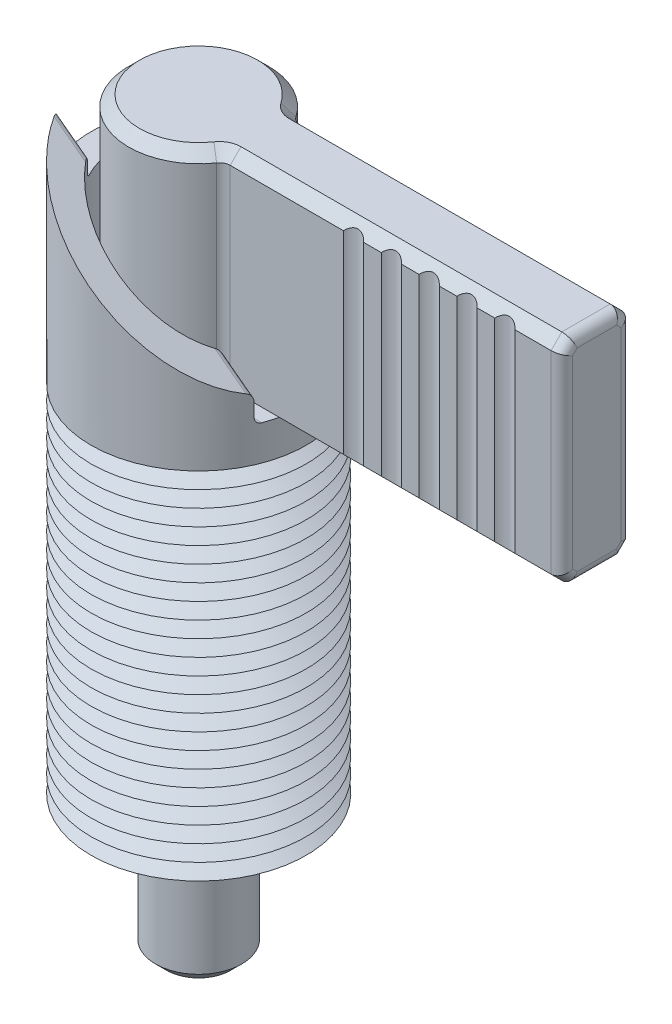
ISO-10303-21;
HEADER;
FILE_DESCRIPTION(('STEP AP214'),'2;1');
FILE_NAME('part.step','',(''),(''),'','','');
FILE_SCHEMA(('AUTOMOTIVE_DESIGN { 1 0 10303 214 1 1 1 1 }'));
ENDSEC;
DATA;
#1=APPLICATION_CONTEXT('core data for automotive mechanical design processes');
#2=APPLICATION_PROTOCOL_DEFINITION('international standard','automotive_design',2000,#1);
#3=PRODUCT_CONTEXT('',#1,'mechanical');
#4=PRODUCT('Part','Part','',(#3));
#5=PRODUCT_RELATED_PRODUCT_CATEGORY('part','',(#4));
#6=PRODUCT_DEFINITION_FORMATION('','',#4);
#7=PRODUCT_DEFINITION_CONTEXT('part definition',#1,'design');
#8=PRODUCT_DEFINITION('design','',#6,#7);
#9=PRODUCT_DEFINITION_SHAPE('','',#8);
#10=(LENGTH_UNIT() NAMED_UNIT(*) SI_UNIT(.MILLI.,.METRE.));
#11=(NAMED_UNIT(*) PLANE_ANGLE_UNIT() SI_UNIT($,.RADIAN.));
#12=(NAMED_UNIT(*) SI_UNIT($,.STERADIAN.) SOLID_ANGLE_UNIT());
#13=UNCERTAINTY_MEASURE_WITH_UNIT(LENGTH_MEASURE(1.E-05),#10,'distance_accuracy_value','');
#14=(GEOMETRIC_REPRESENTATION_CONTEXT(3) GLOBAL_UNCERTAINTY_ASSIGNED_CONTEXT((#13)) GLOBAL_UNIT_ASSIGNED_CONTEXT((#10,
#11,#12)) REPRESENTATION_CONTEXT('',''));
#15=CARTESIAN_POINT('',(0.,0.,0.));
#16=DIRECTION('',(0.,0.,1.));
#17=DIRECTION('',(1.,0.,0.));
#18=AXIS2_PLACEMENT_3D('',#15,#16,#17);
#19=CARTESIAN_POINT('',(5.62916512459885,4.96284530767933,3.25));
#20=DIRECTION('',(0.,0.,1.));
#21=DIRECTION('',(1.,0.,0.));
#22=AXIS2_PLACEMENT_3D('',#19,#20,#21);
#23=PLANE('',#22);
#24=DIRECTION('',(0.,1.,0.));
#25=VECTOR('',#24,1.);
#26=CARTESIAN_POINT('',(18.5915927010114,-12.,3.25));
#27=LINE('',#26,#25);
#28=CARTESIAN_POINT('',(18.5915927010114,38.001,3.25));
#29=VERTEX_POINT('',#28);
#30=CARTESIAN_POINT('',(18.5915927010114,55.999,3.25));
#31=VERTEX_POINT('',#30);
#32=EDGE_CURVE('P0_E200',#29,#31,#27,.T.);
#33=ORIENTED_EDGE('',*,*,#32,.F.);
#34=DIRECTION('',(1.,0.,0.));
#35=VECTOR('',#34,1.);
#36=CARTESIAN_POINT('',(37.,38.001,3.25));
#37=LINE('',#36,#35);
#38=CARTESIAN_POINT('',(20.2214072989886,38.001,3.25));
#39=VERTEX_POINT('',#38);
#40=EDGE_CURVE('P0_E209',#29,#39,#37,.T.);
#41=ORIENTED_EDGE('',*,*,#40,.T.);
#42=DIRECTION('',(0.,1.,0.));
#43=VECTOR('',#42,1.);
#44=CARTESIAN_POINT('',(20.2214072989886,-12.,3.25));
#45=LINE('',#44,#43);
#46=CARTESIAN_POINT('',(20.2214072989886,55.999,3.25));
#47=VERTEX_POINT('',#46);
#48=EDGE_CURVE('P0_E210',#39,#47,#45,.T.);
#49=ORIENTED_EDGE('',*,*,#48,.T.);
#50=DIRECTION('',(-1.,0.,0.));
#51=VECTOR('',#50,1.);
#52=CARTESIAN_POINT('',(6.18012944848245,55.999,3.25));
#53=LINE('',#52,#51);
#54=EDGE_CURVE('P0_E236',#47,#31,#53,.T.);
#55=ORIENTED_EDGE('',*,*,#54,.T.);
#56=EDGE_LOOP('',(#33,#41,#49,#55));
#57=FACE_BOUND('',#56,.T.);
#58=ADVANCED_FACE('P0_F16',(#57),#23,.T.);
#59=DIRECTION('',(0.,1.,0.));
#60=VECTOR('',#59,1.);
#61=CARTESIAN_POINT('',(22.1065927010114,-12.,3.25));
#62=LINE('',#61,#60);
#63=CARTESIAN_POINT('',(22.1065927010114,38.001,3.25));
#64=VERTEX_POINT('',#63);
#65=CARTESIAN_POINT('',(22.1065927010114,55.999,3.25));
#66=VERTEX_POINT('',#65);
#67=EDGE_CURVE('P0_E299',#64,#66,#62,.T.);
#68=ORIENTED_EDGE('',*,*,#67,.F.);
#69=CARTESIAN_POINT('',(23.7364072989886,38.001,3.25));
#70=VERTEX_POINT('',#69);
#71=EDGE_CURVE('P0_E221',#64,#70,#37,.T.);
#72=ORIENTED_EDGE('',*,*,#71,.T.);
#73=DIRECTION('',(0.,1.,0.));
#74=VECTOR('',#73,1.);
#75=CARTESIAN_POINT('',(23.7364072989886,-12.,3.25));
#76=LINE('',#75,#74);
#77=CARTESIAN_POINT('',(23.7364072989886,55.999,3.25));
#78=VERTEX_POINT('',#77);
#79=EDGE_CURVE('P0_E293',#70,#78,#76,.T.);
#80=ORIENTED_EDGE('',*,*,#79,.T.);
#81=EDGE_CURVE('P0_E239',#78,#66,#53,.T.);
#82=ORIENTED_EDGE('',*,*,#81,.T.);
#83=EDGE_LOOP('',(#68,#72,#80,#82));
#84=FACE_BOUND('',#83,.T.);
#85=ADVANCED_FACE('P0_F496',(#84),#23,.T.);
#86=DIRECTION('',(0.,1.,0.));
#87=VECTOR('',#86,1.);
#88=CARTESIAN_POINT('',(25.6215927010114,-12.,3.25));
#89=LINE('',#88,#87);
#90=CARTESIAN_POINT('',(25.6215927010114,38.001,3.25));
#91=VERTEX_POINT('',#90);
#92=CARTESIAN_POINT('',(25.6215927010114,55.999,3.25));
#93=VERTEX_POINT('',#92);
#94=EDGE_CURVE('P0_E292',#91,#93,#89,.T.);
#95=ORIENTED_EDGE('',*,*,#94,.F.);
#96=CARTESIAN_POINT('',(27.2514072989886,38.001,3.25));
#97=VERTEX_POINT('',#96);
#98=EDGE_CURVE('P0_E228',#91,#97,#37,.T.);
#99=ORIENTED_EDGE('',*,*,#98,.T.);
#100=DIRECTION('',(0.,1.,0.));
#101=VECTOR('',#100,1.);
#102=CARTESIAN_POINT('',(27.2514072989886,-12.,3.25));
#103=LINE('',#102,#101);
#104=CARTESIAN_POINT('',(27.2514072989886,55.999,3.25));
#105=VERTEX_POINT('',#104);
#106=EDGE_CURVE('P0_E286',#97,#105,#103,.T.);
#107=ORIENTED_EDGE('',*,*,#106,.T.);
#108=EDGE_CURVE('P0_E234',#105,#93,#53,.T.);
#109=ORIENTED_EDGE('',*,*,#108,.T.);
#110=EDGE_LOOP('',(#95,#99,#107,#109));
#111=FACE_BOUND('',#110,.T.);
#112=ADVANCED_FACE('P0_F324',(#111),#23,.T.);
#113=DIRECTION('',(0.,1.,0.));
#114=VECTOR('',#113,1.);
#115=CARTESIAN_POINT('',(29.1365927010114,-12.,3.25));
#116=LINE('',#115,#114);
#117=CARTESIAN_POINT('',(29.1365927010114,38.001,3.25));
#118=VERTEX_POINT('',#117);
#119=CARTESIAN_POINT('',(29.1365927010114,55.999,3.25));
#120=VERTEX_POINT('',#119);
#121=EDGE_CURVE('P0_E285',#118,#120,#116,.T.);
#122=ORIENTED_EDGE('',*,*,#121,.F.);
#123=CARTESIAN_POINT('',(30.7664072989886,38.001,3.25));
#124=VERTEX_POINT('',#123);
#125=EDGE_CURVE('P0_E223',#118,#124,#37,.T.);
#126=ORIENTED_EDGE('',*,*,#125,.T.);
#127=DIRECTION('',(0.,1.,0.));
#128=VECTOR('',#127,1.);
#129=CARTESIAN_POINT('',(30.7664072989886,-12.,3.25));
#130=LINE('',#129,#128);
#131=CARTESIAN_POINT('',(30.7664072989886,55.999,3.25));
#132=VERTEX_POINT('',#131);
#133=EDGE_CURVE('P0_E279',#124,#132,#130,.T.);
#134=ORIENTED_EDGE('',*,*,#133,.T.);
#135=EDGE_CURVE('P0_E229',#132,#120,#53,.T.);
#136=ORIENTED_EDGE('',*,*,#135,.T.);
#137=EDGE_LOOP('',(#122,#126,#134,#136));
#138=FACE_BOUND('',#137,.T.);
#139=ADVANCED_FACE('P0_F337',(#138),#23,.T.);
#140=CARTESIAN_POINT('',(32.6515927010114,38.001,3.25));
#141=VERTEX_POINT('',#140);
#142=CARTESIAN_POINT('',(35.999,38.001,3.25));
#143=VERTEX_POINT('',#142);
#144=EDGE_CURVE('P0_E218',#141,#143,#37,.T.);
#145=ORIENTED_EDGE('',*,*,#144,.T.);
#146=DIRECTION('',(0.,1.,0.));
#147=VECTOR('',#146,1.);
#148=CARTESIAN_POINT('',(35.999,4.96284530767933,3.25));
#149=LINE('',#148,#147);
#150=CARTESIAN_POINT('',(35.999,55.999,3.25));
#151=VERTEX_POINT('',#150);
#152=EDGE_CURVE('P0_E11',#143,#151,#149,.T.);
#153=ORIENTED_EDGE('',*,*,#152,.T.);
#154=CARTESIAN_POINT('',(32.6515927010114,55.999,3.25));
#155=VERTEX_POINT('',#154);
#156=EDGE_CURVE('P0_E224',#151,#155,#53,.T.);
#157=ORIENTED_EDGE('',*,*,#156,.T.);
#158=DIRECTION('',(0.,1.,0.));
#159=VECTOR('',#158,1.);
#160=CARTESIAN_POINT('',(32.6515927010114,-12.,3.25));
#161=LINE('',#160,#159);
#162=EDGE_CURVE('P0_E278',#141,#155,#161,.T.);
#163=ORIENTED_EDGE('',*,*,#162,.F.);
#164=EDGE_LOOP('',(#145,#153,#157,#163));
#165=FACE_BOUND('',#164,.T.);
#166=ADVANCED_FACE('P0_F506',(#165),#23,.T.);
#167=CARTESIAN_POINT('',(0.,-12.,0.));
#168=DIRECTION('',(0.,1.,0.));
#169=DIRECTION('',(0.,0.,1.));
#170=AXIS2_PLACEMENT_3D('',#167,#168,#169);
#171=PLANE('',#170);
#172=CARTESIAN_POINT('',(0.,-12.,0.));
#173=DIRECTION('',(0.,-1.,0.));
#174=DIRECTION('',(0.,0.,-1.));
#175=AXIS2_PLACEMENT_3D('',#172,#173,#174);
#176=CIRCLE('',#175,3.);
#177=CARTESIAN_POINT('',(0.,-12.,-3.));
#178=VERTEX_POINT('',#177);
#179=EDGE_CURVE('P0_E259',#178,#178,#176,.T.);
#180=ORIENTED_EDGE('',*,*,#179,.T.);
#181=EDGE_LOOP('',(#180));
#182=FACE_BOUND('',#181,.T.);
#183=ADVANCED_FACE('P0_F516',(#182),#171,.F.);
#184=CARTESIAN_POINT('',(0.,-11.,0.));
#185=DIRECTION('',(0.,1.,0.));
#186=DIRECTION('',(0.,0.,1.));
#187=AXIS2_PLACEMENT_3D('',#184,#185,#186);
#188=CONICAL_SURFACE('',#187,4.,0.785398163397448);
#189=ORIENTED_EDGE('',*,*,#179,.F.);
#190=EDGE_LOOP('',(#189));
#191=FACE_BOUND('',#190,.T.);
#192=CARTESIAN_POINT('',(0.,-11.,0.));
#193=DIRECTION('',(0.,-1.,0.));
#194=DIRECTION('',(0.,0.,-1.));
#195=AXIS2_PLACEMENT_3D('',#192,#193,#194);
#196=CIRCLE('',#195,4.);
#197=CARTESIAN_POINT('',(0.,-11.,-4.));
#198=VERTEX_POINT('',#197);
#199=EDGE_CURVE('P0_E262',#198,#198,#196,.T.);
#200=ORIENTED_EDGE('',*,*,#199,.T.);
#201=EDGE_LOOP('',(#200));
#202=FACE_BOUND('',#201,.T.);
#203=ADVANCED_FACE('P0_F521',(#191,#202),#188,.T.);
#204=CARTESIAN_POINT('',(0.,-12.,0.));
#205=DIRECTION('',(0.,-1.,0.));
#206=DIRECTION('',(0.,0.,-1.));
#207=AXIS2_PLACEMENT_3D('',#204,#205,#206);
#208=CYLINDRICAL_SURFACE('',#207,4.);
#209=ORIENTED_EDGE('',*,*,#199,.F.);
#210=EDGE_LOOP('',(#209));
#211=FACE_BOUND('',#210,.T.);
#212=CARTESIAN_POINT('',(0.,9.,0.));
#213=DIRECTION('',(0.,-1.,0.));
#214=DIRECTION('',(0.,0.,-1.));
#215=AXIS2_PLACEMENT_3D('',#212,#213,#214);
#216=CIRCLE('',#215,4.);
#217=CARTESIAN_POINT('',(0.,9.,-4.));
#218=VERTEX_POINT('',#217);
#219=EDGE_CURVE('P0_E265',#218,#218,#216,.T.);
#220=ORIENTED_EDGE('',*,*,#219,.T.);
#221=EDGE_LOOP('',(#220));
#222=FACE_BOUND('',#221,.T.);
#223=ADVANCED_FACE('P0_F555',(#211,#222),#208,.T.);
#224=CARTESIAN_POINT('',(-4.,9.,0.));
#225=DIRECTION('',(0.,-1.,0.));
#226=DIRECTION('',(0.,0.,-1.));
#227=AXIS2_PLACEMENT_3D('',#224,#225,#226);
#228=PLANE('',#227);
#229=ORIENTED_EDGE('',*,*,#219,.F.);
#230=EDGE_LOOP('',(#229));
#231=FACE_BOUND('',#230,.T.);
#232=CARTESIAN_POINT('',(0.,9.,0.));
#233=DIRECTION('',(0.,-1.,0.));
#234=DIRECTION('',(0.,0.,-1.));
#235=AXIS2_PLACEMENT_3D('',#232,#233,#234);
#236=CIRCLE('',#235,3.);
#237=CARTESIAN_POINT('',(0.,9.,-3.));
#238=VERTEX_POINT('',#237);
#239=EDGE_CURVE('P0_E268',#238,#238,#236,.T.);
#240=ORIENTED_EDGE('',*,*,#239,.T.);
#241=EDGE_LOOP('',(#240));
#242=FACE_BOUND('',#241,.T.);
#243=ADVANCED_FACE('P0_F563',(#231,#242),#228,.F.);
#244=CARTESIAN_POINT('',(0.,-12.,0.));
#245=DIRECTION('',(0.,-1.,0.));
#246=DIRECTION('',(0.,0.,-1.));
#247=AXIS2_PLACEMENT_3D('',#244,#245,#246);
#248=CYLINDRICAL_SURFACE('',#247,3.);
#249=ORIENTED_EDGE('',*,*,#239,.F.);
#250=EDGE_LOOP('',(#249));
#251=FACE_BOUND('',#250,.T.);
#252=CARTESIAN_POINT('',(0.,37.,0.));
#253=DIRECTION('',(0.,-1.,0.));
#254=DIRECTION('',(0.,0.,-1.));
#255=AXIS2_PLACEMENT_3D('',#252,#253,#254);
#256=CIRCLE('',#255,3.);
#257=CARTESIAN_POINT('',(0.,37.,-3.));
#258=VERTEX_POINT('',#257);
#259=EDGE_CURVE('P0_E271',#258,#258,#256,.T.);
#260=ORIENTED_EDGE('',*,*,#259,.T.);
#261=EDGE_LOOP('',(#260));
#262=FACE_BOUND('',#261,.T.);
#263=ADVANCED_FACE('P0_F571',(#251,#262),#248,.T.);
#264=CARTESIAN_POINT('',(-3.,37.,0.));
#265=DIRECTION('',(0.,1.,0.));
#266=DIRECTION('',(0.,0.,1.));
#267=AXIS2_PLACEMENT_3D('',#264,#265,#266);
#268=PLANE('',#267);
#269=ORIENTED_EDGE('',*,*,#259,.F.);
#270=EDGE_LOOP('',(#269));
#271=FACE_BOUND('',#270,.T.);
#272=DIRECTION('',(1.,0.,0.));
#273=VECTOR('',#272,1.);
#274=CARTESIAN_POINT('',(37.,37.,-2.24899999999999));
#275=LINE('',#274,#273);
#276=CARTESIAN_POINT('',(6.18012944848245,37.,-2.24899999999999));
#277=VERTEX_POINT('',#276);
#278=CARTESIAN_POINT('',(35.999,37.,-2.24899999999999));
#279=VERTEX_POINT('',#278);
#280=EDGE_CURVE('P0_E247',#277,#279,#275,.T.);
#281=ORIENTED_EDGE('',*,*,#280,.T.);
#282=DIRECTION('',(0.,0.,1.));
#283=VECTOR('',#282,1.);
#284=CARTESIAN_POINT('',(35.999,37.,2.24899999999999));
#285=LINE('',#284,#283);
#286=CARTESIAN_POINT('',(35.999,37.,2.24899999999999));
#287=VERTEX_POINT('',#286);
#288=EDGE_CURVE('P0_E40',#279,#287,#285,.T.);
#289=ORIENTED_EDGE('',*,*,#288,.T.);
#290=DIRECTION('',(-1.,0.,0.));
#291=VECTOR('',#290,1.);
#292=CARTESIAN_POINT('',(6.18012944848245,37.,2.24899999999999));
#293=LINE('',#292,#291);
#294=CARTESIAN_POINT('',(6.18012944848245,37.,2.24899999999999));
#295=VERTEX_POINT('',#294);
#296=EDGE_CURVE('P0_E237',#287,#295,#293,.T.);
#297=ORIENTED_EDGE('',*,*,#296,.T.);
#298=CARTESIAN_POINT('',(6.18012944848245,37.,4.251));
#299=DIRECTION('',(0.,1.,0.));
#300=DIRECTION('',(0.,0.,1.));
#301=AXIS2_PLACEMENT_3D('',#298,#299,#300);
#302=CIRCLE('',#301,2.00200000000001);
#303=CARTESIAN_POINT('',(4.53066682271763,37.,3.11641767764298));
#304=VERTEX_POINT('',#303);
#305=EDGE_CURVE('P0_E240',#295,#304,#302,.T.);
#306=ORIENTED_EDGE('',*,*,#305,.T.);
#307=CARTESIAN_POINT('',(0.,37.,0.));
#308=DIRECTION('',(0.,1.,0.));
#309=DIRECTION('',(0.,0.,1.));
#310=AXIS2_PLACEMENT_3D('',#307,#308,#309);
#311=CIRCLE('',#310,5.49899999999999);
#312=CARTESIAN_POINT('',(4.53066682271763,37.,-3.11641767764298));
#313=VERTEX_POINT('',#312);
#314=EDGE_CURVE('P0_E241',#304,#313,#311,.F.);
#315=ORIENTED_EDGE('',*,*,#314,.T.);
#316=CARTESIAN_POINT('',(6.18012944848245,37.,-4.251));
#317=DIRECTION('',(0.,1.,0.));
#318=DIRECTION('',(0.,0.,1.));
#319=AXIS2_PLACEMENT_3D('',#316,#317,#318);
#320=CIRCLE('',#319,2.00200000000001);
#321=EDGE_CURVE('P0_E245',#313,#277,#320,.T.);
#322=ORIENTED_EDGE('',*,*,#321,.T.);
#323=EDGE_LOOP('',(#281,#289,#297,#306,#315,#322));
#324=FACE_BOUND('',#323,.T.);
#325=ADVANCED_FACE('P0_F422',(#271,#324),#268,.F.);
#326=CARTESIAN_POINT('',(0.,-12.,0.));
#327=DIRECTION('',(0.,-1.,0.));
#328=DIRECTION('',(0.,0.,-1.));
#329=AXIS2_PLACEMENT_3D('',#326,#327,#328);
#330=CYLINDRICAL_SURFACE('',#329,6.5);
#331=DIRECTION('',(0.,-1.,0.));
#332=VECTOR('',#331,1.);
#333=CARTESIAN_POINT('',(5.35539813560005,-12.,-3.68370883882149));
#334=LINE('',#333,#332);
#335=CARTESIAN_POINT('',(5.35539813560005,55.999,-3.68370883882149));
#336=VERTEX_POINT('',#335);
#337=CARTESIAN_POINT('',(5.35539813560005,38.001,-3.68370883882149));
#338=VERTEX_POINT('',#337);
#339=EDGE_CURVE('P0_E250',#336,#338,#334,.T.);
#340=ORIENTED_EDGE('',*,*,#339,.T.);
#341=CARTESIAN_POINT('',(0.,38.001,0.));
#342=DIRECTION('',(0.,1.,0.));
#343=DIRECTION('',(0.,0.,1.));
#344=AXIS2_PLACEMENT_3D('',#341,#342,#343);
#345=CIRCLE('',#344,6.5);
#346=CARTESIAN_POINT('',(5.35539813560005,38.001,3.68370883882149));
#347=VERTEX_POINT('',#346);
#348=EDGE_CURVE('P0_E436',#338,#347,#345,.T.);
#349=ORIENTED_EDGE('',*,*,#348,.T.);
#350=DIRECTION('',(0.,-1.,0.));
#351=VECTOR('',#350,1.);
#352=CARTESIAN_POINT('',(5.35539813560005,-12.,3.68370883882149));
#353=LINE('',#352,#351);
#354=CARTESIAN_POINT('',(5.35539813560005,55.999,3.68370883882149));
#355=VERTEX_POINT('',#354);
#356=EDGE_CURVE('P0_E253',#347,#355,#353,.F.);
#357=ORIENTED_EDGE('',*,*,#356,.T.);
#358=CARTESIAN_POINT('',(0.,55.999,0.));
#359=DIRECTION('',(0.,-1.,0.));
#360=DIRECTION('',(0.,0.,-1.));
#361=AXIS2_PLACEMENT_3D('',#358,#359,#360);
#362=CIRCLE('',#361,6.5);
#363=EDGE_CURVE('P0_E476',#355,#336,#362,.T.);
#364=ORIENTED_EDGE('',*,*,#363,.T.);
#365=EDGE_LOOP('',(#340,#349,#357,#364));
#366=FACE_BOUND('',#365,.T.);
#367=ADVANCED_FACE('P0_F586',(#366),#330,.T.);
#368=CARTESIAN_POINT('',(-6.5,57.,0.));
#369=DIRECTION('',(0.,-1.,0.));
#370=DIRECTION('',(0.,0.,-1.));
#371=AXIS2_PLACEMENT_3D('',#368,#369,#370);
#372=PLANE('',#371);
#373=DIRECTION('',(1.,0.,0.));
#374=VECTOR('',#373,1.);
#375=CARTESIAN_POINT('',(37.,57.,2.24899999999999));
#376=LINE('',#375,#374);
#377=CARTESIAN_POINT('',(6.18012944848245,57.,2.24899999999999));
#378=VERTEX_POINT('',#377);
#379=CARTESIAN_POINT('',(35.999,57.,2.24899999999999));
#380=VERTEX_POINT('',#379);
#381=EDGE_CURVE('P0_E343',#378,#380,#376,.T.);
#382=ORIENTED_EDGE('',*,*,#381,.T.);
#383=DIRECTION('',(0.,0.,-1.));
#384=VECTOR('',#383,1.);
#385=CARTESIAN_POINT('',(35.999,57.,-2.249));
#386=LINE('',#385,#384);
#387=CARTESIAN_POINT('',(35.999,57.,-2.24899999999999));
#388=VERTEX_POINT('',#387);
#389=EDGE_CURVE('P0_E375',#380,#388,#386,.T.);
#390=ORIENTED_EDGE('',*,*,#389,.T.);
#391=DIRECTION('',(-1.,0.,0.));
#392=VECTOR('',#391,1.);
#393=CARTESIAN_POINT('',(6.18012944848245,57.,-2.24899999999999));
#394=LINE('',#393,#392);
#395=CARTESIAN_POINT('',(6.18012944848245,57.,-2.24899999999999));
#396=VERTEX_POINT('',#395);
#397=EDGE_CURVE('P0_E465',#388,#396,#394,.T.);
#398=ORIENTED_EDGE('',*,*,#397,.T.);
#399=CARTESIAN_POINT('',(6.18012944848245,57.,-4.251));
#400=DIRECTION('',(0.,-1.,0.));
#401=DIRECTION('',(0.,0.,-1.));
#402=AXIS2_PLACEMENT_3D('',#399,#400,#401);
#403=CIRCLE('',#402,2.00200000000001);
#404=CARTESIAN_POINT('',(4.53066682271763,57.,-3.11641767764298));
#405=VERTEX_POINT('',#404);
#406=EDGE_CURVE('P0_E463',#396,#405,#403,.T.);
#407=ORIENTED_EDGE('',*,*,#406,.T.);
#408=CARTESIAN_POINT('',(0.,57.,0.));
#409=DIRECTION('',(0.,-1.,0.));
#410=DIRECTION('',(0.,0.,-1.));
#411=AXIS2_PLACEMENT_3D('',#408,#409,#410);
#412=CIRCLE('',#411,5.49899999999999);
#413=CARTESIAN_POINT('',(4.53066682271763,57.,3.11641767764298));
#414=VERTEX_POINT('',#413);
#415=EDGE_CURVE('P0_E461',#405,#414,#412,.F.);
#416=ORIENTED_EDGE('',*,*,#415,.T.);
#417=CARTESIAN_POINT('',(6.18012944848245,57.,4.251));
#418=DIRECTION('',(0.,-1.,0.));
#419=DIRECTION('',(0.,0.,-1.));
#420=AXIS2_PLACEMENT_3D('',#417,#418,#419);
#421=CIRCLE('',#420,2.00200000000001);
#422=EDGE_CURVE('P0_E348',#414,#378,#421,.T.);
#423=ORIENTED_EDGE('',*,*,#422,.T.);
#424=EDGE_LOOP('',(#382,#390,#398,#407,#416,#423));
#425=FACE_BOUND('',#424,.T.);
#426=ADVANCED_FACE('P0_F594',(#425),#372,.F.);
#427=CARTESIAN_POINT('',(5.62916512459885,4.96284530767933,-3.25));
#428=DIRECTION('',(0.,0.,-1.));
#429=DIRECTION('',(-1.,0.,0.));
#430=AXIS2_PLACEMENT_3D('',#427,#428,#429);
#431=PLANE('',#430);
#432=DIRECTION('',(1.,0.,0.));
#433=VECTOR('',#432,1.);
#434=CARTESIAN_POINT('',(37.,55.999,-3.25));
#435=LINE('',#434,#433);
#436=CARTESIAN_POINT('',(6.18012944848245,55.999,-3.25));
#437=VERTEX_POINT('',#436);
#438=CARTESIAN_POINT('',(35.999,55.999,-3.25));
#439=VERTEX_POINT('',#438);
#440=EDGE_CURVE('P0_E468',#437,#439,#435,.T.);
#441=ORIENTED_EDGE('',*,*,#440,.T.);
#442=DIRECTION('',(0.,1.,0.));
#443=VECTOR('',#442,1.);
#444=CARTESIAN_POINT('',(35.999,4.96284530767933,-3.25));
#445=LINE('',#444,#443);
#446=CARTESIAN_POINT('',(35.999,38.001,-3.25));
#447=VERTEX_POINT('',#446);
#448=EDGE_CURVE('P0_E379',#439,#447,#445,.F.);
#449=ORIENTED_EDGE('',*,*,#448,.T.);
#450=DIRECTION('',(-1.,0.,0.));
#451=VECTOR('',#450,1.);
#452=CARTESIAN_POINT('',(6.18012944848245,38.001,-3.25));
#453=LINE('',#452,#451);
#454=CARTESIAN_POINT('',(6.18012944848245,38.001,-3.25));
#455=VERTEX_POINT('',#454);
#456=EDGE_CURVE('P0_E421',#447,#455,#453,.T.);
#457=ORIENTED_EDGE('',*,*,#456,.T.);
#458=DIRECTION('',(0.,-1.,0.));
#459=VECTOR('',#458,1.);
#460=CARTESIAN_POINT('',(6.18012944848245,4.96284530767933,-3.25));
#461=LINE('',#460,#459);
#462=EDGE_CURVE('P0_E256',#455,#437,#461,.F.);
#463=ORIENTED_EDGE('',*,*,#462,.T.);
#464=EDGE_LOOP('',(#441,#449,#457,#463));
#465=FACE_BOUND('',#464,.T.);
#466=ADVANCED_FACE('P0_F513',(#465),#431,.T.);
#467=CARTESIAN_POINT('',(37.,4.96284530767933,3.25));
#468=DIRECTION('',(1.,0.,0.));
#469=DIRECTION('',(0.,0.,-1.));
#470=AXIS2_PLACEMENT_3D('',#467,#468,#469);
#471=PLANE('',#470);
#472=DIRECTION('',(0.,0.,-1.));
#473=VECTOR('',#472,1.);
#474=CARTESIAN_POINT('',(37.,55.999,2.24899999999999));
#475=LINE('',#474,#473);
#476=CARTESIAN_POINT('',(37.,55.999,-1.83437222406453));
#477=VERTEX_POINT('',#476);
#478=CARTESIAN_POINT('',(37.,55.999,1.83437222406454));
#479=VERTEX_POINT('',#478);
#480=EDGE_CURVE('P0_E367',#477,#479,#475,.F.);
#481=ORIENTED_EDGE('',*,*,#480,.T.);
#482=DIRECTION('',(0.,-0.70710678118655,0.707106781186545));
#483=VECTOR('',#482,1.);
#484=CARTESIAN_POINT('',(37.,29.7731087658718,28.0602634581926));
#485=LINE('',#484,#483);
#486=CARTESIAN_POINT('',(37.,55.5843722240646,2.249));
#487=VERTEX_POINT('',#486);
#488=EDGE_CURVE('P0_E369',#479,#487,#485,.T.);
#489=ORIENTED_EDGE('',*,*,#488,.T.);
#490=DIRECTION('',(0.,1.,0.));
#491=VECTOR('',#490,1.);
#492=CARTESIAN_POINT('',(37.,4.96284530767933,2.249));
#493=LINE('',#492,#491);
#494=CARTESIAN_POINT('',(37.,38.4156277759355,2.249));
#495=VERTEX_POINT('',#494);
#496=EDGE_CURVE('P0_E309',#487,#495,#493,.F.);
#497=ORIENTED_EDGE('',*,*,#496,.T.);
#498=DIRECTION('',(0.,-0.70710678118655,-0.707106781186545));
#499=VECTOR('',#498,1.);
#500=CARTESIAN_POINT('',(37.,22.1897365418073,-13.9768912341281));
#501=LINE('',#500,#499);
#502=CARTESIAN_POINT('',(37.,38.001,1.83437222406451));
#503=VERTEX_POINT('',#502);
#504=EDGE_CURVE('P0_E357',#495,#503,#501,.T.);
#505=ORIENTED_EDGE('',*,*,#504,.T.);
#506=DIRECTION('',(0.,0.,1.));
#507=VECTOR('',#506,1.);
#508=CARTESIAN_POINT('',(37.,38.001,-2.24899999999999));
#509=LINE('',#508,#507);
#510=CARTESIAN_POINT('',(37.,38.001,-1.83437222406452));
#511=VERTEX_POINT('',#510);
#512=EDGE_CURVE('P0_E359',#503,#511,#509,.F.);
#513=ORIENTED_EDGE('',*,*,#512,.T.);
#514=DIRECTION('',(0.,0.70710678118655,-0.707106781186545));
#515=VECTOR('',#514,1.);
#516=CARTESIAN_POINT('',(37.,18.9397365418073,17.2268912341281));
#517=LINE('',#516,#515);
#518=CARTESIAN_POINT('',(37.,38.4156277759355,-2.249));
#519=VERTEX_POINT('',#518);
#520=EDGE_CURVE('P0_E361',#511,#519,#517,.T.);
#521=ORIENTED_EDGE('',*,*,#520,.T.);
#522=DIRECTION('',(0.,1.,0.));
#523=VECTOR('',#522,1.);
#524=CARTESIAN_POINT('',(37.,4.96284530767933,-2.249));
#525=LINE('',#524,#523);
#526=CARTESIAN_POINT('',(37.,55.5843722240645,-2.249));
#527=VERTEX_POINT('',#526);
#528=EDGE_CURVE('P0_E363',#519,#527,#525,.T.);
#529=ORIENTED_EDGE('',*,*,#528,.T.);
#530=DIRECTION('',(0.,0.70710678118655,0.707106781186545));
#531=VECTOR('',#530,1.);
#532=CARTESIAN_POINT('',(37.,33.0231087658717,-24.8102634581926));
#533=LINE('',#532,#531);
#534=EDGE_CURVE('P0_E365',#527,#477,#533,.T.);
#535=ORIENTED_EDGE('',*,*,#534,.T.);
#536=EDGE_LOOP('',(#481,#489,#497,#505,#513,#521,#529,#535));
#537=FACE_BOUND('',#536,.T.);
#538=ADVANCED_FACE('P0_F505',(#537),#471,.T.);
#539=DIRECTION('',(0.,1.,0.));
#540=VECTOR('',#539,1.);
#541=CARTESIAN_POINT('',(16.7064072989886,-12.,3.25));
#542=LINE('',#541,#540);
#543=CARTESIAN_POINT('',(16.7064072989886,38.001,3.25));
#544=VERTEX_POINT('',#543);
#545=CARTESIAN_POINT('',(16.7064072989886,55.999,3.25));
#546=VERTEX_POINT('',#545);
#547=EDGE_CURVE('P0_E190',#544,#546,#542,.T.);
#548=ORIENTED_EDGE('',*,*,#547,.T.);
#549=CARTESIAN_POINT('',(6.18012944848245,55.999,3.25));
#550=VERTEX_POINT('',#549);
#551=EDGE_CURVE('P0_E230',#546,#550,#53,.T.);
#552=ORIENTED_EDGE('',*,*,#551,.T.);
#553=DIRECTION('',(0.,-1.,0.));
#554=VECTOR('',#553,1.);
#555=CARTESIAN_POINT('',(6.18012944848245,4.96284530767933,3.25));
#556=LINE('',#555,#554);
#557=CARTESIAN_POINT('',(6.18012944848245,38.001,3.25));
#558=VERTEX_POINT('',#557);
#559=EDGE_CURVE('P0_E215',#550,#558,#556,.T.);
#560=ORIENTED_EDGE('',*,*,#559,.T.);
#561=EDGE_CURVE('P0_E206',#558,#544,#37,.T.);
#562=ORIENTED_EDGE('',*,*,#561,.T.);
#563=EDGE_LOOP('',(#548,#552,#560,#562));
#564=FACE_BOUND('',#563,.T.);
#565=ADVANCED_FACE('P0_F213',(#564),#23,.T.);
#566=CARTESIAN_POINT('',(6.18012944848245,-12.,-4.251));
#567=DIRECTION('',(0.,-1.,0.));
#568=DIRECTION('',(0.,0.,-1.));
#569=AXIS2_PLACEMENT_3D('',#566,#567,#568);
#570=CYLINDRICAL_SURFACE('',#569,1.001);
#571=ORIENTED_EDGE('',*,*,#462,.F.);
#572=CARTESIAN_POINT('',(6.18012944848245,38.001,-4.251));
#573=DIRECTION('',(0.,1.,0.));
#574=DIRECTION('',(0.,0.,1.));
#575=AXIS2_PLACEMENT_3D('',#572,#573,#574);
#576=CIRCLE('',#575,1.001);
#577=EDGE_CURVE('P0_E471',#455,#338,#576,.F.);
#578=ORIENTED_EDGE('',*,*,#577,.T.);
#579=ORIENTED_EDGE('',*,*,#339,.F.);
#580=CARTESIAN_POINT('',(6.18012944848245,55.999,-4.251));
#581=DIRECTION('',(0.,-1.,0.));
#582=DIRECTION('',(0.,0.,-1.));
#583=AXIS2_PLACEMENT_3D('',#580,#581,#582);
#584=CIRCLE('',#583,1.001);
#585=EDGE_CURVE('P0_E473',#336,#437,#584,.F.);
#586=ORIENTED_EDGE('',*,*,#585,.T.);
#587=EDGE_LOOP('',(#571,#578,#579,#586));
#588=FACE_BOUND('',#587,.T.);
#589=ADVANCED_FACE('P0_F504',(#588),#570,.F.);
#590=CARTESIAN_POINT('',(6.18012944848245,-12.,4.251));
#591=DIRECTION('',(0.,-1.,0.));
#592=DIRECTION('',(0.,0.,-1.));
#593=AXIS2_PLACEMENT_3D('',#590,#591,#592);
#594=CYLINDRICAL_SURFACE('',#593,1.001);
#595=ORIENTED_EDGE('',*,*,#356,.F.);
#596=CARTESIAN_POINT('',(6.18012944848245,38.001,4.251));
#597=DIRECTION('',(0.,1.,0.));
#598=DIRECTION('',(0.,0.,1.));
#599=AXIS2_PLACEMENT_3D('',#596,#597,#598);
#600=CIRCLE('',#599,1.001);
#601=EDGE_CURVE('P0_E219',#347,#558,#600,.F.);
#602=ORIENTED_EDGE('',*,*,#601,.T.);
#603=ORIENTED_EDGE('',*,*,#559,.F.);
#604=CARTESIAN_POINT('',(6.18012944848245,55.999,4.251));
#605=DIRECTION('',(0.,-1.,0.));
#606=DIRECTION('',(0.,0.,-1.));
#607=AXIS2_PLACEMENT_3D('',#604,#605,#606);
#608=CIRCLE('',#607,1.001);
#609=EDGE_CURVE('P0_E216',#550,#355,#608,.F.);
#610=ORIENTED_EDGE('',*,*,#609,.T.);
#611=EDGE_LOOP('',(#595,#602,#603,#610));
#612=FACE_BOUND('',#611,.T.);
#613=ADVANCED_FACE('P0_F481',(#612),#594,.F.);
#614=CARTESIAN_POINT('',(-3.,37.,-2.24899999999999));
#615=DIRECTION('',(0.,-0.707106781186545,-0.70710678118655));
#616=DIRECTION('',(0.,0.70710678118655,-0.707106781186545));
#617=AXIS2_PLACEMENT_3D('',#614,#615,#616);
#618=PLANE('',#617);
#619=ORIENTED_EDGE('',*,*,#456,.F.);
#620=DIRECTION('',(0.,0.70710678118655,-0.707106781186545));
#621=VECTOR('',#620,1.);
#622=CARTESIAN_POINT('',(35.999,37.,-2.24899999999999));
#623=LINE('',#622,#621);
#624=EDGE_CURVE('P0_E381',#447,#279,#623,.F.);
#625=ORIENTED_EDGE('',*,*,#624,.T.);
#626=ORIENTED_EDGE('',*,*,#280,.F.);
#627=DIRECTION('',(0.,-0.70710678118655,0.707106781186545));
#628=VECTOR('',#627,1.);
#629=CARTESIAN_POINT('',(6.18012944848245,38.001,-3.25));
#630=LINE('',#629,#628);
#631=EDGE_CURVE('P0_E274',#455,#277,#630,.T.);
#632=ORIENTED_EDGE('',*,*,#631,.F.);
#633=EDGE_LOOP('',(#619,#625,#626,#632));
#634=FACE_BOUND('',#633,.T.);
#635=ADVANCED_FACE('P0_F418',(#634),#618,.T.);
#636=CARTESIAN_POINT('',(6.18012944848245,37.,-4.251));
#637=DIRECTION('',(0.,-1.,0.));
#638=DIRECTION('',(0.,0.,-1.));
#639=AXIS2_PLACEMENT_3D('',#636,#637,#638);
#640=CONICAL_SURFACE('',#639,2.00200000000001,0.785398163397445);
#641=ORIENTED_EDGE('',*,*,#631,.T.);
#642=ORIENTED_EDGE('',*,*,#321,.F.);
#643=DIRECTION('',(-0.58259051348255,-0.70710678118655,0.400734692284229));
#644=VECTOR('',#643,1.);
#645=CARTESIAN_POINT('',(5.35539813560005,38.001,-3.68370883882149));
#646=LINE('',#645,#644);
#647=EDGE_CURVE('P0_E430',#338,#313,#646,.T.);
#648=ORIENTED_EDGE('',*,*,#647,.F.);
#649=ORIENTED_EDGE('',*,*,#577,.F.);
#650=EDGE_LOOP('',(#641,#642,#648,#649));
#651=FACE_BOUND('',#650,.T.);
#652=ADVANCED_FACE('P0_F428',(#651),#640,.F.);
#653=CARTESIAN_POINT('',(0.,37.,0.));
#654=DIRECTION('',(0.,1.,0.));
#655=DIRECTION('',(0.,0.,1.));
#656=AXIS2_PLACEMENT_3D('',#653,#654,#655);
#657=CONICAL_SURFACE('',#656,5.49899999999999,0.785398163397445);
#658=ORIENTED_EDGE('',*,*,#647,.T.);
#659=ORIENTED_EDGE('',*,*,#314,.F.);
#660=DIRECTION('',(-0.58259051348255,-0.70710678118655,-0.400734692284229));
#661=VECTOR('',#660,1.);
#662=CARTESIAN_POINT('',(5.35539813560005,38.001,3.68370883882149));
#663=LINE('',#662,#661);
#664=EDGE_CURVE('P0_E437',#347,#304,#663,.T.);
#665=ORIENTED_EDGE('',*,*,#664,.F.);
#666=ORIENTED_EDGE('',*,*,#348,.F.);
#667=EDGE_LOOP('',(#658,#659,#665,#666));
#668=FACE_BOUND('',#667,.T.);
#669=ADVANCED_FACE('P0_F433',(#668),#657,.T.);
#670=CARTESIAN_POINT('',(6.18012944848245,37.,4.251));
#671=DIRECTION('',(0.,-1.,0.));
#672=DIRECTION('',(0.,0.,-1.));
#673=AXIS2_PLACEMENT_3D('',#670,#671,#672);
#674=CONICAL_SURFACE('',#673,2.00200000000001,0.785398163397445);
#675=ORIENTED_EDGE('',*,*,#664,.T.);
#676=ORIENTED_EDGE('',*,*,#305,.F.);
#677=DIRECTION('',(0.,-0.70710678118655,-0.707106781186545));
#678=VECTOR('',#677,1.);
#679=CARTESIAN_POINT('',(6.18012944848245,38.001,3.25));
#680=LINE('',#679,#678);
#681=EDGE_CURVE('P0_E440',#558,#295,#680,.T.);
#682=ORIENTED_EDGE('',*,*,#681,.F.);
#683=ORIENTED_EDGE('',*,*,#601,.F.);
#684=EDGE_LOOP('',(#675,#676,#682,#683));
#685=FACE_BOUND('',#684,.T.);
#686=ADVANCED_FACE('P0_F484',(#685),#674,.F.);
#687=CARTESIAN_POINT('',(-3.,37.,2.24899999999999));
#688=DIRECTION('',(0.,-0.707106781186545,0.70710678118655));
#689=DIRECTION('',(0.,-0.70710678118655,-0.707106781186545));
#690=AXIS2_PLACEMENT_3D('',#687,#688,#689);
#691=PLANE('',#690);
#692=ORIENTED_EDGE('',*,*,#296,.F.);
#693=DIRECTION('',(0.,-0.70710678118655,-0.707106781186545));
#694=VECTOR('',#693,1.);
#695=CARTESIAN_POINT('',(35.999,37.,2.24899999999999));
#696=LINE('',#695,#694);
#697=EDGE_CURVE('P0_E25',#287,#143,#696,.F.);
#698=ORIENTED_EDGE('',*,*,#697,.T.);
#699=ORIENTED_EDGE('',*,*,#144,.F.);
#700=CARTESIAN_POINT('',(31.709,38.889,4.138));
#701=DIRECTION('',(0.,-0.707106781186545,0.70710678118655));
#702=DIRECTION('',(0.,0.70710678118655,0.707106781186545));
#703=AXIS2_PLACEMENT_3D('',#700,#701,#702);
#704=ELLIPSE('',#703,1.83140656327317,1.295);
#705=EDGE_CURVE('P0_E275',#124,#141,#704,.T.);
#706=ORIENTED_EDGE('',*,*,#705,.F.);
#707=ORIENTED_EDGE('',*,*,#125,.F.);
#708=CARTESIAN_POINT('',(28.194,38.889,4.138));
#709=DIRECTION('',(0.,-0.707106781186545,0.70710678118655));
#710=DIRECTION('',(0.,0.70710678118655,0.707106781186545));
#711=AXIS2_PLACEMENT_3D('',#708,#709,#710);
#712=ELLIPSE('',#711,1.83140656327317,1.295);
#713=EDGE_CURVE('P0_E282',#97,#118,#712,.T.);
#714=ORIENTED_EDGE('',*,*,#713,.F.);
#715=ORIENTED_EDGE('',*,*,#98,.F.);
#716=CARTESIAN_POINT('',(24.679,38.889,4.138));
#717=DIRECTION('',(0.,-0.707106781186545,0.70710678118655));
#718=DIRECTION('',(0.,0.70710678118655,0.707106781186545));
#719=AXIS2_PLACEMENT_3D('',#716,#717,#718);
#720=ELLIPSE('',#719,1.83140656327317,1.295);
#721=EDGE_CURVE('P0_E289',#70,#91,#720,.T.);
#722=ORIENTED_EDGE('',*,*,#721,.F.);
#723=ORIENTED_EDGE('',*,*,#71,.F.);
#724=CARTESIAN_POINT('',(21.164,38.889,4.138));
#725=DIRECTION('',(0.,-0.707106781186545,0.70710678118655));
#726=DIRECTION('',(0.,0.70710678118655,0.707106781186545));
#727=AXIS2_PLACEMENT_3D('',#724,#725,#726);
#728=ELLIPSE('',#727,1.83140656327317,1.295);
#729=EDGE_CURVE('P0_E296',#39,#64,#728,.T.);
#730=ORIENTED_EDGE('',*,*,#729,.F.);
#731=ORIENTED_EDGE('',*,*,#40,.F.);
#732=CARTESIAN_POINT('',(17.649,38.889,4.138));
#733=DIRECTION('',(0.,-0.707106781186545,0.70710678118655));
#734=DIRECTION('',(0.,0.70710678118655,0.707106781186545));
#735=AXIS2_PLACEMENT_3D('',#732,#733,#734);
#736=ELLIPSE('',#735,1.83140656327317,1.295);
#737=EDGE_CURVE('P0_E193',#544,#29,#736,.T.);
#738=ORIENTED_EDGE('',*,*,#737,.F.);
#739=ORIENTED_EDGE('',*,*,#561,.F.);
#740=ORIENTED_EDGE('',*,*,#681,.T.);
#741=EDGE_LOOP('',(#692,#698,#699,#706,#707,#714,#715,#722,#723,#730,#731,#738,#739,#740));
#742=FACE_BOUND('',#741,.T.);
#743=ADVANCED_FACE('P0_F204',(#742),#691,.T.);
#744=CARTESIAN_POINT('',(-6.5,57.,-2.24899999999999));
#745=DIRECTION('',(0.,0.707106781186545,-0.70710678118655));
#746=DIRECTION('',(0.,0.70710678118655,0.707106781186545));
#747=AXIS2_PLACEMENT_3D('',#744,#745,#746);
#748=PLANE('',#747);
#749=ORIENTED_EDGE('',*,*,#397,.F.);
#750=DIRECTION('',(0.,0.70710678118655,0.707106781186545));
#751=VECTOR('',#750,1.);
#752=CARTESIAN_POINT('',(35.999,57.,-2.24899999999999));
#753=LINE('',#752,#751);
#754=EDGE_CURVE('P0_E377',#388,#439,#753,.F.);
#755=ORIENTED_EDGE('',*,*,#754,.T.);
#756=ORIENTED_EDGE('',*,*,#440,.F.);
#757=DIRECTION('',(0.,-0.70710678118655,-0.707106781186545));
#758=VECTOR('',#757,1.);
#759=CARTESIAN_POINT('',(6.18012944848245,57.,-2.24899999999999));
#760=LINE('',#759,#758);
#761=EDGE_CURVE('P0_E351',#396,#437,#760,.T.);
#762=ORIENTED_EDGE('',*,*,#761,.F.);
#763=EDGE_LOOP('',(#749,#755,#756,#762));
#764=FACE_BOUND('',#763,.T.);
#765=ADVANCED_FACE('P0_F492',(#764),#748,.T.);
#766=CARTESIAN_POINT('',(6.18012944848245,57.,-4.251));
#767=DIRECTION('',(0.,1.,0.));
#768=DIRECTION('',(0.,0.,1.));
#769=AXIS2_PLACEMENT_3D('',#766,#767,#768);
#770=CONICAL_SURFACE('',#769,2.00200000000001,0.785398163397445);
#771=ORIENTED_EDGE('',*,*,#761,.T.);
#772=ORIENTED_EDGE('',*,*,#585,.F.);
#773=DIRECTION('',(0.58259051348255,-0.70710678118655,-0.400734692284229));
#774=VECTOR('',#773,1.);
#775=CARTESIAN_POINT('',(4.53066682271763,57.,-3.11641767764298));
#776=LINE('',#775,#774);
#777=EDGE_CURVE('P0_E447',#405,#336,#776,.T.);
#778=ORIENTED_EDGE('',*,*,#777,.F.);
#779=ORIENTED_EDGE('',*,*,#406,.F.);
#780=EDGE_LOOP('',(#771,#772,#778,#779));
#781=FACE_BOUND('',#780,.T.);
#782=ADVANCED_FACE('P0_F653',(#781),#770,.F.);
#783=CARTESIAN_POINT('',(0.,55.999,0.));
#784=DIRECTION('',(0.,-1.,0.));
#785=DIRECTION('',(0.,0.,-1.));
#786=AXIS2_PLACEMENT_3D('',#783,#784,#785);
#787=CONICAL_SURFACE('',#786,6.5,0.785398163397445);
#788=ORIENTED_EDGE('',*,*,#777,.T.);
#789=ORIENTED_EDGE('',*,*,#363,.F.);
#790=DIRECTION('',(0.58259051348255,-0.70710678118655,0.400734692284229));
#791=VECTOR('',#790,1.);
#792=CARTESIAN_POINT('',(4.53066682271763,57.,3.11641767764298));
#793=LINE('',#792,#791);
#794=EDGE_CURVE('P0_E445',#414,#355,#793,.T.);
#795=ORIENTED_EDGE('',*,*,#794,.F.);
#796=ORIENTED_EDGE('',*,*,#415,.F.);
#797=EDGE_LOOP('',(#788,#789,#795,#796));
#798=FACE_BOUND('',#797,.T.);
#799=ADVANCED_FACE('P0_F661',(#798),#787,.T.);
#800=CARTESIAN_POINT('',(6.18012944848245,57.,4.251));
#801=DIRECTION('',(0.,1.,0.));
#802=DIRECTION('',(0.,0.,1.));
#803=AXIS2_PLACEMENT_3D('',#800,#801,#802);
#804=CONICAL_SURFACE('',#803,2.00200000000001,0.785398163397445);
#805=ORIENTED_EDGE('',*,*,#794,.T.);
#806=ORIENTED_EDGE('',*,*,#609,.F.);
#807=DIRECTION('',(0.,-0.70710678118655,0.707106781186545));
#808=VECTOR('',#807,1.);
#809=CARTESIAN_POINT('',(6.18012944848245,57.,2.24899999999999));
#810=LINE('',#809,#808);
#811=EDGE_CURVE('P0_E277',#378,#550,#810,.T.);
#812=ORIENTED_EDGE('',*,*,#811,.F.);
#813=ORIENTED_EDGE('',*,*,#422,.F.);
#814=EDGE_LOOP('',(#805,#806,#812,#813));
#815=FACE_BOUND('',#814,.T.);
#816=ADVANCED_FACE('P0_F668',(#815),#804,.F.);
#817=CARTESIAN_POINT('',(-6.5,57.,2.24899999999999));
#818=DIRECTION('',(0.,0.707106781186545,0.70710678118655));
#819=DIRECTION('',(0.,-0.70710678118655,0.707106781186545));
#820=AXIS2_PLACEMENT_3D('',#817,#818,#819);
#821=PLANE('',#820);
#822=ORIENTED_EDGE('',*,*,#156,.F.);
#823=DIRECTION('',(0.,-0.70710678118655,0.707106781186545));
#824=VECTOR('',#823,1.);
#825=CARTESIAN_POINT('',(35.999,57.,2.24899999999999));
#826=LINE('',#825,#824);
#827=EDGE_CURVE('P0_E372',#151,#380,#826,.F.);
#828=ORIENTED_EDGE('',*,*,#827,.T.);
#829=ORIENTED_EDGE('',*,*,#381,.F.);
#830=ORIENTED_EDGE('',*,*,#811,.T.);
#831=ORIENTED_EDGE('',*,*,#551,.F.);
#832=CARTESIAN_POINT('',(17.649,55.111,4.138));
#833=DIRECTION('',(0.,0.707106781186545,0.70710678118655));
#834=DIRECTION('',(0.,0.70710678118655,-0.707106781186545));
#835=AXIS2_PLACEMENT_3D('',#832,#833,#834);
#836=ELLIPSE('',#835,1.83140656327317,1.295);
#837=EDGE_CURVE('P0_E196',#31,#546,#836,.T.);
#838=ORIENTED_EDGE('',*,*,#837,.F.);
#839=ORIENTED_EDGE('',*,*,#54,.F.);
#840=CARTESIAN_POINT('',(21.164,55.111,4.138));
#841=DIRECTION('',(0.,0.707106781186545,0.70710678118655));
#842=DIRECTION('',(0.,0.70710678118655,-0.707106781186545));
#843=AXIS2_PLACEMENT_3D('',#840,#841,#842);
#844=ELLIPSE('',#843,1.83140656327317,1.295);
#845=EDGE_CURVE('P0_E310',#66,#47,#844,.T.);
#846=ORIENTED_EDGE('',*,*,#845,.F.);
#847=ORIENTED_EDGE('',*,*,#81,.F.);
#848=CARTESIAN_POINT('',(24.679,55.111,4.138));
#849=DIRECTION('',(0.,0.707106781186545,0.70710678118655));
#850=DIRECTION('',(0.,0.70710678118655,-0.707106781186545));
#851=AXIS2_PLACEMENT_3D('',#848,#849,#850);
#852=ELLIPSE('',#851,1.83140656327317,1.295);
#853=EDGE_CURVE('P0_E345',#93,#78,#852,.T.);
#854=ORIENTED_EDGE('',*,*,#853,.F.);
#855=ORIENTED_EDGE('',*,*,#108,.F.);
#856=CARTESIAN_POINT('',(28.194,55.111,4.138));
#857=DIRECTION('',(0.,0.707106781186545,0.70710678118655));
#858=DIRECTION('',(0.,0.70710678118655,-0.707106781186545));
#859=AXIS2_PLACEMENT_3D('',#856,#857,#858);
#860=ELLIPSE('',#859,1.83140656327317,1.295);
#861=EDGE_CURVE('P0_E332',#120,#105,#860,.T.);
#862=ORIENTED_EDGE('',*,*,#861,.F.);
#863=ORIENTED_EDGE('',*,*,#135,.F.);
#864=CARTESIAN_POINT('',(31.709,55.111,4.138));
#865=DIRECTION('',(0.,0.707106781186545,0.70710678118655));
#866=DIRECTION('',(0.,0.70710678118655,-0.707106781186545));
#867=AXIS2_PLACEMENT_3D('',#864,#865,#866);
#868=ELLIPSE('',#867,1.83140656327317,1.295);
#869=EDGE_CURVE('P0_E342',#155,#132,#868,.T.);
#870=ORIENTED_EDGE('',*,*,#869,.F.);
#871=EDGE_LOOP('',(#822,#828,#829,#830,#831,#838,#839,#846,#847,#854,#855,#862,#863,#870));
#872=FACE_BOUND('',#871,.T.);
#873=ADVANCED_FACE('P0_F306',(#872),#821,.T.);
#874=CARTESIAN_POINT('',(31.709,-12.,4.138));
#875=DIRECTION('',(0.,1.,0.));
#876=DIRECTION('',(0.,0.,1.));
#877=AXIS2_PLACEMENT_3D('',#874,#875,#876);
#878=CYLINDRICAL_SURFACE('',#877,1.295);
#879=ORIENTED_EDGE('',*,*,#705,.T.);
#880=ORIENTED_EDGE('',*,*,#162,.T.);
#881=ORIENTED_EDGE('',*,*,#869,.T.);
#882=ORIENTED_EDGE('',*,*,#133,.F.);
#883=EDGE_LOOP('',(#879,#880,#881,#882));
#884=FACE_BOUND('',#883,.T.);
#885=ADVANCED_FACE('P0_F340',(#884),#878,.F.);
#886=CARTESIAN_POINT('',(28.194,-12.,4.138));
#887=DIRECTION('',(0.,1.,0.));
#888=DIRECTION('',(0.,0.,1.));
#889=AXIS2_PLACEMENT_3D('',#886,#887,#888);
#890=CYLINDRICAL_SURFACE('',#889,1.295);
#891=ORIENTED_EDGE('',*,*,#713,.T.);
#892=ORIENTED_EDGE('',*,*,#121,.T.);
#893=ORIENTED_EDGE('',*,*,#861,.T.);
#894=ORIENTED_EDGE('',*,*,#106,.F.);
#895=EDGE_LOOP('',(#891,#892,#893,#894));
#896=FACE_BOUND('',#895,.T.);
#897=ADVANCED_FACE('P0_F329',(#896),#890,.F.);
#898=CARTESIAN_POINT('',(24.679,-12.,4.138));
#899=DIRECTION('',(0.,1.,0.));
#900=DIRECTION('',(0.,0.,1.));
#901=AXIS2_PLACEMENT_3D('',#898,#899,#900);
#902=CYLINDRICAL_SURFACE('',#901,1.295);
#903=ORIENTED_EDGE('',*,*,#721,.T.);
#904=ORIENTED_EDGE('',*,*,#94,.T.);
#905=ORIENTED_EDGE('',*,*,#853,.T.);
#906=ORIENTED_EDGE('',*,*,#79,.F.);
#907=EDGE_LOOP('',(#903,#904,#905,#906));
#908=FACE_BOUND('',#907,.T.);
#909=ADVANCED_FACE('P0_F694',(#908),#902,.F.);
#910=CARTESIAN_POINT('',(21.164,-12.,4.138));
#911=DIRECTION('',(0.,1.,0.));
#912=DIRECTION('',(0.,0.,1.));
#913=AXIS2_PLACEMENT_3D('',#910,#911,#912);
#914=CYLINDRICAL_SURFACE('',#913,1.295);
#915=ORIENTED_EDGE('',*,*,#729,.T.);
#916=ORIENTED_EDGE('',*,*,#67,.T.);
#917=ORIENTED_EDGE('',*,*,#845,.T.);
#918=ORIENTED_EDGE('',*,*,#48,.F.);
#919=EDGE_LOOP('',(#915,#916,#917,#918));
#920=FACE_BOUND('',#919,.T.);
#921=ADVANCED_FACE('P0_F314',(#920),#914,.F.);
#922=CARTESIAN_POINT('',(17.649,-12.,4.138));
#923=DIRECTION('',(0.,1.,0.));
#924=DIRECTION('',(0.,0.,1.));
#925=AXIS2_PLACEMENT_3D('',#922,#923,#924);
#926=CYLINDRICAL_SURFACE('',#925,1.295);
#927=ORIENTED_EDGE('',*,*,#737,.T.);
#928=ORIENTED_EDGE('',*,*,#32,.T.);
#929=ORIENTED_EDGE('',*,*,#837,.T.);
#930=ORIENTED_EDGE('',*,*,#547,.F.);
#931=EDGE_LOOP('',(#927,#928,#929,#930));
#932=FACE_BOUND('',#931,.T.);
#933=ADVANCED_FACE('P0_F192',(#932),#926,.F.);
#934=CARTESIAN_POINT('',(35.999,18.9397365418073,17.2268912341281));
#935=DIRECTION('',(0.,0.70710678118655,-0.707106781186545));
#936=DIRECTION('',(0.,0.707106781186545,0.70710678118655));
#937=AXIS2_PLACEMENT_3D('',#934,#935,#936);
#938=CYLINDRICAL_SURFACE('',#937,1.001);
#939=CARTESIAN_POINT('',(35.999,38.001,-1.83437222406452));
#940=DIRECTION('',(0.,0.382683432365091,-0.923879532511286));
#941=DIRECTION('',(0.,-0.923879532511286,-0.382683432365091));
#942=AXIS2_PLACEMENT_3D('',#939,#940,#941);
#943=ELLIPSE('',#942,1.08347459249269,1.001);
#944=EDGE_CURVE('P0_E400',#279,#511,#943,.F.);
#945=ORIENTED_EDGE('',*,*,#944,.F.);
#946=ORIENTED_EDGE('',*,*,#624,.F.);
#947=CARTESIAN_POINT('',(35.999,38.4156277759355,-2.249));
#948=DIRECTION('',(0.,0.923879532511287,-0.382683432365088));
#949=DIRECTION('',(0.,-0.382683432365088,-0.923879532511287));
#950=AXIS2_PLACEMENT_3D('',#947,#948,#949);
#951=ELLIPSE('',#950,1.08347459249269,1.001);
#952=EDGE_CURVE('P0_E20',#519,#447,#951,.T.);
#953=ORIENTED_EDGE('',*,*,#952,.F.);
#954=ORIENTED_EDGE('',*,*,#520,.F.);
#955=EDGE_LOOP('',(#945,#946,#953,#954));
#956=FACE_BOUND('',#955,.T.);
#957=ADVANCED_FACE('P0_F18',(#956),#938,.T.);
#958=CARTESIAN_POINT('',(35.999,4.96284530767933,-2.249));
#959=DIRECTION('',(0.,1.,0.));
#960=DIRECTION('',(0.,0.,1.));
#961=AXIS2_PLACEMENT_3D('',#958,#959,#960);
#962=CYLINDRICAL_SURFACE('',#961,1.001);
#963=ORIENTED_EDGE('',*,*,#952,.T.);
#964=ORIENTED_EDGE('',*,*,#448,.F.);
#965=CARTESIAN_POINT('',(35.999,55.5843722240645,-2.249));
#966=DIRECTION('',(0.,0.923879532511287,0.382683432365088));
#967=DIRECTION('',(0.,0.382683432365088,-0.923879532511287));
#968=AXIS2_PLACEMENT_3D('',#965,#966,#967);
#969=ELLIPSE('',#968,1.08347459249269,1.001);
#970=EDGE_CURVE('P0_E398',#527,#439,#969,.T.);
#971=ORIENTED_EDGE('',*,*,#970,.F.);
#972=ORIENTED_EDGE('',*,*,#528,.F.);
#973=EDGE_LOOP('',(#963,#964,#971,#972));
#974=FACE_BOUND('',#973,.T.);
#975=ADVANCED_FACE('P0_F410',(#974),#962,.T.);
#976=CARTESIAN_POINT('',(35.999,38.001,0.));
#977=DIRECTION('',(0.,0.,-1.));
#978=DIRECTION('',(-1.,0.,0.));
#979=AXIS2_PLACEMENT_3D('',#976,#977,#978);
#980=CYLINDRICAL_SURFACE('',#979,1.001);
#981=ORIENTED_EDGE('',*,*,#944,.T.);
#982=ORIENTED_EDGE('',*,*,#512,.F.);
#983=CARTESIAN_POINT('',(35.999,38.001,1.83437222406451));
#984=DIRECTION('',(0.,-0.382683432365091,-0.923879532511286));
#985=DIRECTION('',(0.,-0.923879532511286,0.382683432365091));
#986=AXIS2_PLACEMENT_3D('',#983,#984,#985);
#987=ELLIPSE('',#986,1.08347459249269,1.001);
#988=EDGE_CURVE('P0_E395',#287,#503,#987,.F.);
#989=ORIENTED_EDGE('',*,*,#988,.F.);
#990=ORIENTED_EDGE('',*,*,#288,.F.);
#991=EDGE_LOOP('',(#981,#982,#989,#990));
#992=FACE_BOUND('',#991,.T.);
#993=ADVANCED_FACE('P0_F725',(#992),#980,.T.);
#994=CARTESIAN_POINT('',(35.999,33.0231087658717,-24.8102634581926));
#995=DIRECTION('',(0.,0.70710678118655,0.707106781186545));
#996=DIRECTION('',(0.,-0.707106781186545,0.70710678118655));
#997=AXIS2_PLACEMENT_3D('',#994,#995,#996);
#998=CYLINDRICAL_SURFACE('',#997,1.001);
#999=ORIENTED_EDGE('',*,*,#970,.T.);
#1000=ORIENTED_EDGE('',*,*,#754,.F.);
#1001=CARTESIAN_POINT('',(35.999,55.999,-1.83437222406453));
#1002=DIRECTION('',(0.,0.382683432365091,0.923879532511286));
#1003=DIRECTION('',(0.,0.923879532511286,-0.382683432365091));
#1004=AXIS2_PLACEMENT_3D('',#1001,#1002,#1003);
#1005=ELLIPSE('',#1004,1.08347459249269,1.001);
#1006=EDGE_CURVE('P0_E392',#477,#388,#1005,.T.);
#1007=ORIENTED_EDGE('',*,*,#1006,.F.);
#1008=ORIENTED_EDGE('',*,*,#534,.F.);
#1009=EDGE_LOOP('',(#999,#1000,#1007,#1008));
#1010=FACE_BOUND('',#1009,.T.);
#1011=ADVANCED_FACE('P0_F731',(#1010),#998,.T.);
#1012=CARTESIAN_POINT('',(35.999,22.1897365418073,-13.9768912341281));
#1013=DIRECTION('',(0.,-0.70710678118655,-0.707106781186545));
#1014=DIRECTION('',(0.,0.707106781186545,-0.70710678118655));
#1015=AXIS2_PLACEMENT_3D('',#1012,#1013,#1014);
#1016=CYLINDRICAL_SURFACE('',#1015,1.001);
#1017=ORIENTED_EDGE('',*,*,#988,.T.);
#1018=ORIENTED_EDGE('',*,*,#504,.F.);
#1019=CARTESIAN_POINT('',(35.999,38.4156277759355,2.249));
#1020=DIRECTION('',(0.,0.923879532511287,0.382683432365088));
#1021=DIRECTION('',(0.,0.382683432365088,-0.923879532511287));
#1022=AXIS2_PLACEMENT_3D('',#1019,#1020,#1021);
#1023=ELLIPSE('',#1022,1.08347459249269,1.001);
#1024=EDGE_CURVE('P0_E389',#143,#495,#1023,.T.);
#1025=ORIENTED_EDGE('',*,*,#1024,.F.);
#1026=ORIENTED_EDGE('',*,*,#697,.F.);
#1027=EDGE_LOOP('',(#1017,#1018,#1025,#1026));
#1028=FACE_BOUND('',#1027,.T.);
#1029=ADVANCED_FACE('P0_F738',(#1028),#1016,.T.);
#1030=CARTESIAN_POINT('',(35.999,55.999,0.));
#1031=DIRECTION('',(0.,0.,1.));
#1032=DIRECTION('',(1.,0.,0.));
#1033=AXIS2_PLACEMENT_3D('',#1030,#1031,#1032);
#1034=CYLINDRICAL_SURFACE('',#1033,1.001);
#1035=ORIENTED_EDGE('',*,*,#1006,.T.);
#1036=ORIENTED_EDGE('',*,*,#389,.F.);
#1037=CARTESIAN_POINT('',(35.999,55.999,1.83437222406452));
#1038=DIRECTION('',(0.,-0.382683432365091,0.923879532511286));
#1039=DIRECTION('',(0.,0.923879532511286,0.382683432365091));
#1040=AXIS2_PLACEMENT_3D('',#1037,#1038,#1039);
#1041=ELLIPSE('',#1040,1.08347459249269,1.001);
#1042=EDGE_CURVE('P0_E387',#479,#380,#1041,.T.);
#1043=ORIENTED_EDGE('',*,*,#1042,.F.);
#1044=ORIENTED_EDGE('',*,*,#480,.F.);
#1045=EDGE_LOOP('',(#1035,#1036,#1043,#1044));
#1046=FACE_BOUND('',#1045,.T.);
#1047=ADVANCED_FACE('P0_F746',(#1046),#1034,.T.);
#1048=CARTESIAN_POINT('',(35.999,4.96284530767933,2.249));
#1049=DIRECTION('',(0.,1.,0.));
#1050=DIRECTION('',(0.,0.,1.));
#1051=AXIS2_PLACEMENT_3D('',#1048,#1049,#1050);
#1052=CYLINDRICAL_SURFACE('',#1051,1.001);
#1053=ORIENTED_EDGE('',*,*,#1024,.T.);
#1054=ORIENTED_EDGE('',*,*,#496,.F.);
#1055=CARTESIAN_POINT('',(35.999,55.5843722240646,2.249));
#1056=DIRECTION('',(0.,0.923879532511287,-0.382683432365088));
#1057=DIRECTION('',(0.,0.382683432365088,0.923879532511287));
#1058=AXIS2_PLACEMENT_3D('',#1055,#1056,#1057);
#1059=ELLIPSE('',#1058,1.08347459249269,1.001);
#1060=EDGE_CURVE('P0_E385',#151,#487,#1059,.T.);
#1061=ORIENTED_EDGE('',*,*,#1060,.F.);
#1062=ORIENTED_EDGE('',*,*,#152,.F.);
#1063=EDGE_LOOP('',(#1053,#1054,#1061,#1062));
#1064=FACE_BOUND('',#1063,.T.);
#1065=ADVANCED_FACE('P0_F754',(#1064),#1052,.T.);
#1066=CARTESIAN_POINT('',(35.999,29.7731087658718,28.0602634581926));
#1067=DIRECTION('',(0.,-0.70710678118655,0.707106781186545));
#1068=DIRECTION('',(0.,-0.707106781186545,-0.70710678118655));
#1069=AXIS2_PLACEMENT_3D('',#1066,#1067,#1068);
#1070=CYLINDRICAL_SURFACE('',#1069,1.001);
#1071=ORIENTED_EDGE('',*,*,#1042,.T.);
#1072=ORIENTED_EDGE('',*,*,#827,.F.);
#1073=ORIENTED_EDGE('',*,*,#1060,.T.);
#1074=ORIENTED_EDGE('',*,*,#488,.F.);
#1075=EDGE_LOOP('',(#1071,#1072,#1073,#1074));
#1076=FACE_BOUND('',#1075,.T.);
#1077=ADVANCED_FACE('P0_F762',(#1076),#1070,.T.);
#1078=CLOSED_SHELL('',(#58,#85,#112,#139,#166,#183,#203,#223,#243,#263,#325,#367,#426,#466,#538,
#565,#589,#613,#635,#652,#669,#686,#743,#765,#782,#799,#816,#873,#885,#897,#909,#921,#933,#957,
#975,#993,#1011,#1029,#1047,#1065,#1077));
#1079=MANIFOLD_SOLID_BREP('P0_B1',#1078);
#1080=CARTESIAN_POINT('',(10.,38.8,-29.));
#1081=DIRECTION('',(-0.599999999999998,-0.800000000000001,0.));
#1082=DIRECTION('',(0.800000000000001,-0.599999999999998,0.));
#1083=AXIS2_PLACEMENT_3D('',#1080,#1081,#1082);
#1084=PLANE('',#1083);
#1085=CARTESIAN_POINT('',(0.,46.3,0.));
#1086=DIRECTION('',(-0.599999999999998,-0.800000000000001,0.));
#1087=DIRECTION('',(0.800000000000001,-0.599999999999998,0.));
#1088=AXIS2_PLACEMENT_3D('',#1085,#1086,#1087);
#1089=ELLIPSE('',#1088,9.37499999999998,7.5);
#1090=CARTESIAN_POINT('',(-6.,50.7999999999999,4.5));
#1091=VERTEX_POINT('',#1090);
#1092=CARTESIAN_POINT('',(6.,41.8,4.5));
#1093=VERTEX_POINT('',#1092);
#1094=EDGE_CURVE('P1_E332',#1091,#1093,#1089,.F.);
#1095=ORIENTED_EDGE('',*,*,#1094,.F.);
#1096=DIRECTION('',(-0.800000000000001,0.599999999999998,0.));
#1097=VECTOR('',#1096,1.);
#1098=CARTESIAN_POINT('',(10.,38.8,4.5));
#1099=LINE('',#1098,#1097);
#1100=CARTESIAN_POINT('',(-8.93028554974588,52.9977141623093,4.5));
#1101=VERTEX_POINT('',#1100);
#1102=EDGE_CURVE('P1_E310',#1091,#1101,#1099,.T.);
#1103=ORIENTED_EDGE('',*,*,#1102,.T.);
#1104=CARTESIAN_POINT('',(0.,46.3,0.));
#1105=DIRECTION('',(-0.599999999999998,-0.800000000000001,0.));
#1106=DIRECTION('',(0.800000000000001,-0.599999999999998,0.));
#1107=AXIS2_PLACEMENT_3D('',#1104,#1105,#1106);
#1108=ELLIPSE('',#1107,12.5,10.);
#1109=CARTESIAN_POINT('',(8.93028554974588,39.6022858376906,4.5));
#1110=VERTEX_POINT('',#1109);
#1111=EDGE_CURVE('P1_E156',#1110,#1101,#1108,.T.);
#1112=ORIENTED_EDGE('',*,*,#1111,.F.);
#1113=DIRECTION('',(0.800000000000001,-0.599999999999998,0.));
#1114=VECTOR('',#1113,1.);
#1115=CARTESIAN_POINT('',(6.34428877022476,41.5417834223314,4.5));
#1116=LINE('',#1115,#1114);
#1117=EDGE_CURVE('P1_E313',#1110,#1093,#1116,.F.);
#1118=ORIENTED_EDGE('',*,*,#1117,.T.);
#1119=EDGE_LOOP('',(#1095,#1103,#1112,#1118));
#1120=FACE_BOUND('',#1119,.T.);
#1121=ADVANCED_FACE('P1_F15',(#1120),#1084,.F.);
#1122=CARTESIAN_POINT('',(0.,0.,0.));
#1123=DIRECTION('',(0.,-1.,0.));
#1124=DIRECTION('',(0.,0.,-1.));
#1125=AXIS2_PLACEMENT_3D('',#1122,#1123,#1124);
#1126=CYLINDRICAL_SURFACE('',#1125,10.);
#1127=CARTESIAN_POINT('',(0.,33.75,0.));
#1128=DIRECTION('',(0.,-1.,0.));
#1129=DIRECTION('',(0.,0.,-1.));
#1130=AXIS2_PLACEMENT_3D('',#1127,#1128,#1129);
#1131=CIRCLE('',#1130,10.);
#1132=CARTESIAN_POINT('',(0.,33.75,-10.));
#1133=VERTEX_POINT('',#1132);
#1134=EDGE_CURVE('P1_E506',#1133,#1133,#1131,.T.);
#1135=ORIENTED_EDGE('',*,*,#1134,.F.);
#1136=EDGE_LOOP('',(#1135));
#1137=FACE_BOUND('',#1136,.T.);
#1138=DIRECTION('',(0.,-1.,0.));
#1139=VECTOR('',#1138,1.);
#1140=CARTESIAN_POINT('',(-9.16515138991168,0.,-4.));
#1141=LINE('',#1140,#1139);
#1142=CARTESIAN_POINT('',(-9.16515138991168,49.5,-4.));
#1143=VERTEX_POINT('',#1142);
#1144=CARTESIAN_POINT('',(-9.16515138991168,52.5488635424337,-4.));
#1145=VERTEX_POINT('',#1144);
#1146=EDGE_CURVE('P1_E141',#1143,#1145,#1141,.F.);
#1147=ORIENTED_EDGE('',*,*,#1146,.T.);
#1148=CARTESIAN_POINT('',(-9.16515138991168,52.5488635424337,-4.));
#1149=CARTESIAN_POINT('',(-9.16514430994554,52.5815816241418,-4.00000348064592));
#1150=CARTESIAN_POINT('',(-9.16425121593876,52.6144581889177,-4.00206110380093));
#1151=CARTESIAN_POINT('',(-9.16038091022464,52.6797677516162,-4.01091949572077));
#1152=CARTESIAN_POINT('',(-9.15738220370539,52.712192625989,-4.01776918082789));
#1153=CARTESIAN_POINT('',(-9.15001752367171,52.7673205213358,-4.03450543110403));
#1154=CARTESIAN_POINT('',(-9.14617430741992,52.7904419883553,-4.04321927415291));
#1155=CARTESIAN_POINT('',(-9.13700721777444,52.8347939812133,-4.06389323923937));
#1156=CARTESIAN_POINT('',(-9.13168929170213,52.8560316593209,-4.07584031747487));
#1157=CARTESIAN_POINT('',(-9.1204462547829,52.8927183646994,-4.10092883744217));
#1158=CARTESIAN_POINT('',(-9.11474200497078,52.9085547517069,-4.11360032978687));
#1159=CARTESIAN_POINT('',(-9.10225217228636,52.9376914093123,-4.14116333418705));
#1160=CARTESIAN_POINT('',(-9.09546647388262,52.9509914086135,-4.15605508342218));
#1161=CARTESIAN_POINT('',(-9.08091525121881,52.9745383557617,-4.18775384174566));
#1162=CARTESIAN_POINT('',(-9.07314667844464,52.984775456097,-4.2045667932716));
#1163=CARTESIAN_POINT('',(-9.05686830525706,53.0017839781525,-4.23951733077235));
#1164=CARTESIAN_POINT('',(-9.04835888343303,53.0085571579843,-4.25765423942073));
#1165=CARTESIAN_POINT('',(-9.03130003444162,53.0183349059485,-4.29371608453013));
#1166=CARTESIAN_POINT('',(-9.02277372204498,53.0215104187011,-4.31160656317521));
#1167=CARTESIAN_POINT('',(-9.00549094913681,53.0248559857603,-4.34758929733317));
#1168=CARTESIAN_POINT('',(-8.99673404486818,53.0250197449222,-4.36568189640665));
#1169=CARTESIAN_POINT('',(-8.97824686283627,53.0224902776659,-4.40358635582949));
#1170=CARTESIAN_POINT('',(-8.96851317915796,53.0194879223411,-4.4233738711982));
#1171=CARTESIAN_POINT('',(-8.94923254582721,53.0106188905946,-4.46225430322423));
#1172=CARTESIAN_POINT('',(-8.93968485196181,53.0047684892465,-4.48135051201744));
#1173=CARTESIAN_POINT('',(-8.93028554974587,52.9977141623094,-4.5));
#1174=B_SPLINE_CURVE_WITH_KNOTS('',3,(#1148,#1149,#1150,#1151,#1152,#1153,#1154,#1155,#1156,
#1157,#1158,#1159,#1160,#1161,#1162,#1163,#1164,#1165,#1166,#1167,#1168,#1169,#1170,#1171,#1172,
#1173),.UNSPECIFIED.,.F.,.F.,(4,2,2,2,2,2,2,2,2,2,2,2,4),(0.,0.098334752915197,0.19768821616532,
0.272428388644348,0.346871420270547,0.409809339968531,0.472753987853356,0.535898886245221,
0.599011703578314,0.658980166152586,0.719073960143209,0.785630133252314,0.851810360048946),.UNSPECIFIED.);
#1175=CARTESIAN_POINT('',(-8.93028554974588,52.9977141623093,-4.5));
#1176=VERTEX_POINT('',#1175);
#1177=EDGE_CURVE('P1_E135',#1145,#1176,#1174,.T.);
#1178=ORIENTED_EDGE('',*,*,#1177,.T.);
#1179=CARTESIAN_POINT('',(8.93028554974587,39.6022858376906,-4.5));
#1180=VERTEX_POINT('',#1179);
#1181=EDGE_CURVE('P1_E138',#1176,#1180,#1108,.T.);
#1182=ORIENTED_EDGE('',*,*,#1181,.T.);
#1183=CARTESIAN_POINT('',(8.93028554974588,39.6022858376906,-4.5));
#1184=CARTESIAN_POINT('',(8.93942180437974,39.5954284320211,-4.48186947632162));
#1185=CARTESIAN_POINT('',(8.94833024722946,39.5875202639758,-4.46405273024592));
#1186=CARTESIAN_POINT('',(8.9656536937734,39.5698437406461,-4.42915700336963));
#1187=CARTESIAN_POINT('',(8.97406949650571,39.5600785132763,-4.41207684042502));
#1188=CARTESIAN_POINT('',(8.99844896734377,39.5284696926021,-4.36225589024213));
#1189=CARTESIAN_POINT('',(9.01367604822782,39.5042081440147,-4.33067296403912));
#1190=CARTESIAN_POINT('',(9.04445330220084,39.4460746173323,-4.26607042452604));
#1191=CARTESIAN_POINT('',(9.05961922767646,39.4112702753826,-4.23371761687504));
#1192=CARTESIAN_POINT('',(9.08711718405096,39.3361814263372,-4.17437120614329));
#1193=CARTESIAN_POINT('',(9.0994384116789,39.2958769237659,-4.14739808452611));
#1194=CARTESIAN_POINT('',(9.12121074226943,39.2107225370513,-4.0992948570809));
#1195=CARTESIAN_POINT('',(9.13063541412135,39.1658355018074,-4.07821870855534));
#1196=CARTESIAN_POINT('',(9.14628173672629,39.0730226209,-4.0430065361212));
#1197=CARTESIAN_POINT('',(9.1525140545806,39.025107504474,-4.02884740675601));
#1198=CARTESIAN_POINT('',(9.1596354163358,38.9475438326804,-4.01262032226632));
#1199=CARTESIAN_POINT('',(9.16166820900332,38.9185258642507,-4.00797378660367));
#1200=CARTESIAN_POINT('',(9.16442356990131,38.86006717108,-4.00166790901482));
#1201=CARTESIAN_POINT('',(9.16514419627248,38.8306258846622,-4.00001299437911));
#1202=CARTESIAN_POINT('',(9.16515138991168,38.8011364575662,-4.));
#1203=B_SPLINE_CURVE_WITH_KNOTS('',3,(#1183,#1184,#1185,#1186,#1187,#1188,#1189,#1190,#1191,
#1192,#1193,#1194,#1195,#1196,#1197,#1198,#1199,#1200,#1201,#1202),.UNSPECIFIED.,.F.,.F.,(4,2,2,
2,2,2,2,2,2,4),(0.,0.0642160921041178,0.128324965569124,0.255623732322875,0.404539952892,
0.554012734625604,0.704811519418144,0.85510307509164,0.943311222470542,1.03164980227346),.UNSPECIFIED.);
#1204=CARTESIAN_POINT('',(9.16515138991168,38.8011364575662,-4.));
#1205=VERTEX_POINT('',#1204);
#1206=EDGE_CURVE('P1_E253',#1180,#1205,#1203,.T.);
#1207=ORIENTED_EDGE('',*,*,#1206,.T.);
#1208=DIRECTION('',(0.,-1.,0.));
#1209=VECTOR('',#1208,1.);
#1210=CARTESIAN_POINT('',(9.16515138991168,0.,-4.));
#1211=LINE('',#1210,#1209);
#1212=CARTESIAN_POINT('',(9.16515138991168,37.5,-4.));
#1213=VERTEX_POINT('',#1212);
#1214=EDGE_CURVE('P1_E364',#1213,#1205,#1211,.F.);
#1215=ORIENTED_EDGE('',*,*,#1214,.F.);
#1216=CARTESIAN_POINT('',(9.16515138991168,37.5,-4.));
#1217=CARTESIAN_POINT('',(9.1651348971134,37.4734905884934,-4.0000302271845));
#1218=CARTESIAN_POINT('',(9.16607055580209,37.4470036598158,-3.99789389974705));
#1219=CARTESIAN_POINT('',(9.16971626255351,37.3948937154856,-3.9895288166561));
#1220=CARTESIAN_POINT('',(9.17242060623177,37.3692682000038,-3.98331321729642));
#1221=CARTESIAN_POINT('',(9.17947372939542,37.3195313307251,-3.96703107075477));
#1222=CARTESIAN_POINT('',(9.18382178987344,37.2954193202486,-3.95696620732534));
#1223=CARTESIAN_POINT('',(9.19395251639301,37.2492777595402,-3.93337038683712));
#1224=CARTESIAN_POINT('',(9.19973594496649,37.2272493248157,-3.91983758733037));
#1225=CARTESIAN_POINT('',(9.21273198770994,37.1849891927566,-3.88919723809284));
#1226=CARTESIAN_POINT('',(9.21998947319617,37.164853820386,-3.87197618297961));
#1227=CARTESIAN_POINT('',(9.23550685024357,37.1277255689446,-3.834816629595));
#1228=CARTESIAN_POINT('',(9.24376704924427,37.1107336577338,-3.81487729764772));
#1229=CARTESIAN_POINT('',(9.26169071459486,37.0789832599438,-3.7711648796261));
#1230=CARTESIAN_POINT('',(9.27141339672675,37.0645030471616,-3.74721397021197));
#1231=CARTESIAN_POINT('',(9.2913851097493,37.0397824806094,-3.69741574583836));
#1232=CARTESIAN_POINT('',(9.30163426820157,37.0295431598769,-3.67156797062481));
#1233=CARTESIAN_POINT('',(9.32119950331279,37.014386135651,-3.62158451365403));
#1234=CARTESIAN_POINT('',(9.33049210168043,37.0090021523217,-3.59757956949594));
#1235=CARTESIAN_POINT('',(9.34905516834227,37.0018084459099,-3.54906396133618));
#1236=CARTESIAN_POINT('',(9.35832564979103,36.9999946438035,-3.52455390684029));
#1237=CARTESIAN_POINT('',(9.3674969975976,37.,-3.5));
#1238=B_SPLINE_CURVE_WITH_KNOTS('',3,(#1216,#1217,#1218,#1219,#1220,#1221,#1222,#1223,#1224,
#1225,#1226,#1227,#1228,#1229,#1230,#1231,#1232,#1233,#1234,#1235,#1236,#1237),.UNSPECIFIED.,
.F.,.F.,(4,2,2,2,2,2,2,2,2,2,4),(0.,0.0793907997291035,0.158526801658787,0.237628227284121,
0.316771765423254,0.398836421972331,0.480926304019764,0.569430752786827,0.657956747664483,
0.736605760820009,0.815164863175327),.UNSPECIFIED.);
#1239=CARTESIAN_POINT('',(9.3674969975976,37.,-3.5));
#1240=VERTEX_POINT('',#1239);
#1241=EDGE_CURVE('P1_E10',#1213,#1240,#1238,.T.);
#1242=ORIENTED_EDGE('',*,*,#1241,.T.);
#1243=CARTESIAN_POINT('',(0.,37.,0.));
#1244=DIRECTION('',(0.,1.,0.));
#1245=DIRECTION('',(0.,0.,1.));
#1246=AXIS2_PLACEMENT_3D('',#1243,#1244,#1245);
#1247=CIRCLE('',#1246,10.);
#1248=CARTESIAN_POINT('',(9.3674969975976,37.,3.5));
#1249=VERTEX_POINT('',#1248);
#1250=EDGE_CURVE('P1_E335',#1249,#1240,#1247,.T.);
#1251=ORIENTED_EDGE('',*,*,#1250,.F.);
#1252=CARTESIAN_POINT('',(9.3674969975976,37.,3.5));
#1253=CARTESIAN_POINT('',(9.35632082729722,36.9999860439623,3.5299289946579));
#1254=CARTESIAN_POINT('',(9.34499188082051,37.002686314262,3.55979635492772));
#1255=CARTESIAN_POINT('',(9.32236856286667,37.0133585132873,3.61861948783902));
#1256=CARTESIAN_POINT('',(9.31107423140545,37.0213351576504,3.64757442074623));
#1257=CARTESIAN_POINT('',(9.28887367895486,37.0424102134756,3.70374775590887));
#1258=CARTESIAN_POINT('',(9.27796773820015,37.0555122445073,3.73096491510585));
#1259=CARTESIAN_POINT('',(9.2569497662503,37.0865635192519,3.7828113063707));
#1260=CARTESIAN_POINT('',(9.24683734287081,37.1045103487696,3.80744181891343));
#1261=CARTESIAN_POINT('',(9.2280660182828,37.144358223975,3.85271131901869));
#1262=CARTESIAN_POINT('',(9.21937687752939,37.1661480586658,3.87343534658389));
#1263=CARTESIAN_POINT('',(9.20356554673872,37.2134593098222,3.91085604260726));
#1264=CARTESIAN_POINT('',(9.1964431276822,37.2389801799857,3.92755329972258));
#1265=CARTESIAN_POINT('',(9.18461606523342,37.2910426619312,3.95512797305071));
#1266=CARTESIAN_POINT('',(9.1797735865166,37.3173761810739,3.96633952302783));
#1267=CARTESIAN_POINT('',(9.17206534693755,37.3718141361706,3.98413265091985));
#1268=CARTESIAN_POINT('',(9.16919583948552,37.3999151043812,3.99072300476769));
#1269=CARTESIAN_POINT('',(9.1666510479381,37.4402496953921,3.99656241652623));
#1270=CARTESIAN_POINT('',(9.16608901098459,37.45216467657,3.9978510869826));
#1271=CARTESIAN_POINT('',(9.16533948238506,37.4760509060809,3.99956908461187));
#1272=CARTESIAN_POINT('',(9.1651514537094,37.4880220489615,3.999999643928));
#1273=CARTESIAN_POINT('',(9.16515138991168,37.5,4.));
#1274=B_SPLINE_CURVE_WITH_KNOTS('',3,(#1252,#1253,#1254,#1255,#1256,#1257,#1258,#1259,#1260,
#1261,#1262,#1263,#1264,#1265,#1266,#1267,#1268,#1269,#1270,#1271,#1272,#1273),.UNSPECIFIED.,
.F.,.F.,(4,2,2,2,2,2,2,2,2,2,4),(0.,0.0957249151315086,0.191535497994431,0.287413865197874,
0.383244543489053,0.476656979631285,0.570055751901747,0.656684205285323,0.743147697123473,
0.77911055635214,0.815021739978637),.UNSPECIFIED.);
#1275=CARTESIAN_POINT('',(9.16515138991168,37.5,4.));
#1276=VERTEX_POINT('',#1275);
#1277=EDGE_CURVE('P1_E35',#1249,#1276,#1274,.T.);
#1278=ORIENTED_EDGE('',*,*,#1277,.T.);
#1279=DIRECTION('',(0.,-1.,0.));
#1280=VECTOR('',#1279,1.);
#1281=CARTESIAN_POINT('',(9.16515138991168,0.,4.));
#1282=LINE('',#1281,#1280);
#1283=CARTESIAN_POINT('',(9.16515138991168,38.8011364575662,4.));
#1284=VERTEX_POINT('',#1283);
#1285=EDGE_CURVE('P1_E359',#1284,#1276,#1282,.T.);
#1286=ORIENTED_EDGE('',*,*,#1285,.F.);
#1287=CARTESIAN_POINT('',(9.16515138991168,38.8011364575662,4.));
#1288=CARTESIAN_POINT('',(9.16512450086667,38.8436986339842,4.00004742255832));
#1289=CARTESIAN_POINT('',(9.16363777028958,38.8861295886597,4.00346902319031));
#1290=CARTESIAN_POINT('',(9.15803896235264,38.9697272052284,4.01626672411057));
#1291=CARTESIAN_POINT('',(9.15393875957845,39.0108987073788,4.02561589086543));
#1292=CARTESIAN_POINT('',(9.14302693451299,39.0942386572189,4.05033892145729));
#1293=CARTESIAN_POINT('',(9.13604307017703,39.136269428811,4.06609429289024));
#1294=CARTESIAN_POINT('',(9.11953756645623,39.2175244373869,4.10298005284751));
#1295=CARTESIAN_POINT('',(9.11000804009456,39.2567394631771,4.12412713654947));
#1296=CARTESIAN_POINT('',(9.08687603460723,39.33707334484,4.17487434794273));
#1297=CARTESIAN_POINT('',(9.07287514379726,39.3775798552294,4.20526988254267));
#1298=CARTESIAN_POINT('',(9.04173268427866,39.4519459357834,4.27181589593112));
#1299=CARTESIAN_POINT('',(9.02460357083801,39.4858308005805,4.30794347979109));
#1300=CARTESIAN_POINT('',(8.9944758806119,39.5335774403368,4.37036582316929));
#1301=CARTESIAN_POINT('',(8.98243313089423,39.5501207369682,4.3950770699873));
#1302=CARTESIAN_POINT('',(8.95720038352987,39.5793236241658,4.44627743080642));
#1303=CARTESIAN_POINT('',(8.94400645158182,39.5919691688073,4.47277256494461));
#1304=CARTESIAN_POINT('',(8.93028554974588,39.6022858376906,4.5));
#1305=B_SPLINE_CURVE_WITH_KNOTS('',3,(#1287,#1288,#1289,#1290,#1291,#1292,#1293,#1294,#1295,
#1296,#1297,#1298,#1299,#1300,#1301,#1302,#1303,#1304),.UNSPECIFIED.,.F.,.F.,(4,2,2,2,2,2,2,2,
4),(0.,0.127343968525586,0.254113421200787,0.389907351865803,0.526126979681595,
0.682993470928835,0.839248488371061,0.935222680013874,1.03153878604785),.UNSPECIFIED.);
#1306=EDGE_CURVE('P1_E43',#1284,#1110,#1305,.T.);
#1307=ORIENTED_EDGE('',*,*,#1306,.T.);
#1308=ORIENTED_EDGE('',*,*,#1111,.T.);
#1309=CARTESIAN_POINT('',(-8.93028554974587,52.9977141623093,4.5));
#1310=CARTESIAN_POINT('',(-8.94084825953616,53.0056451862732,4.47904406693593));
#1311=CARTESIAN_POINT('',(-8.95160478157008,53.0120543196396,4.45750844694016));
#1312=CARTESIAN_POINT('',(-8.97337209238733,53.0212392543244,4.41352327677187));
#1313=CARTESIAN_POINT('',(-8.98438436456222,53.023976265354,4.39106651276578));
#1314=CARTESIAN_POINT('',(-9.0063757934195,53.0250375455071,4.34578354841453));
#1315=CARTESIAN_POINT('',(-9.01735415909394,53.0233303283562,4.32295585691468));
#1316=CARTESIAN_POINT('',(-9.03873946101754,53.01493749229,4.27806054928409));
#1317=CARTESIAN_POINT('',(-9.04914896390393,53.008276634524,4.25598972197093));
#1318=CARTESIAN_POINT('',(-9.0676165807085,52.9912297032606,4.21648428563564));
#1319=CARTESIAN_POINT('',(-9.07580086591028,52.9814854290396,4.19883042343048));
#1320=CARTESIAN_POINT('',(-9.09120144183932,52.958595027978,4.16538066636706));
#1321=CARTESIAN_POINT('',(-9.09841685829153,52.9454458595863,4.14958645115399));
#1322=CARTESIAN_POINT('',(-9.11121067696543,52.9174211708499,4.12141507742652));
#1323=CARTESIAN_POINT('',(-9.1168712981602,52.9027492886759,4.10887042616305));
#1324=CARTESIAN_POINT('',(-9.12718094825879,52.871524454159,4.08591801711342));
#1325=CARTESIAN_POINT('',(-9.13183013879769,52.8549718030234,4.07550991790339));
#1326=CARTESIAN_POINT('',(-9.14173779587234,52.8138407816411,4.05324962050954));
#1327=CARTESIAN_POINT('',(-9.14654408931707,52.7886222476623,4.04237891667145));
#1328=CARTESIAN_POINT('',(-9.15442635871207,52.7365474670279,4.02449660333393));
#1329=CARTESIAN_POINT('',(-9.15749649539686,52.7096860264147,4.01749801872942));
#1330=CARTESIAN_POINT('',(-9.16163985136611,52.6604087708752,4.00803901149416));
#1331=CARTESIAN_POINT('',(-9.16298288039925,52.6381266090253,4.00496620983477));
#1332=CARTESIAN_POINT('',(-9.16473371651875,52.5935095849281,4.00095687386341));
#1333=CARTESIAN_POINT('',(-9.16514887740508,52.5711765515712,4.00000354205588));
#1334=CARTESIAN_POINT('',(-9.16515138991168,52.5488635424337,4.));
#1335=B_SPLINE_CURVE_WITH_KNOTS('',3,(#1309,#1310,#1311,#1312,#1313,#1314,#1315,#1316,#1317,
#1318,#1319,#1320,#1321,#1322,#1323,#1324,#1325,#1326,#1327,#1328,#1329,#1330,#1331,#1332,#1333,
#1334),.UNSPECIFIED.,.F.,.F.,(4,2,2,2,2,2,2,2,2,2,2,2,4),(0.,0.0743931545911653,
0.149566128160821,0.225273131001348,0.30060422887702,0.365527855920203,0.430509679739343,
0.4906143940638,0.550709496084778,0.633892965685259,0.717354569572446,0.784834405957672,
0.8517775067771),.UNSPECIFIED.);
#1336=CARTESIAN_POINT('',(-9.16515138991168,52.5488635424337,4.));
#1337=VERTEX_POINT('',#1336);
#1338=EDGE_CURVE('P1_E146',#1101,#1337,#1335,.T.);
#1339=ORIENTED_EDGE('',*,*,#1338,.T.);
#1340=DIRECTION('',(0.,-1.,0.));
#1341=VECTOR('',#1340,1.);
#1342=CARTESIAN_POINT('',(-9.16515138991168,0.,4.));
#1343=LINE('',#1342,#1341);
#1344=CARTESIAN_POINT('',(-9.16515138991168,49.5,4.));
#1345=VERTEX_POINT('',#1344);
#1346=EDGE_CURVE('P1_E369',#1337,#1345,#1343,.T.);
#1347=ORIENTED_EDGE('',*,*,#1346,.T.);
#1348=CARTESIAN_POINT('',(-9.16515138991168,49.5,4.));
#1349=CARTESIAN_POINT('',(-9.1651348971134,49.4734905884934,4.0000302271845));
#1350=CARTESIAN_POINT('',(-9.16607055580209,49.4470036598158,3.99789389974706));
#1351=CARTESIAN_POINT('',(-9.16971626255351,49.3948937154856,3.9895288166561));
#1352=CARTESIAN_POINT('',(-9.17242060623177,49.3692682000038,3.98331321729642));
#1353=CARTESIAN_POINT('',(-9.17947372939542,49.3195313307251,3.96703107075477));
#1354=CARTESIAN_POINT('',(-9.18382178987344,49.2954193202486,3.95696620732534));
#1355=CARTESIAN_POINT('',(-9.19395251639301,49.2492777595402,3.93337038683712));
#1356=CARTESIAN_POINT('',(-9.19973594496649,49.2272493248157,3.91983758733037));
#1357=CARTESIAN_POINT('',(-9.21273198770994,49.1849891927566,3.88919723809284));
#1358=CARTESIAN_POINT('',(-9.21998947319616,49.164853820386,3.87197618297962));
#1359=CARTESIAN_POINT('',(-9.23550685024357,49.1277255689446,3.83481662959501));
#1360=CARTESIAN_POINT('',(-9.24376704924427,49.1107336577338,3.81487729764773));
#1361=CARTESIAN_POINT('',(-9.26169071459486,49.0789832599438,3.7711648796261));
#1362=CARTESIAN_POINT('',(-9.27141339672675,49.0645030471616,3.74721397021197));
#1363=CARTESIAN_POINT('',(-9.2913851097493,49.0397824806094,3.69741574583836));
#1364=CARTESIAN_POINT('',(-9.30163426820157,49.0295431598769,3.67156797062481));
#1365=CARTESIAN_POINT('',(-9.32119950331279,49.014386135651,3.62158451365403));
#1366=CARTESIAN_POINT('',(-9.33049210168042,49.0090021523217,3.59757956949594));
#1367=CARTESIAN_POINT('',(-9.34905516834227,49.0018084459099,3.54906396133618));
#1368=CARTESIAN_POINT('',(-9.35832564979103,48.9999946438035,3.52455390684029));
#1369=CARTESIAN_POINT('',(-9.3674969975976,49.,3.5));
#1370=B_SPLINE_CURVE_WITH_KNOTS('',3,(#1348,#1349,#1350,#1351,#1352,#1353,#1354,#1355,#1356,
#1357,#1358,#1359,#1360,#1361,#1362,#1363,#1364,#1365,#1366,#1367,#1368,#1369),.UNSPECIFIED.,
.F.,.F.,(4,2,2,2,2,2,2,2,2,2,4),(0.,0.0793907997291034,0.158526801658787,0.237628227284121,
0.316771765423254,0.398836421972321,0.480926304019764,0.569430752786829,0.657956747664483,
0.736605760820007,0.815164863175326),.UNSPECIFIED.);
#1371=CARTESIAN_POINT('',(-9.3674969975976,49.,3.5));
#1372=VERTEX_POINT('',#1371);
#1373=EDGE_CURVE('P1_E229',#1345,#1372,#1370,.T.);
#1374=ORIENTED_EDGE('',*,*,#1373,.T.);
#1375=CARTESIAN_POINT('',(0.,49.,0.));
#1376=DIRECTION('',(0.,-1.,0.));
#1377=DIRECTION('',(0.,0.,-1.));
#1378=AXIS2_PLACEMENT_3D('',#1375,#1376,#1377);
#1379=CIRCLE('',#1378,10.);
#1380=CARTESIAN_POINT('',(-9.3674969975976,49.,-3.5));
#1381=VERTEX_POINT('',#1380);
#1382=EDGE_CURVE('P1_E322',#1372,#1381,#1379,.T.);
#1383=ORIENTED_EDGE('',*,*,#1382,.T.);
#1384=CARTESIAN_POINT('',(-9.3674969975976,49.,-3.5));
#1385=CARTESIAN_POINT('',(-9.35632082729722,48.9999860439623,-3.5299289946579));
#1386=CARTESIAN_POINT('',(-9.34499188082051,49.002686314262,-3.55979635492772));
#1387=CARTESIAN_POINT('',(-9.32236856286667,49.0133585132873,-3.61861948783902));
#1388=CARTESIAN_POINT('',(-9.31107423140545,49.0213351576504,-3.64757442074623));
#1389=CARTESIAN_POINT('',(-9.28887367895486,49.0424102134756,-3.70374775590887));
#1390=CARTESIAN_POINT('',(-9.27796773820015,49.0555122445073,-3.73096491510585));
#1391=CARTESIAN_POINT('',(-9.2569497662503,49.0865635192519,-3.78281130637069));
#1392=CARTESIAN_POINT('',(-9.24683734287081,49.1045103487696,-3.80744181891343));
#1393=CARTESIAN_POINT('',(-9.2280660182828,49.144358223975,-3.85271131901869));
#1394=CARTESIAN_POINT('',(-9.21937687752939,49.1661480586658,-3.8734353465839));
#1395=CARTESIAN_POINT('',(-9.20356554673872,49.2134593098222,-3.91085604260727));
#1396=CARTESIAN_POINT('',(-9.1964431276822,49.2389801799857,-3.92755329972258));
#1397=CARTESIAN_POINT('',(-9.18461606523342,49.2910426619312,-3.95512797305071));
#1398=CARTESIAN_POINT('',(-9.1797735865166,49.317376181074,-3.96633952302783));
#1399=CARTESIAN_POINT('',(-9.17206534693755,49.3718141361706,-3.98413265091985));
#1400=CARTESIAN_POINT('',(-9.16919583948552,49.3999151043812,-3.99072300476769));
#1401=CARTESIAN_POINT('',(-9.1666510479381,49.4402496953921,-3.99656241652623));
#1402=CARTESIAN_POINT('',(-9.16608901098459,49.45216467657,-3.9978510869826));
#1403=CARTESIAN_POINT('',(-9.16533948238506,49.4760509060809,-3.99956908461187));
#1404=CARTESIAN_POINT('',(-9.1651514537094,49.4880220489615,-3.999999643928));
#1405=CARTESIAN_POINT('',(-9.16515138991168,49.5,-4.));
#1406=B_SPLINE_CURVE_WITH_KNOTS('',3,(#1384,#1385,#1386,#1387,#1388,#1389,#1390,#1391,#1392,
#1393,#1394,#1395,#1396,#1397,#1398,#1399,#1400,#1401,#1402,#1403,#1404,#1405),.UNSPECIFIED.,
.F.,.F.,(4,2,2,2,2,2,2,2,2,2,4),(0.,0.0957249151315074,0.191535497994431,0.287413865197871,
0.383244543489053,0.476656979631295,0.570055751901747,0.65668420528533,0.743147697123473,
0.77911055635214,0.815021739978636),.UNSPECIFIED.);
#1407=EDGE_CURVE('P1_E276',#1381,#1143,#1406,.T.);
#1408=ORIENTED_EDGE('',*,*,#1407,.T.);
#1409=EDGE_LOOP('',(#1147,#1178,#1182,#1207,#1215,#1242,#1251,#1278,#1286,#1307,#1308,#1339,
#1347,#1374,#1383,#1408));
#1410=FACE_BOUND('',#1409,.T.);
#1411=ADVANCED_FACE('P1_F137',(#1137,#1410),#1126,.T.);
#1412=CARTESIAN_POINT('',(0.,0.,0.));
#1413=DIRECTION('',(0.,-1.,0.));
#1414=DIRECTION('',(0.,0.,-1.));
#1415=AXIS2_PLACEMENT_3D('',#1412,#1413,#1414);
#1416=CYLINDRICAL_SURFACE('',#1415,7.5);
#1417=CARTESIAN_POINT('',(0.,36.,0.));
#1418=DIRECTION('',(0.,-1.,0.));
#1419=DIRECTION('',(0.,0.,-1.));
#1420=AXIS2_PLACEMENT_3D('',#1417,#1418,#1419);
#1421=CIRCLE('',#1420,7.5);
#1422=CARTESIAN_POINT('',(0.,36.,-7.5));
#1423=VERTEX_POINT('',#1422);
#1424=EDGE_CURVE('P1_E329',#1423,#1423,#1421,.T.);
#1425=ORIENTED_EDGE('',*,*,#1424,.T.);
#1426=EDGE_LOOP('',(#1425));
#1427=FACE_BOUND('',#1426,.T.);
#1428=CARTESIAN_POINT('',(6.,41.8,-4.5));
#1429=VERTEX_POINT('',#1428);
#1430=CARTESIAN_POINT('',(-6.,50.7999999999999,-4.5));
#1431=VERTEX_POINT('',#1430);
#1432=EDGE_CURVE('P1_E157',#1429,#1431,#1089,.F.);
#1433=ORIENTED_EDGE('',*,*,#1432,.T.);
#1434=CARTESIAN_POINT('',(-5.99999999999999,50.7999999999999,-4.5));
#1435=CARTESIAN_POINT('',(-6.01759945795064,50.8131683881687,-4.47654261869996));
#1436=CARTESIAN_POINT('',(-6.03564796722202,50.824663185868,-4.4521832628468));
#1437=CARTESIAN_POINT('',(-6.07249165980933,50.8430437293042,-4.40179631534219));
#1438=CARTESIAN_POINT('',(-6.0912936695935,50.8498644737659,-4.37575050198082));
#1439=CARTESIAN_POINT('',(-6.12307434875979,50.8560474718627,-4.33110395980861));
#1440=CARTESIAN_POINT('',(-6.13602836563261,50.8570788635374,-4.31273256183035));
#1441=CARTESIAN_POINT('',(-6.16166247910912,50.8555982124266,-4.27602753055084));
#1442=CARTESIAN_POINT('',(-6.17434357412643,50.8531027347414,-4.25769412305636));
#1443=CARTESIAN_POINT('',(-6.19722740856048,50.8448050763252,-4.22430103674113));
#1444=CARTESIAN_POINT('',(-6.20751573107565,50.839557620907,-4.20916421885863));
#1445=CARTESIAN_POINT('',(-6.2273572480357,50.826055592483,-4.17975311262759));
#1446=CARTESIAN_POINT('',(-6.23691035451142,50.8178006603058,-4.16547892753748));
#1447=CARTESIAN_POINT('',(-6.25499687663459,50.7983782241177,-4.13827045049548));
#1448=CARTESIAN_POINT('',(-6.26352805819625,50.787204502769,-4.12533910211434));
#1449=CARTESIAN_POINT('',(-6.27932034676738,50.7623302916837,-4.10126128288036));
#1450=CARTESIAN_POINT('',(-6.28658130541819,50.7486295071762,-4.09011502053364));
#1451=CARTESIAN_POINT('',(-6.2995277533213,50.7196903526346,-4.07014593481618));
#1452=CARTESIAN_POINT('',(-6.30525451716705,50.7045115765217,-4.06126264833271));
#1453=CARTESIAN_POINT('',(-6.31543000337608,50.6727877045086,-4.04542115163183));
#1454=CARTESIAN_POINT('',(-6.31987785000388,50.6562416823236,-4.03846426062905));
#1455=CARTESIAN_POINT('',(-6.3294367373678,50.6139534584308,-4.02347434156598));
#1456=CARTESIAN_POINT('',(-6.33381986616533,50.5876493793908,-4.01656097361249));
#1457=CARTESIAN_POINT('',(-6.3402685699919,50.5340922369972,-4.00637379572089));
#1458=CARTESIAN_POINT('',(-6.34233103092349,50.5068379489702,-4.00310487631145));
#1459=CARTESIAN_POINT('',(-6.34400006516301,50.4640645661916,-4.00045749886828));
#1460=CARTESIAN_POINT('',(-6.34428646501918,50.448630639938,-4.00000242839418));
#1461=CARTESIAN_POINT('',(-6.34428877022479,50.4332165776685,-3.99999999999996));
#1462=B_SPLINE_CURVE_WITH_KNOTS('',3,(#1434,#1435,#1436,#1437,#1438,#1439,#1440,#1441,#1442,
#1443,#1444,#1445,#1446,#1447,#1448,#1449,#1450,#1451,#1452,#1453,#1454,#1455,#1456,#1457,#1458,
#1459,#1460,#1461),.UNSPECIFIED.,.F.,.F.,(4,2,2,2,2,2,2,2,2,2,2,2,2,4),(0.,0.0967342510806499,
0.194787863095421,0.262062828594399,0.329022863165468,0.385896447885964,0.442776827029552,
0.499779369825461,0.556788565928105,0.612060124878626,0.667369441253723,0.749553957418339,
0.831848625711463,0.878121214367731),.UNSPECIFIED.);
#1463=CARTESIAN_POINT('',(-6.34428877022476,50.4332165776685,-4.));
#1464=VERTEX_POINT('',#1463);
#1465=EDGE_CURVE('P1_E160',#1431,#1464,#1462,.T.);
#1466=ORIENTED_EDGE('',*,*,#1465,.T.);
#1467=DIRECTION('',(0.,-1.,0.));
#1468=VECTOR('',#1467,1.);
#1469=CARTESIAN_POINT('',(-6.34428877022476,0.,-4.));
#1470=LINE('',#1469,#1468);
#1471=CARTESIAN_POINT('',(-6.34428877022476,49.5,-4.));
#1472=VERTEX_POINT('',#1471);
#1473=EDGE_CURVE('P1_E375',#1464,#1472,#1470,.T.);
#1474=ORIENTED_EDGE('',*,*,#1473,.T.);
#1475=CARTESIAN_POINT('',(-6.34428877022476,49.5,-4.));
#1476=CARTESIAN_POINT('',(-6.34426303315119,49.4748251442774,-4.00003390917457));
#1477=CARTESIAN_POINT('',(-6.34548598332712,49.4496857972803,-3.99810119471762));
#1478=CARTESIAN_POINT('',(-6.3502184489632,49.4003075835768,-3.99058385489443));
#1479=CARTESIAN_POINT('',(-6.35371621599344,49.3760647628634,-3.98501799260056));
#1480=CARTESIAN_POINT('',(-6.36278564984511,49.3290663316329,-3.97051972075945));
#1481=CARTESIAN_POINT('',(-6.36835470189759,49.3063088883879,-3.96159155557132));
#1482=CARTESIAN_POINT('',(-6.38125848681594,49.2627172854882,-3.94077287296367));
#1483=CARTESIAN_POINT('',(-6.38859515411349,49.2418852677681,-3.92887910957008));
#1484=CARTESIAN_POINT('',(-6.40521551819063,49.2012539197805,-3.90172810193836));
#1485=CARTESIAN_POINT('',(-6.41459338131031,49.1816045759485,-3.88630502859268));
#1486=CARTESIAN_POINT('',(-6.43458956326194,49.1451421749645,-3.85310694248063));
#1487=CARTESIAN_POINT('',(-6.44520822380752,49.1283299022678,-3.83533128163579));
#1488=CARTESIAN_POINT('',(-6.468972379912,49.0954418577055,-3.79513062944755));
#1489=CARTESIAN_POINT('',(-6.48226014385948,49.079834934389,-3.77240602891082));
#1490=CARTESIAN_POINT('',(-6.50958858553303,49.0526766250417,-3.72505131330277));
#1491=CARTESIAN_POINT('',(-6.52362993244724,49.0411289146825,-3.70041949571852));
#1492=CARTESIAN_POINT('',(-6.55360701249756,49.0211898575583,-3.64708903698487));
#1493=CARTESIAN_POINT('',(-6.56958458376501,49.0132689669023,-3.6182373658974));
#1494=CARTESIAN_POINT('',(-6.60153027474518,49.0026759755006,-3.55962675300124));
#1495=CARTESIAN_POINT('',(-6.61749838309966,48.9999976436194,-3.52986893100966));
#1496=CARTESIAN_POINT('',(-6.6332495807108,49.,-3.5));
#1497=B_SPLINE_CURVE_WITH_KNOTS('',3,(#1475,#1476,#1477,#1478,#1479,#1480,#1481,#1482,#1483,
#1484,#1485,#1486,#1487,#1488,#1489,#1490,#1491,#1492,#1493,#1494,#1495,#1496),.UNSPECIFIED.,
.F.,.F.,(4,2,2,2,2,2,2,2,2,2,4),(0.,0.0753649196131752,0.150343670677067,0.225228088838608,
0.300194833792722,0.37993033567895,0.459687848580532,0.551131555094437,0.642657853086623,
0.743985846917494,0.845193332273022),.UNSPECIFIED.);
#1498=CARTESIAN_POINT('',(-6.6332495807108,49.,-3.5));
#1499=VERTEX_POINT('',#1498);
#1500=EDGE_CURVE('P1_E209',#1472,#1499,#1497,.T.);
#1501=ORIENTED_EDGE('',*,*,#1500,.T.);
#1502=CARTESIAN_POINT('',(0.,49.,0.));
#1503=DIRECTION('',(0.,-1.,0.));
#1504=DIRECTION('',(0.,0.,-1.));
#1505=AXIS2_PLACEMENT_3D('',#1502,#1503,#1504);
#1506=CIRCLE('',#1505,7.5);
#1507=CARTESIAN_POINT('',(-6.6332495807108,49.,3.5));
#1508=VERTEX_POINT('',#1507);
#1509=EDGE_CURVE('P1_E165',#1499,#1508,#1506,.F.);
#1510=ORIENTED_EDGE('',*,*,#1509,.T.);
#1511=CARTESIAN_POINT('',(-6.6332495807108,49.,3.5));
#1512=CARTESIAN_POINT('',(-6.61651312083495,48.9999990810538,3.53174034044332));
#1513=CARTESIAN_POINT('',(-6.59953261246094,49.0030220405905,3.56334963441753));
#1514=CARTESIAN_POINT('',(-6.56556792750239,49.0149795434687,3.62553954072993));
#1515=CARTESIAN_POINT('',(-6.54858386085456,49.0239297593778,3.65611719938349));
#1516=CARTESIAN_POINT('',(-6.5151767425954,49.0476141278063,3.71532491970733));
#1517=CARTESIAN_POINT('',(-6.49875418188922,49.062353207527,3.74395329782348));
#1518=CARTESIAN_POINT('',(-6.46713564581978,49.0974366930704,3.79830770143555));
#1519=CARTESIAN_POINT('',(-6.45193881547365,49.1177771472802,3.82403575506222));
#1520=CARTESIAN_POINT('',(-6.42428395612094,49.1625749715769,3.87030560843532));
#1521=CARTESIAN_POINT('',(-6.41172381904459,49.1867590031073,3.89104922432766));
#1522=CARTESIAN_POINT('',(-6.38917599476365,49.2394659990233,3.9279637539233));
#1523=CARTESIAN_POINT('',(-6.37918603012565,49.2679850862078,3.94413871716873));
#1524=CARTESIAN_POINT('',(-6.36381894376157,49.3240645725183,3.96887770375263));
#1525=CARTESIAN_POINT('',(-6.35798254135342,49.3511624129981,3.97820601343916));
#1526=CARTESIAN_POINT('',(-6.34926675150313,49.4069663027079,3.99210234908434));
#1527=CARTESIAN_POINT('',(-6.34637747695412,49.4356666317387,3.99668629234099));
#1528=CARTESIAN_POINT('',(-6.34481716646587,49.4704527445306,3.99916176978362));
#1529=CARTESIAN_POINT('',(-6.34461901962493,49.4763597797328,3.99947613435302));
#1530=CARTESIAN_POINT('',(-6.34435508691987,49.488177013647,3.99989484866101));
#1531=CARTESIAN_POINT('',(-6.34428913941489,49.4940871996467,3.99999945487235));
#1532=CARTESIAN_POINT('',(-6.34428877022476,49.5,4.));
#1533=B_SPLINE_CURVE_WITH_KNOTS('',3,(#1511,#1512,#1513,#1514,#1515,#1516,#1517,#1518,#1519,
#1520,#1521,#1522,#1523,#1524,#1525,#1526,#1527,#1528,#1529,#1530,#1531,#1532),.UNSPECIFIED.,
.F.,.F.,(4,2,2,2,2,2,2,2,2,2,4),(0.,0.107522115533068,0.215329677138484,0.323229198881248,
0.431052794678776,0.533196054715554,0.635248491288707,0.722476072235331,0.809410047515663,
0.827163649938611,0.844895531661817),.UNSPECIFIED.);
#1534=CARTESIAN_POINT('',(-6.34428877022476,49.5,4.));
#1535=VERTEX_POINT('',#1534);
#1536=EDGE_CURVE('P1_E217',#1508,#1535,#1533,.T.);
#1537=ORIENTED_EDGE('',*,*,#1536,.T.);
#1538=DIRECTION('',(0.,-1.,0.));
#1539=VECTOR('',#1538,1.);
#1540=CARTESIAN_POINT('',(-6.34428877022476,0.,4.));
#1541=LINE('',#1540,#1539);
#1542=CARTESIAN_POINT('',(-6.34428877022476,50.4332165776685,4.));
#1543=VERTEX_POINT('',#1542);
#1544=EDGE_CURVE('P1_E372',#1535,#1543,#1541,.F.);
#1545=ORIENTED_EDGE('',*,*,#1544,.T.);
#1546=CARTESIAN_POINT('',(-6.34428877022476,50.4332165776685,4.));
#1547=CARTESIAN_POINT('',(-6.34428115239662,50.4611785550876,4.0000034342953));
#1548=CARTESIAN_POINT('',(-6.34333902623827,50.4892769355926,4.00150528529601));
#1549=CARTESIAN_POINT('',(-6.33919775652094,50.5451739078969,4.00806781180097));
#1550=CARTESIAN_POINT('',(-6.33597454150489,50.5729660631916,4.01316644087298));
#1551=CARTESIAN_POINT('',(-6.32789108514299,50.6209618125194,4.0258953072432));
#1552=CARTESIAN_POINT('',(-6.32356188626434,50.6414665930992,4.03269853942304));
#1553=CARTESIAN_POINT('',(-6.31315146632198,50.6808533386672,4.04897675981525));
#1554=CARTESIAN_POINT('',(-6.30707639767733,50.6997407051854,4.05844236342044));
#1555=CARTESIAN_POINT('',(-6.29301370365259,50.7353556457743,4.08021412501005));
#1556=CARTESIAN_POINT('',(-6.28500582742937,50.7520572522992,4.0925503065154));
#1557=CARTESIAN_POINT('',(-6.26721877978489,50.7821641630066,4.11973667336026));
#1558=CARTESIAN_POINT('',(-6.25744019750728,50.7955705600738,4.1345860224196));
#1559=CARTESIAN_POINT('',(-6.23806924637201,50.8166965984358,4.16374225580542));
#1560=CARTESIAN_POINT('',(-6.22867765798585,50.82497268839,4.17778400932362));
#1561=CARTESIAN_POINT('',(-6.20916559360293,50.8385933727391,4.2067288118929));
#1562=CARTESIAN_POINT('',(-6.19904550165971,50.8439394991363,4.22163140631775));
#1563=CARTESIAN_POINT('',(-6.17590272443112,50.8527524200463,4.25543616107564));
#1564=CARTESIAN_POINT('',(-6.1627606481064,50.8554733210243,4.27444901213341));
#1565=CARTESIAN_POINT('',(-6.13617436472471,50.8571294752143,4.31252936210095));
#1566=CARTESIAN_POINT('',(-6.12272892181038,50.856044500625,4.33159661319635));
#1567=CARTESIAN_POINT('',(-6.090591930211,50.8496329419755,4.37672552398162));
#1568=CARTESIAN_POINT('',(-6.07192552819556,50.8428004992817,4.40257570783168));
#1569=CARTESIAN_POINT('',(-6.03536468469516,50.824482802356,4.45256535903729));
#1570=CARTESIAN_POINT('',(-6.01746299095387,50.8130661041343,4.47672412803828));
#1571=CARTESIAN_POINT('',(-6.,50.7999999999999,4.5));
#1572=B_SPLINE_CURVE_WITH_KNOTS('',3,(#1546,#1547,#1548,#1549,#1550,#1551,#1552,#1553,#1554,
#1555,#1556,#1557,#1558,#1559,#1560,#1561,#1562,#1563,#1564,#1565,#1566,#1567,#1568,#1569,#1570,
#1571),.UNSPECIFIED.,.F.,.F.,(4,2,2,2,2,2,2,2,2,2,2,2,4),(0.,0.084049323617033,
0.168999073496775,0.23484789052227,0.300467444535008,0.366806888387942,0.43312430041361,
0.489286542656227,0.545419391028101,0.614858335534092,0.684666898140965,0.782043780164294,
0.878015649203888),.UNSPECIFIED.);
#1573=EDGE_CURVE('P1_E195',#1543,#1091,#1572,.T.);
#1574=ORIENTED_EDGE('',*,*,#1573,.T.);
#1575=ORIENTED_EDGE('',*,*,#1094,.T.);
#1576=CARTESIAN_POINT('',(6.,41.8,4.5));
#1577=CARTESIAN_POINT('',(6.01506732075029,41.7886881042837,4.47991035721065));
#1578=CARTESIAN_POINT('',(6.02970039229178,41.7762121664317,4.4601892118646));
#1579=CARTESIAN_POINT('',(6.05807274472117,41.7491899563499,4.42157528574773));
#1580=CARTESIAN_POINT('',(6.07181292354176,41.734645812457,4.40268167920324));
#1581=CARTESIAN_POINT('',(6.1115959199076,41.688380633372,4.34746440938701));
#1582=CARTESIAN_POINT('',(6.13632038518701,41.6539335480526,4.31244446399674));
#1583=CARTESIAN_POINT('',(6.1825654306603,41.578375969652,4.24588791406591));
#1584=CARTESIAN_POINT('',(6.20400694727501,41.5371396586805,4.21444092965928));
#1585=CARTESIAN_POINT('',(6.24293458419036,41.4494111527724,4.15655939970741));
#1586=CARTESIAN_POINT('',(6.26041120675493,41.4029067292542,4.13013691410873));
#1587=CARTESIAN_POINT('',(6.29002770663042,41.3086645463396,4.08487897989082));
#1588=CARTESIAN_POINT('',(6.30243515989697,41.2611907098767,4.06566943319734));
#1589=CARTESIAN_POINT('',(6.32287635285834,41.1633332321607,4.0338064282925));
#1590=CARTESIAN_POINT('',(6.33092940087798,41.1129635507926,4.02112403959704));
#1591=CARTESIAN_POINT('',(6.33891469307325,41.0378365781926,4.00851370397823));
#1592=CARTESIAN_POINT('',(6.34088624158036,41.0138130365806,4.00539270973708));
#1593=CARTESIAN_POINT('',(6.34357145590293,40.9654676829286,4.00113793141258));
#1594=CARTESIAN_POINT('',(6.34428213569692,40.9411452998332,4.00000886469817));
#1595=CARTESIAN_POINT('',(6.34428877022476,40.9167834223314,4.));
#1596=B_SPLINE_CURVE_WITH_KNOTS('',3,(#1576,#1577,#1578,#1579,#1580,#1581,#1582,#1583,#1584,
#1585,#1586,#1587,#1588,#1589,#1590,#1591,#1592,#1593,#1594,#1595),.UNSPECIFIED.,.F.,.F.,(4,2,2,
2,2,2,2,2,2,4),(0.,0.0825497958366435,0.165015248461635,0.329293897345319,0.497056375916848,
0.665216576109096,0.822743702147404,0.979566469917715,1.05238208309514,1.12536991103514),.UNSPECIFIED.);
#1597=CARTESIAN_POINT('',(6.34428877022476,40.9167834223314,4.));
#1598=VERTEX_POINT('',#1597);
#1599=EDGE_CURVE('P1_E163',#1093,#1598,#1596,.T.);
#1600=ORIENTED_EDGE('',*,*,#1599,.T.);
#1601=DIRECTION('',(0.,-1.,0.));
#1602=VECTOR('',#1601,1.);
#1603=CARTESIAN_POINT('',(6.34428877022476,0.,4.));
#1604=LINE('',#1603,#1602);
#1605=CARTESIAN_POINT('',(6.34428877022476,37.5,4.));
#1606=VERTEX_POINT('',#1605);
#1607=EDGE_CURVE('P1_E361',#1606,#1598,#1604,.F.);
#1608=ORIENTED_EDGE('',*,*,#1607,.F.);
#1609=CARTESIAN_POINT('',(6.34428877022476,37.5,4.));
#1610=CARTESIAN_POINT('',(6.34426303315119,37.4748251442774,4.00003390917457));
#1611=CARTESIAN_POINT('',(6.34548598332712,37.4496857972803,3.99810119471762));
#1612=CARTESIAN_POINT('',(6.3502184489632,37.4003075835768,3.99058385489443));
#1613=CARTESIAN_POINT('',(6.35371621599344,37.3760647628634,3.98501799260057));
#1614=CARTESIAN_POINT('',(6.36278564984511,37.3290663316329,3.97051972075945));
#1615=CARTESIAN_POINT('',(6.36835470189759,37.3063088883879,3.96159155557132));
#1616=CARTESIAN_POINT('',(6.38125848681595,37.2627172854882,3.94077287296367));
#1617=CARTESIAN_POINT('',(6.38859515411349,37.2418852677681,3.92887910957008));
#1618=CARTESIAN_POINT('',(6.40521551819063,37.2012539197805,3.90172810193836));
#1619=CARTESIAN_POINT('',(6.41459338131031,37.1816045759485,3.88630502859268));
#1620=CARTESIAN_POINT('',(6.43458956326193,37.1451421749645,3.85310694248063));
#1621=CARTESIAN_POINT('',(6.44520822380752,37.1283299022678,3.8353312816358));
#1622=CARTESIAN_POINT('',(6.468972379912,37.0954418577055,3.79513062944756));
#1623=CARTESIAN_POINT('',(6.48226014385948,37.079834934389,3.77240602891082));
#1624=CARTESIAN_POINT('',(6.50958858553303,37.0526766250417,3.72505131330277));
#1625=CARTESIAN_POINT('',(6.52362993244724,37.0411289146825,3.70041949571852));
#1626=CARTESIAN_POINT('',(6.55360701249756,37.0211898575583,3.64708903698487));
#1627=CARTESIAN_POINT('',(6.56958458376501,37.0132689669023,3.6182373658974));
#1628=CARTESIAN_POINT('',(6.60153027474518,37.0026759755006,3.55962675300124));
#1629=CARTESIAN_POINT('',(6.61749838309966,36.9999976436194,3.52986893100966));
#1630=CARTESIAN_POINT('',(6.6332495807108,37.,3.5));
#1631=B_SPLINE_CURVE_WITH_KNOTS('',3,(#1609,#1610,#1611,#1612,#1613,#1614,#1615,#1616,#1617,
#1618,#1619,#1620,#1621,#1622,#1623,#1624,#1625,#1626,#1627,#1628,#1629,#1630),.UNSPECIFIED.,
.F.,.F.,(4,2,2,2,2,2,2,2,2,2,4),(0.,0.0753649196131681,0.150343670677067,0.225228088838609,
0.300194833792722,0.379930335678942,0.459687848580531,0.551131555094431,0.642657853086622,
0.743985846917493,0.84519333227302),.UNSPECIFIED.);
#1632=CARTESIAN_POINT('',(6.6332495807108,37.,3.5));
#1633=VERTEX_POINT('',#1632);
#1634=EDGE_CURVE('P1_E224',#1606,#1633,#1631,.T.);
#1635=ORIENTED_EDGE('',*,*,#1634,.T.);
#1636=CARTESIAN_POINT('',(0.,37.,0.));
#1637=DIRECTION('',(0.,1.,0.));
#1638=DIRECTION('',(0.,0.,1.));
#1639=AXIS2_PLACEMENT_3D('',#1636,#1637,#1638);
#1640=CIRCLE('',#1639,7.5);
#1641=CARTESIAN_POINT('',(6.6332495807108,37.,-3.5));
#1642=VERTEX_POINT('',#1641);
#1643=EDGE_CURVE('P1_E327',#1642,#1633,#1640,.F.);
#1644=ORIENTED_EDGE('',*,*,#1643,.F.);
#1645=CARTESIAN_POINT('',(6.6332495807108,37.,-3.5));
#1646=CARTESIAN_POINT('',(6.61651312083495,36.9999990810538,-3.53174034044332));
#1647=CARTESIAN_POINT('',(6.59953261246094,37.0030220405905,-3.56334963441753));
#1648=CARTESIAN_POINT('',(6.56556792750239,37.0149795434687,-3.62553954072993));
#1649=CARTESIAN_POINT('',(6.54858386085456,37.0239297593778,-3.65611719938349));
#1650=CARTESIAN_POINT('',(6.51517674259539,37.0476141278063,-3.71532491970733));
#1651=CARTESIAN_POINT('',(6.49875418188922,37.062353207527,-3.74395329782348));
#1652=CARTESIAN_POINT('',(6.46713564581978,37.0974366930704,-3.79830770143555));
#1653=CARTESIAN_POINT('',(6.45193881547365,37.1177771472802,-3.82403575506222));
#1654=CARTESIAN_POINT('',(6.42428395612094,37.1625749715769,-3.87030560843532));
#1655=CARTESIAN_POINT('',(6.41172381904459,37.1867590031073,-3.89104922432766));
#1656=CARTESIAN_POINT('',(6.38917599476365,37.2394659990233,-3.9279637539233));
#1657=CARTESIAN_POINT('',(6.37918603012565,37.2679850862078,-3.94413871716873));
#1658=CARTESIAN_POINT('',(6.36381894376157,37.3240645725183,-3.96887770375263));
#1659=CARTESIAN_POINT('',(6.35798254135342,37.3511624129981,-3.97820601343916));
#1660=CARTESIAN_POINT('',(6.34926675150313,37.4069663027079,-3.99210234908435));
#1661=CARTESIAN_POINT('',(6.34637747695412,37.4356666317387,-3.99668629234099));
#1662=CARTESIAN_POINT('',(6.34481716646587,37.4704527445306,-3.99916176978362));
#1663=CARTESIAN_POINT('',(6.34461901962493,37.4763597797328,-3.99947613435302));
#1664=CARTESIAN_POINT('',(6.34435508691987,37.4881770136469,-3.99989484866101));
#1665=CARTESIAN_POINT('',(6.34428913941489,37.4940871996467,-3.99999945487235));
#1666=CARTESIAN_POINT('',(6.34428877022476,37.5,-4.));
#1667=B_SPLINE_CURVE_WITH_KNOTS('',3,(#1645,#1646,#1647,#1648,#1649,#1650,#1651,#1652,#1653,
#1654,#1655,#1656,#1657,#1658,#1659,#1660,#1661,#1662,#1663,#1664,#1665,#1666),.UNSPECIFIED.,
.F.,.F.,(4,2,2,2,2,2,2,2,2,2,4),(0.,0.107522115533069,0.215329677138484,0.323229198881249,
0.43105279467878,0.533196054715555,0.635248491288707,0.722476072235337,0.80941004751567,
0.827163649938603,0.844895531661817),.UNSPECIFIED.);
#1668=CARTESIAN_POINT('',(6.34428877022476,37.5,-4.));
#1669=VERTEX_POINT('',#1668);
#1670=EDGE_CURVE('P1_E28',#1642,#1669,#1667,.T.);
#1671=ORIENTED_EDGE('',*,*,#1670,.T.);
#1672=DIRECTION('',(0.,-1.,0.));
#1673=VECTOR('',#1672,1.);
#1674=CARTESIAN_POINT('',(6.34428877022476,0.,-4.));
#1675=LINE('',#1674,#1673);
#1676=CARTESIAN_POINT('',(6.34428877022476,40.9167834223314,-4.));
#1677=VERTEX_POINT('',#1676);
#1678=EDGE_CURVE('P1_E366',#1677,#1669,#1675,.T.);
#1679=ORIENTED_EDGE('',*,*,#1678,.F.);
#1680=CARTESIAN_POINT('',(6.34428877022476,40.9167834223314,-4.));
#1681=CARTESIAN_POINT('',(6.34428483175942,40.9381070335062,-4.000005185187));
#1682=CARTESIAN_POINT('',(6.34373891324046,40.9594075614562,-4.0008722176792));
#1683=CARTESIAN_POINT('',(6.3416632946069,41.0018082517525,-4.00416187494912));
#1684=CARTESIAN_POINT('',(6.34013516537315,41.0229086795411,-4.00658201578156));
#1685=CARTESIAN_POINT('',(6.33424942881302,41.0855151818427,-4.0158857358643));
#1686=CARTESIAN_POINT('',(6.32858783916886,41.126599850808,-4.02481700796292));
#1687=CARTESIAN_POINT('',(6.31163939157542,41.2219701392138,-4.05136279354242));
#1688=CARTESIAN_POINT('',(6.29904148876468,41.275457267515,-4.07097429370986));
#1689=CARTESIAN_POINT('',(6.26900699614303,41.3781645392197,-4.11707536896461));
#1690=CARTESIAN_POINT('',(6.25154828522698,41.4273637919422,-4.14359635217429));
#1691=CARTESIAN_POINT('',(6.21193216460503,41.5210286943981,-4.20275946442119));
#1692=CARTESIAN_POINT('',(6.18970624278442,41.5654093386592,-4.23548994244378));
#1693=CARTESIAN_POINT('',(6.14101737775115,41.6472661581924,-4.30577782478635));
#1694=CARTESIAN_POINT('',(6.11457098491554,41.6847681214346,-4.34331626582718));
#1695=CARTESIAN_POINT('',(6.07264356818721,41.7337480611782,-4.40153722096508));
#1696=CARTESIAN_POINT('',(6.05875143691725,41.7485071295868,-4.42064678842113));
#1697=CARTESIAN_POINT('',(6.03005526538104,41.7759091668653,-4.45971089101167));
#1698=CARTESIAN_POINT('',(6.01525044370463,41.7885502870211,-4.47966614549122));
#1699=CARTESIAN_POINT('',(6.,41.8,-4.5));
#1700=B_SPLINE_CURVE_WITH_KNOTS('',3,(#1680,#1681,#1682,#1683,#1684,#1685,#1686,#1687,#1688,
#1689,#1690,#1691,#1692,#1693,#1694,#1695,#1696,#1697,#1698,#1699),.UNSPECIFIED.,.F.,.F.,(4,2,2,
2,2,2,2,2,2,4),(0.,0.0639108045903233,0.127719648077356,0.254527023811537,0.428679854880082,
0.603638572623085,0.781303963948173,0.958289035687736,1.04176575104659,1.12531495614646),.UNSPECIFIED.);
#1701=EDGE_CURVE('P1_E161',#1677,#1429,#1700,.T.);
#1702=ORIENTED_EDGE('',*,*,#1701,.T.);
#1703=EDGE_LOOP('',(#1433,#1466,#1474,#1501,#1510,#1537,#1545,#1574,#1575,#1600,#1608,#1635,
#1644,#1671,#1679,#1702));
#1704=FACE_BOUND('',#1703,.T.);
#1705=ADVANCED_FACE('P1_F181',(#1427,#1704),#1416,.F.);
#1706=ORIENTED_EDGE('',*,*,#1181,.F.);
#1707=DIRECTION('',(0.800000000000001,-0.599999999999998,0.));
#1708=VECTOR('',#1707,1.);
#1709=CARTESIAN_POINT('',(10.,38.8,-4.5));
#1710=LINE('',#1709,#1708);
#1711=EDGE_CURVE('P1_E152',#1176,#1431,#1710,.T.);
#1712=ORIENTED_EDGE('',*,*,#1711,.T.);
#1713=ORIENTED_EDGE('',*,*,#1432,.F.);
#1714=DIRECTION('',(-0.800000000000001,0.599999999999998,0.));
#1715=VECTOR('',#1714,1.);
#1716=CARTESIAN_POINT('',(9.16515138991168,39.4261364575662,-4.5));
#1717=LINE('',#1716,#1715);
#1718=EDGE_CURVE('P1_E155',#1429,#1180,#1717,.F.);
#1719=ORIENTED_EDGE('',*,*,#1718,.T.);
#1720=EDGE_LOOP('',(#1706,#1712,#1713,#1719));
#1721=FACE_BOUND('',#1720,.T.);
#1722=ADVANCED_FACE('P1_F150',(#1721),#1084,.F.);
#1723=CARTESIAN_POINT('',(-4.,0.,0.));
#1724=DIRECTION('',(0.,1.,0.));
#1725=DIRECTION('',(0.,0.,1.));
#1726=AXIS2_PLACEMENT_3D('',#1723,#1724,#1725);
#1727=PLANE('',#1726);
#1728=CARTESIAN_POINT('',(0.,0.,0.));
#1729=DIRECTION('',(0.,-1.,0.));
#1730=DIRECTION('',(0.,0.,-1.));
#1731=AXIS2_PLACEMENT_3D('',#1728,#1729,#1730);
#1732=CIRCLE('',#1731,8.70096189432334);
#1733=CARTESIAN_POINT('',(0.,0.,-8.70096189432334));
#1734=VERTEX_POINT('',#1733);
#1735=EDGE_CURVE('P1_E377',#1734,#1734,#1732,.T.);
#1736=ORIENTED_EDGE('',*,*,#1735,.T.);
#1737=EDGE_LOOP('',(#1736));
#1738=FACE_BOUND('',#1737,.T.);
#1739=CARTESIAN_POINT('',(0.,0.,0.));
#1740=DIRECTION('',(0.,-1.,0.));
#1741=DIRECTION('',(0.,0.,-1.));
#1742=AXIS2_PLACEMENT_3D('',#1739,#1740,#1741);
#1743=CIRCLE('',#1742,4.);
#1744=CARTESIAN_POINT('',(0.,0.,-4.));
#1745=VERTEX_POINT('',#1744);
#1746=EDGE_CURVE('P1_E353',#1745,#1745,#1743,.T.);
#1747=ORIENTED_EDGE('',*,*,#1746,.F.);
#1748=EDGE_LOOP('',(#1747));
#1749=FACE_BOUND('',#1748,.T.);
#1750=ADVANCED_FACE('P1_F540',(#1738,#1749),#1727,.F.);
#1751=CARTESIAN_POINT('',(-7.5,36.,0.));
#1752=DIRECTION('',(0.,-1.,0.));
#1753=DIRECTION('',(0.,0.,-1.));
#1754=AXIS2_PLACEMENT_3D('',#1751,#1752,#1753);
#1755=PLANE('',#1754);
#1756=ORIENTED_EDGE('',*,*,#1424,.F.);
#1757=EDGE_LOOP('',(#1756));
#1758=FACE_BOUND('',#1757,.T.);
#1759=CARTESIAN_POINT('',(0.,36.,0.));
#1760=DIRECTION('',(0.,-1.,0.));
#1761=DIRECTION('',(0.,0.,-1.));
#1762=AXIS2_PLACEMENT_3D('',#1759,#1760,#1761);
#1763=CIRCLE('',#1762,3.);
#1764=CARTESIAN_POINT('',(0.,36.,-3.));
#1765=VERTEX_POINT('',#1764);
#1766=EDGE_CURVE('P1_E338',#1765,#1765,#1763,.T.);
#1767=ORIENTED_EDGE('',*,*,#1766,.T.);
#1768=EDGE_LOOP('',(#1767));
#1769=FACE_BOUND('',#1768,.T.);
#1770=ADVANCED_FACE('P1_F186',(#1758,#1769),#1755,.F.);
#1771=CARTESIAN_POINT('',(0.,0.,0.));
#1772=DIRECTION('',(0.,-1.,0.));
#1773=DIRECTION('',(0.,0.,-1.));
#1774=AXIS2_PLACEMENT_3D('',#1771,#1772,#1773);
#1775=CYLINDRICAL_SURFACE('',#1774,3.);
#1776=ORIENTED_EDGE('',*,*,#1766,.F.);
#1777=EDGE_LOOP('',(#1776));
#1778=FACE_BOUND('',#1777,.T.);
#1779=CARTESIAN_POINT('',(0.,33.,0.));
#1780=DIRECTION('',(0.,-1.,0.));
#1781=DIRECTION('',(0.,0.,-1.));
#1782=AXIS2_PLACEMENT_3D('',#1779,#1780,#1781);
#1783=CIRCLE('',#1782,3.);
#1784=CARTESIAN_POINT('',(0.,33.,-3.));
#1785=VERTEX_POINT('',#1784);
#1786=EDGE_CURVE('P1_E341',#1785,#1785,#1783,.T.);
#1787=ORIENTED_EDGE('',*,*,#1786,.T.);
#1788=EDGE_LOOP('',(#1787));
#1789=FACE_BOUND('',#1788,.T.);
#1790=ADVANCED_FACE('P1_F550',(#1778,#1789),#1775,.F.);
#1791=CARTESIAN_POINT('',(-3.,33.,0.));
#1792=DIRECTION('',(0.,1.,0.));
#1793=DIRECTION('',(0.,0.,1.));
#1794=AXIS2_PLACEMENT_3D('',#1791,#1792,#1793);
#1795=PLANE('',#1794);
#1796=ORIENTED_EDGE('',*,*,#1786,.F.);
#1797=EDGE_LOOP('',(#1796));
#1798=FACE_BOUND('',#1797,.T.);
#1799=CARTESIAN_POINT('',(0.,33.,0.));
#1800=DIRECTION('',(0.,-1.,0.));
#1801=DIRECTION('',(0.,0.,-1.));
#1802=AXIS2_PLACEMENT_3D('',#1799,#1800,#1801);
#1803=CIRCLE('',#1802,7.49999999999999);
#1804=CARTESIAN_POINT('',(0.,33.,-7.49999999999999));
#1805=VERTEX_POINT('',#1804);
#1806=EDGE_CURVE('P1_E344',#1805,#1805,#1803,.T.);
#1807=ORIENTED_EDGE('',*,*,#1806,.T.);
#1808=EDGE_LOOP('',(#1807));
#1809=FACE_BOUND('',#1808,.T.);
#1810=ADVANCED_FACE('P1_F576',(#1798,#1809),#1795,.F.);
#1811=CARTESIAN_POINT('',(0.,0.,0.));
#1812=DIRECTION('',(0.,-1.,0.));
#1813=DIRECTION('',(0.,0.,-1.));
#1814=AXIS2_PLACEMENT_3D('',#1811,#1812,#1813);
#1815=CYLINDRICAL_SURFACE('',#1814,7.49999999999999);
#1816=ORIENTED_EDGE('',*,*,#1806,.F.);
#1817=EDGE_LOOP('',(#1816));
#1818=FACE_BOUND('',#1817,.T.);
#1819=CARTESIAN_POINT('',(0.,12.5,0.));
#1820=DIRECTION('',(0.,-1.,0.));
#1821=DIRECTION('',(0.,0.,-1.));
#1822=AXIS2_PLACEMENT_3D('',#1819,#1820,#1821);
#1823=CIRCLE('',#1822,7.49999999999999);
#1824=CARTESIAN_POINT('',(0.,12.5,-7.49999999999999));
#1825=VERTEX_POINT('',#1824);
#1826=EDGE_CURVE('P1_E347',#1825,#1825,#1823,.T.);
#1827=ORIENTED_EDGE('',*,*,#1826,.T.);
#1828=EDGE_LOOP('',(#1827));
#1829=FACE_BOUND('',#1828,.T.);
#1830=ADVANCED_FACE('P1_F569',(#1818,#1829),#1815,.F.);
#1831=CARTESIAN_POINT('',(0.,9.,0.));
#1832=DIRECTION('',(0.,1.,0.));
#1833=DIRECTION('',(0.,0.,1.));
#1834=AXIS2_PLACEMENT_3D('',#1831,#1832,#1833);
#1835=CONICAL_SURFACE('',#1834,4.,0.78539816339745);
#1836=ORIENTED_EDGE('',*,*,#1826,.F.);
#1837=EDGE_LOOP('',(#1836));
#1838=FACE_BOUND('',#1837,.T.);
#1839=CARTESIAN_POINT('',(0.,9.,0.));
#1840=DIRECTION('',(0.,-1.,0.));
#1841=DIRECTION('',(0.,0.,-1.));
#1842=AXIS2_PLACEMENT_3D('',#1839,#1840,#1841);
#1843=CIRCLE('',#1842,4.);
#1844=CARTESIAN_POINT('',(0.,9.,-4.));
#1845=VERTEX_POINT('',#1844);
#1846=EDGE_CURVE('P1_E350',#1845,#1845,#1843,.T.);
#1847=ORIENTED_EDGE('',*,*,#1846,.T.);
#1848=EDGE_LOOP('',(#1847));
#1849=FACE_BOUND('',#1848,.T.);
#1850=ADVANCED_FACE('P1_F559',(#1838,#1849),#1835,.F.);
#1851=CARTESIAN_POINT('',(0.,0.,0.));
#1852=DIRECTION('',(0.,-1.,0.));
#1853=DIRECTION('',(0.,0.,-1.));
#1854=AXIS2_PLACEMENT_3D('',#1851,#1852,#1853);
#1855=CYLINDRICAL_SURFACE('',#1854,4.);
#1856=ORIENTED_EDGE('',*,*,#1846,.F.);
#1857=EDGE_LOOP('',(#1856));
#1858=FACE_BOUND('',#1857,.T.);
#1859=ORIENTED_EDGE('',*,*,#1746,.T.);
#1860=EDGE_LOOP('',(#1859));
#1861=FACE_BOUND('',#1860,.T.);
#1862=ADVANCED_FACE('P1_F556',(#1858,#1861),#1855,.F.);
#1863=CARTESIAN_POINT('',(10.,37.,4.));
#1864=DIRECTION('',(0.,1.,0.));
#1865=DIRECTION('',(0.,0.,1.));
#1866=AXIS2_PLACEMENT_3D('',#1863,#1864,#1865);
#1867=PLANE('',#1866);
#1868=ORIENTED_EDGE('',*,*,#1643,.T.);
#1869=DIRECTION('',(-1.,0.,0.));
#1870=VECTOR('',#1869,1.);
#1871=CARTESIAN_POINT('',(9.16515138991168,37.,3.5));
#1872=LINE('',#1871,#1870);
#1873=EDGE_CURVE('P1_E294',#1633,#1249,#1872,.F.);
#1874=ORIENTED_EDGE('',*,*,#1873,.T.);
#1875=ORIENTED_EDGE('',*,*,#1250,.T.);
#1876=DIRECTION('',(-1.,0.,0.));
#1877=VECTOR('',#1876,1.);
#1878=CARTESIAN_POINT('',(6.34428877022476,37.,-3.5));
#1879=LINE('',#1878,#1877);
#1880=EDGE_CURVE('P1_E298',#1240,#1642,#1879,.T.);
#1881=ORIENTED_EDGE('',*,*,#1880,.T.);
#1882=EDGE_LOOP('',(#1868,#1874,#1875,#1881));
#1883=FACE_BOUND('',#1882,.T.);
#1884=ADVANCED_FACE('P1_F558',(#1883),#1867,.T.);
#1885=CARTESIAN_POINT('',(10.,37.,4.));
#1886=DIRECTION('',(0.,0.,-1.));
#1887=DIRECTION('',(-1.,0.,0.));
#1888=AXIS2_PLACEMENT_3D('',#1885,#1886,#1887);
#1889=PLANE('',#1888);
#1890=ORIENTED_EDGE('',*,*,#1607,.T.);
#1891=DIRECTION('',(0.800000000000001,-0.599999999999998,0.));
#1892=VECTOR('',#1891,1.);
#1893=CARTESIAN_POINT('',(8.86515138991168,39.0261364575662,4.));
#1894=LINE('',#1893,#1892);
#1895=EDGE_CURVE('P1_E301',#1598,#1284,#1894,.T.);
#1896=ORIENTED_EDGE('',*,*,#1895,.T.);
#1897=ORIENTED_EDGE('',*,*,#1285,.T.);
#1898=DIRECTION('',(-1.,0.,0.));
#1899=VECTOR('',#1898,1.);
#1900=CARTESIAN_POINT('',(6.34428877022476,37.5,4.));
#1901=LINE('',#1900,#1899);
#1902=EDGE_CURVE('P1_E303',#1276,#1606,#1901,.T.);
#1903=ORIENTED_EDGE('',*,*,#1902,.T.);
#1904=EDGE_LOOP('',(#1890,#1896,#1897,#1903));
#1905=FACE_BOUND('',#1904,.T.);
#1906=ADVANCED_FACE('P1_F566',(#1905),#1889,.T.);
#1907=CARTESIAN_POINT('',(10.,37.,-4.));
#1908=DIRECTION('',(0.,0.,1.));
#1909=DIRECTION('',(1.,0.,0.));
#1910=AXIS2_PLACEMENT_3D('',#1907,#1908,#1909);
#1911=PLANE('',#1910);
#1912=ORIENTED_EDGE('',*,*,#1214,.T.);
#1913=DIRECTION('',(-0.800000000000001,0.599999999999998,0.));
#1914=VECTOR('',#1913,1.);
#1915=CARTESIAN_POINT('',(6.04428877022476,41.1417834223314,-4.));
#1916=LINE('',#1915,#1914);
#1917=EDGE_CURVE('P1_E282',#1205,#1677,#1916,.T.);
#1918=ORIENTED_EDGE('',*,*,#1917,.T.);
#1919=ORIENTED_EDGE('',*,*,#1678,.T.);
#1920=DIRECTION('',(-1.,0.,0.));
#1921=VECTOR('',#1920,1.);
#1922=CARTESIAN_POINT('',(9.16515138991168,37.5,-4.));
#1923=LINE('',#1922,#1921);
#1924=EDGE_CURVE('P1_E288',#1669,#1213,#1923,.F.);
#1925=ORIENTED_EDGE('',*,*,#1924,.T.);
#1926=EDGE_LOOP('',(#1912,#1918,#1919,#1925));
#1927=FACE_BOUND('',#1926,.T.);
#1928=ADVANCED_FACE('P1_F1025',(#1927),#1911,.T.);
#1929=CARTESIAN_POINT('',(-10.,49.,4.));
#1930=DIRECTION('',(0.,-1.,0.));
#1931=DIRECTION('',(0.,0.,-1.));
#1932=AXIS2_PLACEMENT_3D('',#1929,#1930,#1931);
#1933=PLANE('',#1932);
#1934=ORIENTED_EDGE('',*,*,#1509,.F.);
#1935=DIRECTION('',(1.,0.,0.));
#1936=VECTOR('',#1935,1.);
#1937=CARTESIAN_POINT('',(-9.16515138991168,49.,-3.5));
#1938=LINE('',#1937,#1936);
#1939=EDGE_CURVE('P1_E315',#1499,#1381,#1938,.F.);
#1940=ORIENTED_EDGE('',*,*,#1939,.T.);
#1941=ORIENTED_EDGE('',*,*,#1382,.F.);
#1942=DIRECTION('',(1.,0.,0.));
#1943=VECTOR('',#1942,1.);
#1944=CARTESIAN_POINT('',(-6.34428877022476,49.,3.5));
#1945=LINE('',#1944,#1943);
#1946=EDGE_CURVE('P1_E145',#1372,#1508,#1945,.T.);
#1947=ORIENTED_EDGE('',*,*,#1946,.T.);
#1948=EDGE_LOOP('',(#1934,#1940,#1941,#1947));
#1949=FACE_BOUND('',#1948,.T.);
#1950=ADVANCED_FACE('P1_F320',(#1949),#1933,.F.);
#1951=CARTESIAN_POINT('',(-10.,49.,4.));
#1952=DIRECTION('',(0.,0.,1.));
#1953=DIRECTION('',(1.,0.,0.));
#1954=AXIS2_PLACEMENT_3D('',#1951,#1952,#1953);
#1955=PLANE('',#1954);
#1956=ORIENTED_EDGE('',*,*,#1346,.F.);
#1957=DIRECTION('',(-0.800000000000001,0.599999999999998,0.));
#1958=VECTOR('',#1957,1.);
#1959=CARTESIAN_POINT('',(-7.99600000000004,51.672,4.));
#1960=LINE('',#1959,#1958);
#1961=EDGE_CURVE('P1_E306',#1337,#1543,#1960,.F.);
#1962=ORIENTED_EDGE('',*,*,#1961,.T.);
#1963=ORIENTED_EDGE('',*,*,#1544,.F.);
#1964=DIRECTION('',(1.,0.,0.));
#1965=VECTOR('',#1964,1.);
#1966=CARTESIAN_POINT('',(-9.16515138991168,49.5,4.));
#1967=LINE('',#1966,#1965);
#1968=EDGE_CURVE('P1_E308',#1535,#1345,#1967,.F.);
#1969=ORIENTED_EDGE('',*,*,#1968,.T.);
#1970=EDGE_LOOP('',(#1956,#1962,#1963,#1969));
#1971=FACE_BOUND('',#1970,.T.);
#1972=ADVANCED_FACE('P1_F1021',(#1971),#1955,.F.);
#1973=CARTESIAN_POINT('',(-10.,49.,-4.));
#1974=DIRECTION('',(0.,0.,-1.));
#1975=DIRECTION('',(-1.,0.,0.));
#1976=AXIS2_PLACEMENT_3D('',#1973,#1974,#1975);
#1977=PLANE('',#1976);
#1978=ORIENTED_EDGE('',*,*,#1473,.F.);
#1979=DIRECTION('',(0.800000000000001,-0.599999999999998,0.));
#1980=VECTOR('',#1979,1.);
#1981=CARTESIAN_POINT('',(-7.99600000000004,51.672,-4.));
#1982=LINE('',#1981,#1980);
#1983=EDGE_CURVE('P1_E1040',#1464,#1145,#1982,.F.);
#1984=ORIENTED_EDGE('',*,*,#1983,.T.);
#1985=ORIENTED_EDGE('',*,*,#1146,.F.);
#1986=DIRECTION('',(1.,0.,0.));
#1987=VECTOR('',#1986,1.);
#1988=CARTESIAN_POINT('',(-6.34428877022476,49.5,-4.));
#1989=LINE('',#1988,#1987);
#1990=EDGE_CURVE('P1_E1037',#1143,#1472,#1989,.T.);
#1991=ORIENTED_EDGE('',*,*,#1990,.T.);
#1992=EDGE_LOOP('',(#1978,#1984,#1985,#1991));
#1993=FACE_BOUND('',#1992,.T.);
#1994=ADVANCED_FACE('P1_F1018',(#1993),#1977,.F.);
#1995=CARTESIAN_POINT('',(9.7,38.4,-4.5));
#1996=DIRECTION('',(0.800000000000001,-0.599999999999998,0.));
#1997=DIRECTION('',(0.599999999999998,0.800000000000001,0.));
#1998=AXIS2_PLACEMENT_3D('',#1995,#1996,#1997);
#1999=CYLINDRICAL_SURFACE('',#1998,0.5);
#2000=ORIENTED_EDGE('',*,*,#1177,.F.);
#2001=ORIENTED_EDGE('',*,*,#1983,.F.);
#2002=ORIENTED_EDGE('',*,*,#1465,.F.);
#2003=ORIENTED_EDGE('',*,*,#1711,.F.);
#2004=EDGE_LOOP('',(#2000,#2001,#2002,#2003));
#2005=FACE_BOUND('',#2004,.T.);
#2006=ADVANCED_FACE('P1_F159',(#2005),#1999,.T.);
#2007=CARTESIAN_POINT('',(-10.,49.5,-3.5));
#2008=DIRECTION('',(-1.,0.,0.));
#2009=DIRECTION('',(0.,0.,1.));
#2010=AXIS2_PLACEMENT_3D('',#2007,#2008,#2009);
#2011=CYLINDRICAL_SURFACE('',#2010,0.5);
#2012=ORIENTED_EDGE('',*,*,#1407,.F.);
#2013=ORIENTED_EDGE('',*,*,#1939,.F.);
#2014=ORIENTED_EDGE('',*,*,#1500,.F.);
#2015=ORIENTED_EDGE('',*,*,#1990,.F.);
#2016=EDGE_LOOP('',(#2012,#2013,#2014,#2015));
#2017=FACE_BOUND('',#2016,.T.);
#2018=ADVANCED_FACE('P1_F268',(#2017),#2011,.F.);
#2019=CARTESIAN_POINT('',(9.7,38.4,4.5));
#2020=DIRECTION('',(-0.800000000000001,0.599999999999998,0.));
#2021=DIRECTION('',(-0.599999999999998,-0.800000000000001,0.));
#2022=AXIS2_PLACEMENT_3D('',#2019,#2020,#2021);
#2023=CYLINDRICAL_SURFACE('',#2022,0.5);
#2024=ORIENTED_EDGE('',*,*,#1573,.F.);
#2025=ORIENTED_EDGE('',*,*,#1961,.F.);
#2026=ORIENTED_EDGE('',*,*,#1338,.F.);
#2027=ORIENTED_EDGE('',*,*,#1102,.F.);
#2028=EDGE_LOOP('',(#2024,#2025,#2026,#2027));
#2029=FACE_BOUND('',#2028,.T.);
#2030=ADVANCED_FACE('P1_F265',(#2029),#2023,.T.);
#2031=CARTESIAN_POINT('',(-10.,49.5,3.5));
#2032=DIRECTION('',(-1.,0.,0.));
#2033=DIRECTION('',(0.,0.,1.));
#2034=AXIS2_PLACEMENT_3D('',#2031,#2032,#2033);
#2035=CYLINDRICAL_SURFACE('',#2034,0.5);
#2036=ORIENTED_EDGE('',*,*,#1373,.F.);
#2037=ORIENTED_EDGE('',*,*,#1968,.F.);
#2038=ORIENTED_EDGE('',*,*,#1536,.F.);
#2039=ORIENTED_EDGE('',*,*,#1946,.F.);
#2040=EDGE_LOOP('',(#2036,#2037,#2038,#2039));
#2041=FACE_BOUND('',#2040,.T.);
#2042=ADVANCED_FACE('P1_F244',(#2041),#2035,.F.);
#2043=CARTESIAN_POINT('',(10.564,37.752,4.5));
#2044=DIRECTION('',(-0.800000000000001,0.599999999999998,0.));
#2045=DIRECTION('',(-0.599999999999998,-0.800000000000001,0.));
#2046=AXIS2_PLACEMENT_3D('',#2043,#2044,#2045);
#2047=CYLINDRICAL_SURFACE('',#2046,0.5);
#2048=ORIENTED_EDGE('',*,*,#1599,.F.);
#2049=ORIENTED_EDGE('',*,*,#1117,.F.);
#2050=ORIENTED_EDGE('',*,*,#1306,.F.);
#2051=ORIENTED_EDGE('',*,*,#1895,.F.);
#2052=EDGE_LOOP('',(#2048,#2049,#2050,#2051));
#2053=FACE_BOUND('',#2052,.T.);
#2054=ADVANCED_FACE('P1_F239',(#2053),#2047,.T.);
#2055=CARTESIAN_POINT('',(10.,37.5,3.5));
#2056=DIRECTION('',(1.,0.,0.));
#2057=DIRECTION('',(0.,0.,-1.));
#2058=AXIS2_PLACEMENT_3D('',#2055,#2056,#2057);
#2059=CYLINDRICAL_SURFACE('',#2058,0.5);
#2060=ORIENTED_EDGE('',*,*,#1277,.F.);
#2061=ORIENTED_EDGE('',*,*,#1873,.F.);
#2062=ORIENTED_EDGE('',*,*,#1634,.F.);
#2063=ORIENTED_EDGE('',*,*,#1902,.F.);
#2064=EDGE_LOOP('',(#2060,#2061,#2062,#2063));
#2065=FACE_BOUND('',#2064,.T.);
#2066=ADVANCED_FACE('P1_F236',(#2065),#2059,.F.);
#2067=CARTESIAN_POINT('',(10.564,37.752,-4.5));
#2068=DIRECTION('',(0.800000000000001,-0.599999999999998,0.));
#2069=DIRECTION('',(0.599999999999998,0.800000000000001,0.));
#2070=AXIS2_PLACEMENT_3D('',#2067,#2068,#2069);
#2071=CYLINDRICAL_SURFACE('',#2070,0.5);
#2072=ORIENTED_EDGE('',*,*,#1206,.F.);
#2073=ORIENTED_EDGE('',*,*,#1718,.F.);
#2074=ORIENTED_EDGE('',*,*,#1701,.F.);
#2075=ORIENTED_EDGE('',*,*,#1917,.F.);
#2076=EDGE_LOOP('',(#2072,#2073,#2074,#2075));
#2077=FACE_BOUND('',#2076,.T.);
#2078=ADVANCED_FACE('P1_F178',(#2077),#2071,.T.);
#2079=CARTESIAN_POINT('',(10.,37.5,-3.5));
#2080=DIRECTION('',(1.,0.,0.));
#2081=DIRECTION('',(0.,0.,-1.));
#2082=AXIS2_PLACEMENT_3D('',#2079,#2080,#2081);
#2083=CYLINDRICAL_SURFACE('',#2082,0.5);
#2084=ORIENTED_EDGE('',*,*,#1241,.F.);
#2085=ORIENTED_EDGE('',*,*,#1924,.F.);
#2086=ORIENTED_EDGE('',*,*,#1670,.F.);
#2087=ORIENTED_EDGE('',*,*,#1880,.F.);
#2088=EDGE_LOOP('',(#2084,#2085,#2086,#2087));
#2089=FACE_BOUND('',#2088,.T.);
#2090=ADVANCED_FACE('P1_F17',(#2089),#2083,.F.);
#2091=CARTESIAN_POINT('',(0.,0.749999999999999,0.));
#2092=DIRECTION('',(0.,1.,0.));
#2093=DIRECTION('',(0.,0.,1.));
#2094=AXIS2_PLACEMENT_3D('',#2091,#2092,#2093);
#2095=CONICAL_SURFACE('',#2094,10.,1.0471975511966);
#2096=ORIENTED_EDGE('',*,*,#1735,.F.);
#2097=EDGE_LOOP('',(#2096));
#2098=FACE_BOUND('',#2097,.T.);
#2099=CARTESIAN_POINT('',(0.,0.749999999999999,0.));
#2100=DIRECTION('',(0.,-1.,0.));
#2101=DIRECTION('',(0.,0.,-1.));
#2102=AXIS2_PLACEMENT_3D('',#2099,#2100,#2101);
#2103=CIRCLE('',#2102,10.);
#2104=CARTESIAN_POINT('',(0.,0.749999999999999,-10.));
#2105=VERTEX_POINT('',#2104);
#2106=EDGE_CURVE('P1_E380',#2105,#2105,#2103,.T.);
#2107=ORIENTED_EDGE('',*,*,#2106,.T.);
#2108=EDGE_LOOP('',(#2107));
#2109=FACE_BOUND('',#2108,.T.);
#2110=ADVANCED_FACE('P1_F667',(#2098,#2109),#2095,.T.);
#2111=CARTESIAN_POINT('',(0.,2.25,0.));
#2112=DIRECTION('',(0.,1.,0.));
#2113=DIRECTION('',(0.,0.,1.));
#2114=AXIS2_PLACEMENT_3D('',#2111,#2112,#2113);
#2115=CONICAL_SURFACE('',#2114,10.,1.0471975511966);
#2116=CARTESIAN_POINT('',(0.,1.5,0.));
#2117=DIRECTION('',(0.,-1.,0.));
#2118=DIRECTION('',(0.,0.,-1.));
#2119=AXIS2_PLACEMENT_3D('',#2116,#2117,#2118);
#2120=CIRCLE('',#2119,8.70096189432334);
#2121=CARTESIAN_POINT('',(0.,1.5,-8.70096189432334));
#2122=VERTEX_POINT('',#2121);
#2123=EDGE_CURVE('P1_E383',#2122,#2122,#2120,.T.);
#2124=ORIENTED_EDGE('',*,*,#2123,.F.);
#2125=EDGE_LOOP('',(#2124));
#2126=FACE_BOUND('',#2125,.T.);
#2127=CARTESIAN_POINT('',(0.,2.25,0.));
#2128=DIRECTION('',(0.,-1.,0.));
#2129=DIRECTION('',(0.,0.,-1.));
#2130=AXIS2_PLACEMENT_3D('',#2127,#2128,#2129);
#2131=CIRCLE('',#2130,10.);
#2132=CARTESIAN_POINT('',(0.,2.25,-10.));
#2133=VERTEX_POINT('',#2132);
#2134=EDGE_CURVE('P1_E386',#2133,#2133,#2131,.T.);
#2135=ORIENTED_EDGE('',*,*,#2134,.T.);
#2136=EDGE_LOOP('',(#2135));
#2137=FACE_BOUND('',#2136,.T.);
#2138=ADVANCED_FACE('P1_F674',(#2126,#2137),#2115,.T.);
#2139=CARTESIAN_POINT('',(0.,1.5,0.));
#2140=DIRECTION('',(0.,-1.,0.));
#2141=DIRECTION('',(0.,0.,-1.));
#2142=AXIS2_PLACEMENT_3D('',#2139,#2140,#2141);
#2143=CONICAL_SURFACE('',#2142,8.70096189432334,1.0471975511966);
#2144=ORIENTED_EDGE('',*,*,#2106,.F.);
#2145=EDGE_LOOP('',(#2144));
#2146=FACE_BOUND('',#2145,.T.);
#2147=ORIENTED_EDGE('',*,*,#2123,.T.);
#2148=EDGE_LOOP('',(#2147));
#2149=FACE_BOUND('',#2148,.T.);
#2150=ADVANCED_FACE('P1_F682',(#2146,#2149),#2143,.T.);
#2151=CARTESIAN_POINT('',(0.,3.75,0.));
#2152=DIRECTION('',(0.,1.,0.));
#2153=DIRECTION('',(0.,0.,1.));
#2154=AXIS2_PLACEMENT_3D('',#2151,#2152,#2153);
#2155=CONICAL_SURFACE('',#2154,10.,1.0471975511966);
#2156=CARTESIAN_POINT('',(0.,3.,0.));
#2157=DIRECTION('',(0.,-1.,0.));
#2158=DIRECTION('',(0.,0.,-1.));
#2159=AXIS2_PLACEMENT_3D('',#2156,#2157,#2158);
#2160=CIRCLE('',#2159,8.70096189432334);
#2161=CARTESIAN_POINT('',(0.,3.,-8.70096189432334));
#2162=VERTEX_POINT('',#2161);
#2163=EDGE_CURVE('P1_E389',#2162,#2162,#2160,.T.);
#2164=ORIENTED_EDGE('',*,*,#2163,.F.);
#2165=EDGE_LOOP('',(#2164));
#2166=FACE_BOUND('',#2165,.T.);
#2167=CARTESIAN_POINT('',(0.,3.75,0.));
#2168=DIRECTION('',(0.,-1.,0.));
#2169=DIRECTION('',(0.,0.,-1.));
#2170=AXIS2_PLACEMENT_3D('',#2167,#2168,#2169);
#2171=CIRCLE('',#2170,10.);
#2172=CARTESIAN_POINT('',(0.,3.75,-10.));
#2173=VERTEX_POINT('',#2172);
#2174=EDGE_CURVE('P1_E392',#2173,#2173,#2171,.T.);
#2175=ORIENTED_EDGE('',*,*,#2174,.T.);
#2176=EDGE_LOOP('',(#2175));
#2177=FACE_BOUND('',#2176,.T.);
#2178=ADVANCED_FACE('P1_F690',(#2166,#2177),#2155,.T.);
#2179=CARTESIAN_POINT('',(0.,3.,0.));
#2180=DIRECTION('',(0.,-1.,0.));
#2181=DIRECTION('',(0.,0.,-1.));
#2182=AXIS2_PLACEMENT_3D('',#2179,#2180,#2181);
#2183=CONICAL_SURFACE('',#2182,8.70096189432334,1.0471975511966);
#2184=ORIENTED_EDGE('',*,*,#2134,.F.);
#2185=EDGE_LOOP('',(#2184));
#2186=FACE_BOUND('',#2185,.T.);
#2187=ORIENTED_EDGE('',*,*,#2163,.T.);
#2188=EDGE_LOOP('',(#2187));
#2189=FACE_BOUND('',#2188,.T.);
#2190=ADVANCED_FACE('P1_F698',(#2186,#2189),#2183,.T.);
#2191=CARTESIAN_POINT('',(0.,5.25,0.));
#2192=DIRECTION('',(0.,1.,0.));
#2193=DIRECTION('',(0.,0.,1.));
#2194=AXIS2_PLACEMENT_3D('',#2191,#2192,#2193);
#2195=CONICAL_SURFACE('',#2194,10.,1.0471975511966);
#2196=CARTESIAN_POINT('',(0.,4.5,0.));
#2197=DIRECTION('',(0.,-1.,0.));
#2198=DIRECTION('',(0.,0.,-1.));
#2199=AXIS2_PLACEMENT_3D('',#2196,#2197,#2198);
#2200=CIRCLE('',#2199,8.70096189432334);
#2201=CARTESIAN_POINT('',(0.,4.5,-8.70096189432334));
#2202=VERTEX_POINT('',#2201);
#2203=EDGE_CURVE('P1_E395',#2202,#2202,#2200,.T.);
#2204=ORIENTED_EDGE('',*,*,#2203,.F.);
#2205=EDGE_LOOP('',(#2204));
#2206=FACE_BOUND('',#2205,.T.);
#2207=CARTESIAN_POINT('',(0.,5.25,0.));
#2208=DIRECTION('',(0.,-1.,0.));
#2209=DIRECTION('',(0.,0.,-1.));
#2210=AXIS2_PLACEMENT_3D('',#2207,#2208,#2209);
#2211=CIRCLE('',#2210,10.);
#2212=CARTESIAN_POINT('',(0.,5.25,-10.));
#2213=VERTEX_POINT('',#2212);
#2214=EDGE_CURVE('P1_E398',#2213,#2213,#2211,.T.);
#2215=ORIENTED_EDGE('',*,*,#2214,.T.);
#2216=EDGE_LOOP('',(#2215));
#2217=FACE_BOUND('',#2216,.T.);
#2218=ADVANCED_FACE('P1_F706',(#2206,#2217),#2195,.T.);
#2219=CARTESIAN_POINT('',(0.,4.5,0.));
#2220=DIRECTION('',(0.,-1.,0.));
#2221=DIRECTION('',(0.,0.,-1.));
#2222=AXIS2_PLACEMENT_3D('',#2219,#2220,#2221);
#2223=CONICAL_SURFACE('',#2222,8.70096189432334,1.0471975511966);
#2224=ORIENTED_EDGE('',*,*,#2174,.F.);
#2225=EDGE_LOOP('',(#2224));
#2226=FACE_BOUND('',#2225,.T.);
#2227=ORIENTED_EDGE('',*,*,#2203,.T.);
#2228=EDGE_LOOP('',(#2227));
#2229=FACE_BOUND('',#2228,.T.);
#2230=ADVANCED_FACE('P1_F714',(#2226,#2229),#2223,.T.);
#2231=CARTESIAN_POINT('',(0.,6.75,0.));
#2232=DIRECTION('',(0.,1.,0.));
#2233=DIRECTION('',(0.,0.,1.));
#2234=AXIS2_PLACEMENT_3D('',#2231,#2232,#2233);
#2235=CONICAL_SURFACE('',#2234,10.,1.0471975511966);
#2236=CARTESIAN_POINT('',(0.,6.,0.));
#2237=DIRECTION('',(0.,-1.,0.));
#2238=DIRECTION('',(0.,0.,-1.));
#2239=AXIS2_PLACEMENT_3D('',#2236,#2237,#2238);
#2240=CIRCLE('',#2239,8.70096189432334);
#2241=CARTESIAN_POINT('',(0.,6.,-8.70096189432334));
#2242=VERTEX_POINT('',#2241);
#2243=EDGE_CURVE('P1_E401',#2242,#2242,#2240,.T.);
#2244=ORIENTED_EDGE('',*,*,#2243,.F.);
#2245=EDGE_LOOP('',(#2244));
#2246=FACE_BOUND('',#2245,.T.);
#2247=CARTESIAN_POINT('',(0.,6.75,0.));
#2248=DIRECTION('',(0.,-1.,0.));
#2249=DIRECTION('',(0.,0.,-1.));
#2250=AXIS2_PLACEMENT_3D('',#2247,#2248,#2249);
#2251=CIRCLE('',#2250,10.);
#2252=CARTESIAN_POINT('',(0.,6.75,-10.));
#2253=VERTEX_POINT('',#2252);
#2254=EDGE_CURVE('P1_E404',#2253,#2253,#2251,.T.);
#2255=ORIENTED_EDGE('',*,*,#2254,.T.);
#2256=EDGE_LOOP('',(#2255));
#2257=FACE_BOUND('',#2256,.T.);
#2258=ADVANCED_FACE('P1_F722',(#2246,#2257),#2235,.T.);
#2259=CARTESIAN_POINT('',(0.,6.,0.));
#2260=DIRECTION('',(0.,-1.,0.));
#2261=DIRECTION('',(0.,0.,-1.));
#2262=AXIS2_PLACEMENT_3D('',#2259,#2260,#2261);
#2263=CONICAL_SURFACE('',#2262,8.70096189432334,1.0471975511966);
#2264=ORIENTED_EDGE('',*,*,#2214,.F.);
#2265=EDGE_LOOP('',(#2264));
#2266=FACE_BOUND('',#2265,.T.);
#2267=ORIENTED_EDGE('',*,*,#2243,.T.);
#2268=EDGE_LOOP('',(#2267));
#2269=FACE_BOUND('',#2268,.T.);
#2270=ADVANCED_FACE('P1_F730',(#2266,#2269),#2263,.T.);
#2271=CARTESIAN_POINT('',(0.,8.25,0.));
#2272=DIRECTION('',(0.,1.,0.));
#2273=DIRECTION('',(0.,0.,1.));
#2274=AXIS2_PLACEMENT_3D('',#2271,#2272,#2273);
#2275=CONICAL_SURFACE('',#2274,10.,1.0471975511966);
#2276=CARTESIAN_POINT('',(0.,7.5,0.));
#2277=DIRECTION('',(0.,-1.,0.));
#2278=DIRECTION('',(0.,0.,-1.));
#2279=AXIS2_PLACEMENT_3D('',#2276,#2277,#2278);
#2280=CIRCLE('',#2279,8.70096189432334);
#2281=CARTESIAN_POINT('',(0.,7.5,-8.70096189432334));
#2282=VERTEX_POINT('',#2281);
#2283=EDGE_CURVE('P1_E407',#2282,#2282,#2280,.T.);
#2284=ORIENTED_EDGE('',*,*,#2283,.F.);
#2285=EDGE_LOOP('',(#2284));
#2286=FACE_BOUND('',#2285,.T.);
#2287=CARTESIAN_POINT('',(0.,8.25,0.));
#2288=DIRECTION('',(0.,-1.,0.));
#2289=DIRECTION('',(0.,0.,-1.));
#2290=AXIS2_PLACEMENT_3D('',#2287,#2288,#2289);
#2291=CIRCLE('',#2290,10.);
#2292=CARTESIAN_POINT('',(0.,8.25,-10.));
#2293=VERTEX_POINT('',#2292);
#2294=EDGE_CURVE('P1_E410',#2293,#2293,#2291,.T.);
#2295=ORIENTED_EDGE('',*,*,#2294,.T.);
#2296=EDGE_LOOP('',(#2295));
#2297=FACE_BOUND('',#2296,.T.);
#2298=ADVANCED_FACE('P1_F738',(#2286,#2297),#2275,.T.);
#2299=CARTESIAN_POINT('',(0.,7.5,0.));
#2300=DIRECTION('',(0.,-1.,0.));
#2301=DIRECTION('',(0.,0.,-1.));
#2302=AXIS2_PLACEMENT_3D('',#2299,#2300,#2301);
#2303=CONICAL_SURFACE('',#2302,8.70096189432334,1.0471975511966);
#2304=ORIENTED_EDGE('',*,*,#2254,.F.);
#2305=EDGE_LOOP('',(#2304));
#2306=FACE_BOUND('',#2305,.T.);
#2307=ORIENTED_EDGE('',*,*,#2283,.T.);
#2308=EDGE_LOOP('',(#2307));
#2309=FACE_BOUND('',#2308,.T.);
#2310=ADVANCED_FACE('P1_F746',(#2306,#2309),#2303,.T.);
#2311=CARTESIAN_POINT('',(0.,9.75,0.));
#2312=DIRECTION('',(0.,1.,0.));
#2313=DIRECTION('',(0.,0.,1.));
#2314=AXIS2_PLACEMENT_3D('',#2311,#2312,#2313);
#2315=CONICAL_SURFACE('',#2314,10.,1.0471975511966);
#2316=CARTESIAN_POINT('',(0.,9.,0.));
#2317=DIRECTION('',(0.,-1.,0.));
#2318=DIRECTION('',(0.,0.,-1.));
#2319=AXIS2_PLACEMENT_3D('',#2316,#2317,#2318);
#2320=CIRCLE('',#2319,8.70096189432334);
#2321=CARTESIAN_POINT('',(0.,9.,-8.70096189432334));
#2322=VERTEX_POINT('',#2321);
#2323=EDGE_CURVE('P1_E413',#2322,#2322,#2320,.T.);
#2324=ORIENTED_EDGE('',*,*,#2323,.F.);
#2325=EDGE_LOOP('',(#2324));
#2326=FACE_BOUND('',#2325,.T.);
#2327=CARTESIAN_POINT('',(0.,9.75,0.));
#2328=DIRECTION('',(0.,-1.,0.));
#2329=DIRECTION('',(0.,0.,-1.));
#2330=AXIS2_PLACEMENT_3D('',#2327,#2328,#2329);
#2331=CIRCLE('',#2330,10.);
#2332=CARTESIAN_POINT('',(0.,9.75,-10.));
#2333=VERTEX_POINT('',#2332);
#2334=EDGE_CURVE('P1_E416',#2333,#2333,#2331,.T.);
#2335=ORIENTED_EDGE('',*,*,#2334,.T.);
#2336=EDGE_LOOP('',(#2335));
#2337=FACE_BOUND('',#2336,.T.);
#2338=ADVANCED_FACE('P1_F754',(#2326,#2337),#2315,.T.);
#2339=CARTESIAN_POINT('',(0.,9.,0.));
#2340=DIRECTION('',(0.,-1.,0.));
#2341=DIRECTION('',(0.,0.,-1.));
#2342=AXIS2_PLACEMENT_3D('',#2339,#2340,#2341);
#2343=CONICAL_SURFACE('',#2342,8.70096189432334,1.0471975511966);
#2344=ORIENTED_EDGE('',*,*,#2294,.F.);
#2345=EDGE_LOOP('',(#2344));
#2346=FACE_BOUND('',#2345,.T.);
#2347=ORIENTED_EDGE('',*,*,#2323,.T.);
#2348=EDGE_LOOP('',(#2347));
#2349=FACE_BOUND('',#2348,.T.);
#2350=ADVANCED_FACE('P1_F762',(#2346,#2349),#2343,.T.);
#2351=CARTESIAN_POINT('',(0.,11.25,0.));
#2352=DIRECTION('',(0.,1.,0.));
#2353=DIRECTION('',(0.,0.,1.));
#2354=AXIS2_PLACEMENT_3D('',#2351,#2352,#2353);
#2355=CONICAL_SURFACE('',#2354,10.,1.0471975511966);
#2356=CARTESIAN_POINT('',(0.,10.5,0.));
#2357=DIRECTION('',(0.,-1.,0.));
#2358=DIRECTION('',(0.,0.,-1.));
#2359=AXIS2_PLACEMENT_3D('',#2356,#2357,#2358);
#2360=CIRCLE('',#2359,8.70096189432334);
#2361=CARTESIAN_POINT('',(0.,10.5,-8.70096189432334));
#2362=VERTEX_POINT('',#2361);
#2363=EDGE_CURVE('P1_E419',#2362,#2362,#2360,.T.);
#2364=ORIENTED_EDGE('',*,*,#2363,.F.);
#2365=EDGE_LOOP('',(#2364));
#2366=FACE_BOUND('',#2365,.T.);
#2367=CARTESIAN_POINT('',(0.,11.25,0.));
#2368=DIRECTION('',(0.,-1.,0.));
#2369=DIRECTION('',(0.,0.,-1.));
#2370=AXIS2_PLACEMENT_3D('',#2367,#2368,#2369);
#2371=CIRCLE('',#2370,10.);
#2372=CARTESIAN_POINT('',(0.,11.25,-10.));
#2373=VERTEX_POINT('',#2372);
#2374=EDGE_CURVE('P1_E422',#2373,#2373,#2371,.T.);
#2375=ORIENTED_EDGE('',*,*,#2374,.T.);
#2376=EDGE_LOOP('',(#2375));
#2377=FACE_BOUND('',#2376,.T.);
#2378=ADVANCED_FACE('P1_F770',(#2366,#2377),#2355,.T.);
#2379=CARTESIAN_POINT('',(0.,10.5,0.));
#2380=DIRECTION('',(0.,-1.,0.));
#2381=DIRECTION('',(0.,0.,-1.));
#2382=AXIS2_PLACEMENT_3D('',#2379,#2380,#2381);
#2383=CONICAL_SURFACE('',#2382,8.70096189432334,1.0471975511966);
#2384=ORIENTED_EDGE('',*,*,#2334,.F.);
#2385=EDGE_LOOP('',(#2384));
#2386=FACE_BOUND('',#2385,.T.);
#2387=ORIENTED_EDGE('',*,*,#2363,.T.);
#2388=EDGE_LOOP('',(#2387));
#2389=FACE_BOUND('',#2388,.T.);
#2390=ADVANCED_FACE('P1_F778',(#2386,#2389),#2383,.T.);
#2391=CARTESIAN_POINT('',(0.,12.75,0.));
#2392=DIRECTION('',(0.,1.,0.));
#2393=DIRECTION('',(0.,0.,1.));
#2394=AXIS2_PLACEMENT_3D('',#2391,#2392,#2393);
#2395=CONICAL_SURFACE('',#2394,10.,1.0471975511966);
#2396=CARTESIAN_POINT('',(0.,12.,0.));
#2397=DIRECTION('',(0.,-1.,0.));
#2398=DIRECTION('',(0.,0.,-1.));
#2399=AXIS2_PLACEMENT_3D('',#2396,#2397,#2398);
#2400=CIRCLE('',#2399,8.70096189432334);
#2401=CARTESIAN_POINT('',(0.,12.,-8.70096189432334));
#2402=VERTEX_POINT('',#2401);
#2403=EDGE_CURVE('P1_E425',#2402,#2402,#2400,.T.);
#2404=ORIENTED_EDGE('',*,*,#2403,.F.);
#2405=EDGE_LOOP('',(#2404));
#2406=FACE_BOUND('',#2405,.T.);
#2407=CARTESIAN_POINT('',(0.,12.75,0.));
#2408=DIRECTION('',(0.,-1.,0.));
#2409=DIRECTION('',(0.,0.,-1.));
#2410=AXIS2_PLACEMENT_3D('',#2407,#2408,#2409);
#2411=CIRCLE('',#2410,10.);
#2412=CARTESIAN_POINT('',(0.,12.75,-10.));
#2413=VERTEX_POINT('',#2412);
#2414=EDGE_CURVE('P1_E428',#2413,#2413,#2411,.T.);
#2415=ORIENTED_EDGE('',*,*,#2414,.T.);
#2416=EDGE_LOOP('',(#2415));
#2417=FACE_BOUND('',#2416,.T.);
#2418=ADVANCED_FACE('P1_F786',(#2406,#2417),#2395,.T.);
#2419=CARTESIAN_POINT('',(0.,12.,0.));
#2420=DIRECTION('',(0.,-1.,0.));
#2421=DIRECTION('',(0.,0.,-1.));
#2422=AXIS2_PLACEMENT_3D('',#2419,#2420,#2421);
#2423=CONICAL_SURFACE('',#2422,8.70096189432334,1.0471975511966);
#2424=ORIENTED_EDGE('',*,*,#2374,.F.);
#2425=EDGE_LOOP('',(#2424));
#2426=FACE_BOUND('',#2425,.T.);
#2427=ORIENTED_EDGE('',*,*,#2403,.T.);
#2428=EDGE_LOOP('',(#2427));
#2429=FACE_BOUND('',#2428,.T.);
#2430=ADVANCED_FACE('P1_F794',(#2426,#2429),#2423,.T.);
#2431=CARTESIAN_POINT('',(0.,14.25,0.));
#2432=DIRECTION('',(0.,1.,0.));
#2433=DIRECTION('',(0.,0.,1.));
#2434=AXIS2_PLACEMENT_3D('',#2431,#2432,#2433);
#2435=CONICAL_SURFACE('',#2434,10.,1.0471975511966);
#2436=CARTESIAN_POINT('',(0.,13.5,0.));
#2437=DIRECTION('',(0.,-1.,0.));
#2438=DIRECTION('',(0.,0.,-1.));
#2439=AXIS2_PLACEMENT_3D('',#2436,#2437,#2438);
#2440=CIRCLE('',#2439,8.70096189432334);
#2441=CARTESIAN_POINT('',(0.,13.5,-8.70096189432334));
#2442=VERTEX_POINT('',#2441);
#2443=EDGE_CURVE('P1_E431',#2442,#2442,#2440,.T.);
#2444=ORIENTED_EDGE('',*,*,#2443,.F.);
#2445=EDGE_LOOP('',(#2444));
#2446=FACE_BOUND('',#2445,.T.);
#2447=CARTESIAN_POINT('',(0.,14.25,0.));
#2448=DIRECTION('',(0.,-1.,0.));
#2449=DIRECTION('',(0.,0.,-1.));
#2450=AXIS2_PLACEMENT_3D('',#2447,#2448,#2449);
#2451=CIRCLE('',#2450,10.);
#2452=CARTESIAN_POINT('',(0.,14.25,-10.));
#2453=VERTEX_POINT('',#2452);
#2454=EDGE_CURVE('P1_E434',#2453,#2453,#2451,.T.);
#2455=ORIENTED_EDGE('',*,*,#2454,.T.);
#2456=EDGE_LOOP('',(#2455));
#2457=FACE_BOUND('',#2456,.T.);
#2458=ADVANCED_FACE('P1_F802',(#2446,#2457),#2435,.T.);
#2459=CARTESIAN_POINT('',(0.,13.5,0.));
#2460=DIRECTION('',(0.,-1.,0.));
#2461=DIRECTION('',(0.,0.,-1.));
#2462=AXIS2_PLACEMENT_3D('',#2459,#2460,#2461);
#2463=CONICAL_SURFACE('',#2462,8.70096189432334,1.0471975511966);
#2464=ORIENTED_EDGE('',*,*,#2414,.F.);
#2465=EDGE_LOOP('',(#2464));
#2466=FACE_BOUND('',#2465,.T.);
#2467=ORIENTED_EDGE('',*,*,#2443,.T.);
#2468=EDGE_LOOP('',(#2467));
#2469=FACE_BOUND('',#2468,.T.);
#2470=ADVANCED_FACE('P1_F810',(#2466,#2469),#2463,.T.);
#2471=CARTESIAN_POINT('',(0.,15.75,0.));
#2472=DIRECTION('',(0.,1.,0.));
#2473=DIRECTION('',(0.,0.,1.));
#2474=AXIS2_PLACEMENT_3D('',#2471,#2472,#2473);
#2475=CONICAL_SURFACE('',#2474,10.,1.0471975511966);
#2476=CARTESIAN_POINT('',(0.,15.,0.));
#2477=DIRECTION('',(0.,-1.,0.));
#2478=DIRECTION('',(0.,0.,-1.));
#2479=AXIS2_PLACEMENT_3D('',#2476,#2477,#2478);
#2480=CIRCLE('',#2479,8.70096189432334);
#2481=CARTESIAN_POINT('',(0.,15.,-8.70096189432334));
#2482=VERTEX_POINT('',#2481);
#2483=EDGE_CURVE('P1_E437',#2482,#2482,#2480,.T.);
#2484=ORIENTED_EDGE('',*,*,#2483,.F.);
#2485=EDGE_LOOP('',(#2484));
#2486=FACE_BOUND('',#2485,.T.);
#2487=CARTESIAN_POINT('',(0.,15.75,0.));
#2488=DIRECTION('',(0.,-1.,0.));
#2489=DIRECTION('',(0.,0.,-1.));
#2490=AXIS2_PLACEMENT_3D('',#2487,#2488,#2489);
#2491=CIRCLE('',#2490,10.);
#2492=CARTESIAN_POINT('',(0.,15.75,-10.));
#2493=VERTEX_POINT('',#2492);
#2494=EDGE_CURVE('P1_E440',#2493,#2493,#2491,.T.);
#2495=ORIENTED_EDGE('',*,*,#2494,.T.);
#2496=EDGE_LOOP('',(#2495));
#2497=FACE_BOUND('',#2496,.T.);
#2498=ADVANCED_FACE('P1_F818',(#2486,#2497),#2475,.T.);
#2499=CARTESIAN_POINT('',(0.,15.,0.));
#2500=DIRECTION('',(0.,-1.,0.));
#2501=DIRECTION('',(0.,0.,-1.));
#2502=AXIS2_PLACEMENT_3D('',#2499,#2500,#2501);
#2503=CONICAL_SURFACE('',#2502,8.70096189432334,1.0471975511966);
#2504=ORIENTED_EDGE('',*,*,#2454,.F.);
#2505=EDGE_LOOP('',(#2504));
#2506=FACE_BOUND('',#2505,.T.);
#2507=ORIENTED_EDGE('',*,*,#2483,.T.);
#2508=EDGE_LOOP('',(#2507));
#2509=FACE_BOUND('',#2508,.T.);
#2510=ADVANCED_FACE('P1_F826',(#2506,#2509),#2503,.T.);
#2511=CARTESIAN_POINT('',(0.,17.25,0.));
#2512=DIRECTION('',(0.,1.,0.));
#2513=DIRECTION('',(0.,0.,1.));
#2514=AXIS2_PLACEMENT_3D('',#2511,#2512,#2513);
#2515=CONICAL_SURFACE('',#2514,10.,1.0471975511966);
#2516=CARTESIAN_POINT('',(0.,16.5,0.));
#2517=DIRECTION('',(0.,-1.,0.));
#2518=DIRECTION('',(0.,0.,-1.));
#2519=AXIS2_PLACEMENT_3D('',#2516,#2517,#2518);
#2520=CIRCLE('',#2519,8.70096189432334);
#2521=CARTESIAN_POINT('',(0.,16.5,-8.70096189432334));
#2522=VERTEX_POINT('',#2521);
#2523=EDGE_CURVE('P1_E443',#2522,#2522,#2520,.T.);
#2524=ORIENTED_EDGE('',*,*,#2523,.F.);
#2525=EDGE_LOOP('',(#2524));
#2526=FACE_BOUND('',#2525,.T.);
#2527=CARTESIAN_POINT('',(0.,17.25,0.));
#2528=DIRECTION('',(0.,-1.,0.));
#2529=DIRECTION('',(0.,0.,-1.));
#2530=AXIS2_PLACEMENT_3D('',#2527,#2528,#2529);
#2531=CIRCLE('',#2530,10.);
#2532=CARTESIAN_POINT('',(0.,17.25,-10.));
#2533=VERTEX_POINT('',#2532);
#2534=EDGE_CURVE('P1_E446',#2533,#2533,#2531,.T.);
#2535=ORIENTED_EDGE('',*,*,#2534,.T.);
#2536=EDGE_LOOP('',(#2535));
#2537=FACE_BOUND('',#2536,.T.);
#2538=ADVANCED_FACE('P1_F834',(#2526,#2537),#2515,.T.);
#2539=CARTESIAN_POINT('',(0.,16.5,0.));
#2540=DIRECTION('',(0.,-1.,0.));
#2541=DIRECTION('',(0.,0.,-1.));
#2542=AXIS2_PLACEMENT_3D('',#2539,#2540,#2541);
#2543=CONICAL_SURFACE('',#2542,8.70096189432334,1.0471975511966);
#2544=ORIENTED_EDGE('',*,*,#2494,.F.);
#2545=EDGE_LOOP('',(#2544));
#2546=FACE_BOUND('',#2545,.T.);
#2547=ORIENTED_EDGE('',*,*,#2523,.T.);
#2548=EDGE_LOOP('',(#2547));
#2549=FACE_BOUND('',#2548,.T.);
#2550=ADVANCED_FACE('P1_F842',(#2546,#2549),#2543,.T.);
#2551=CARTESIAN_POINT('',(0.,18.75,0.));
#2552=DIRECTION('',(0.,1.,0.));
#2553=DIRECTION('',(0.,0.,1.));
#2554=AXIS2_PLACEMENT_3D('',#2551,#2552,#2553);
#2555=CONICAL_SURFACE('',#2554,10.,1.0471975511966);
#2556=CARTESIAN_POINT('',(0.,18.,0.));
#2557=DIRECTION('',(0.,-1.,0.));
#2558=DIRECTION('',(0.,0.,-1.));
#2559=AXIS2_PLACEMENT_3D('',#2556,#2557,#2558);
#2560=CIRCLE('',#2559,8.70096189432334);
#2561=CARTESIAN_POINT('',(0.,18.,-8.70096189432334));
#2562=VERTEX_POINT('',#2561);
#2563=EDGE_CURVE('P1_E449',#2562,#2562,#2560,.T.);
#2564=ORIENTED_EDGE('',*,*,#2563,.F.);
#2565=EDGE_LOOP('',(#2564));
#2566=FACE_BOUND('',#2565,.T.);
#2567=CARTESIAN_POINT('',(0.,18.75,0.));
#2568=DIRECTION('',(0.,-1.,0.));
#2569=DIRECTION('',(0.,0.,-1.));
#2570=AXIS2_PLACEMENT_3D('',#2567,#2568,#2569);
#2571=CIRCLE('',#2570,10.);
#2572=CARTESIAN_POINT('',(0.,18.75,-10.));
#2573=VERTEX_POINT('',#2572);
#2574=EDGE_CURVE('P1_E452',#2573,#2573,#2571,.T.);
#2575=ORIENTED_EDGE('',*,*,#2574,.T.);
#2576=EDGE_LOOP('',(#2575));
#2577=FACE_BOUND('',#2576,.T.);
#2578=ADVANCED_FACE('P1_F850',(#2566,#2577),#2555,.T.);
#2579=CARTESIAN_POINT('',(0.,18.,0.));
#2580=DIRECTION('',(0.,-1.,0.));
#2581=DIRECTION('',(0.,0.,-1.));
#2582=AXIS2_PLACEMENT_3D('',#2579,#2580,#2581);
#2583=CONICAL_SURFACE('',#2582,8.70096189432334,1.0471975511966);
#2584=ORIENTED_EDGE('',*,*,#2534,.F.);
#2585=EDGE_LOOP('',(#2584));
#2586=FACE_BOUND('',#2585,.T.);
#2587=ORIENTED_EDGE('',*,*,#2563,.T.);
#2588=EDGE_LOOP('',(#2587));
#2589=FACE_BOUND('',#2588,.T.);
#2590=ADVANCED_FACE('P1_F858',(#2586,#2589),#2583,.T.);
#2591=CARTESIAN_POINT('',(0.,20.25,0.));
#2592=DIRECTION('',(0.,1.,0.));
#2593=DIRECTION('',(0.,0.,1.));
#2594=AXIS2_PLACEMENT_3D('',#2591,#2592,#2593);
#2595=CONICAL_SURFACE('',#2594,10.,1.0471975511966);
#2596=CARTESIAN_POINT('',(0.,19.5,0.));
#2597=DIRECTION('',(0.,-1.,0.));
#2598=DIRECTION('',(0.,0.,-1.));
#2599=AXIS2_PLACEMENT_3D('',#2596,#2597,#2598);
#2600=CIRCLE('',#2599,8.70096189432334);
#2601=CARTESIAN_POINT('',(0.,19.5,-8.70096189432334));
#2602=VERTEX_POINT('',#2601);
#2603=EDGE_CURVE('P1_E455',#2602,#2602,#2600,.T.);
#2604=ORIENTED_EDGE('',*,*,#2603,.F.);
#2605=EDGE_LOOP('',(#2604));
#2606=FACE_BOUND('',#2605,.T.);
#2607=CARTESIAN_POINT('',(0.,20.25,0.));
#2608=DIRECTION('',(0.,-1.,0.));
#2609=DIRECTION('',(0.,0.,-1.));
#2610=AXIS2_PLACEMENT_3D('',#2607,#2608,#2609);
#2611=CIRCLE('',#2610,10.);
#2612=CARTESIAN_POINT('',(0.,20.25,-10.));
#2613=VERTEX_POINT('',#2612);
#2614=EDGE_CURVE('P1_E458',#2613,#2613,#2611,.T.);
#2615=ORIENTED_EDGE('',*,*,#2614,.T.);
#2616=EDGE_LOOP('',(#2615));
#2617=FACE_BOUND('',#2616,.T.);
#2618=ADVANCED_FACE('P1_F866',(#2606,#2617),#2595,.T.);
#2619=CARTESIAN_POINT('',(0.,19.5,0.));
#2620=DIRECTION('',(0.,-1.,0.));
#2621=DIRECTION('',(0.,0.,-1.));
#2622=AXIS2_PLACEMENT_3D('',#2619,#2620,#2621);
#2623=CONICAL_SURFACE('',#2622,8.70096189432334,1.0471975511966);
#2624=ORIENTED_EDGE('',*,*,#2574,.F.);
#2625=EDGE_LOOP('',(#2624));
#2626=FACE_BOUND('',#2625,.T.);
#2627=ORIENTED_EDGE('',*,*,#2603,.T.);
#2628=EDGE_LOOP('',(#2627));
#2629=FACE_BOUND('',#2628,.T.);
#2630=ADVANCED_FACE('P1_F874',(#2626,#2629),#2623,.T.);
#2631=CARTESIAN_POINT('',(0.,21.75,0.));
#2632=DIRECTION('',(0.,1.,0.));
#2633=DIRECTION('',(0.,0.,1.));
#2634=AXIS2_PLACEMENT_3D('',#2631,#2632,#2633);
#2635=CONICAL_SURFACE('',#2634,10.,1.0471975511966);
#2636=CARTESIAN_POINT('',(0.,21.,0.));
#2637=DIRECTION('',(0.,-1.,0.));
#2638=DIRECTION('',(0.,0.,-1.));
#2639=AXIS2_PLACEMENT_3D('',#2636,#2637,#2638);
#2640=CIRCLE('',#2639,8.70096189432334);
#2641=CARTESIAN_POINT('',(0.,21.,-8.70096189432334));
#2642=VERTEX_POINT('',#2641);
#2643=EDGE_CURVE('P1_E461',#2642,#2642,#2640,.T.);
#2644=ORIENTED_EDGE('',*,*,#2643,.F.);
#2645=EDGE_LOOP('',(#2644));
#2646=FACE_BOUND('',#2645,.T.);
#2647=CARTESIAN_POINT('',(0.,21.75,0.));
#2648=DIRECTION('',(0.,-1.,0.));
#2649=DIRECTION('',(0.,0.,-1.));
#2650=AXIS2_PLACEMENT_3D('',#2647,#2648,#2649);
#2651=CIRCLE('',#2650,10.);
#2652=CARTESIAN_POINT('',(0.,21.75,-10.));
#2653=VERTEX_POINT('',#2652);
#2654=EDGE_CURVE('P1_E464',#2653,#2653,#2651,.T.);
#2655=ORIENTED_EDGE('',*,*,#2654,.T.);
#2656=EDGE_LOOP('',(#2655));
#2657=FACE_BOUND('',#2656,.T.);
#2658=ADVANCED_FACE('P1_F882',(#2646,#2657),#2635,.T.);
#2659=CARTESIAN_POINT('',(0.,21.,0.));
#2660=DIRECTION('',(0.,-1.,0.));
#2661=DIRECTION('',(0.,0.,-1.));
#2662=AXIS2_PLACEMENT_3D('',#2659,#2660,#2661);
#2663=CONICAL_SURFACE('',#2662,8.70096189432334,1.0471975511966);
#2664=ORIENTED_EDGE('',*,*,#2614,.F.);
#2665=EDGE_LOOP('',(#2664));
#2666=FACE_BOUND('',#2665,.T.);
#2667=ORIENTED_EDGE('',*,*,#2643,.T.);
#2668=EDGE_LOOP('',(#2667));
#2669=FACE_BOUND('',#2668,.T.);
#2670=ADVANCED_FACE('P1_F890',(#2666,#2669),#2663,.T.);
#2671=CARTESIAN_POINT('',(0.,23.25,0.));
#2672=DIRECTION('',(0.,1.,0.));
#2673=DIRECTION('',(0.,0.,1.));
#2674=AXIS2_PLACEMENT_3D('',#2671,#2672,#2673);
#2675=CONICAL_SURFACE('',#2674,10.,1.0471975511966);
#2676=CARTESIAN_POINT('',(0.,22.5,0.));
#2677=DIRECTION('',(0.,-1.,0.));
#2678=DIRECTION('',(0.,0.,-1.));
#2679=AXIS2_PLACEMENT_3D('',#2676,#2677,#2678);
#2680=CIRCLE('',#2679,8.70096189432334);
#2681=CARTESIAN_POINT('',(0.,22.5,-8.70096189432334));
#2682=VERTEX_POINT('',#2681);
#2683=EDGE_CURVE('P1_E467',#2682,#2682,#2680,.T.);
#2684=ORIENTED_EDGE('',*,*,#2683,.F.);
#2685=EDGE_LOOP('',(#2684));
#2686=FACE_BOUND('',#2685,.T.);
#2687=CARTESIAN_POINT('',(0.,23.25,0.));
#2688=DIRECTION('',(0.,-1.,0.));
#2689=DIRECTION('',(0.,0.,-1.));
#2690=AXIS2_PLACEMENT_3D('',#2687,#2688,#2689);
#2691=CIRCLE('',#2690,10.);
#2692=CARTESIAN_POINT('',(0.,23.25,-10.));
#2693=VERTEX_POINT('',#2692);
#2694=EDGE_CURVE('P1_E470',#2693,#2693,#2691,.T.);
#2695=ORIENTED_EDGE('',*,*,#2694,.T.);
#2696=EDGE_LOOP('',(#2695));
#2697=FACE_BOUND('',#2696,.T.);
#2698=ADVANCED_FACE('P1_F898',(#2686,#2697),#2675,.T.);
#2699=CARTESIAN_POINT('',(0.,22.5,0.));
#2700=DIRECTION('',(0.,-1.,0.));
#2701=DIRECTION('',(0.,0.,-1.));
#2702=AXIS2_PLACEMENT_3D('',#2699,#2700,#2701);
#2703=CONICAL_SURFACE('',#2702,8.70096189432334,1.0471975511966);
#2704=ORIENTED_EDGE('',*,*,#2654,.F.);
#2705=EDGE_LOOP('',(#2704));
#2706=FACE_BOUND('',#2705,.T.);
#2707=ORIENTED_EDGE('',*,*,#2683,.T.);
#2708=EDGE_LOOP('',(#2707));
#2709=FACE_BOUND('',#2708,.T.);
#2710=ADVANCED_FACE('P1_F906',(#2706,#2709),#2703,.T.);
#2711=CARTESIAN_POINT('',(0.,24.75,0.));
#2712=DIRECTION('',(0.,1.,0.));
#2713=DIRECTION('',(0.,0.,1.));
#2714=AXIS2_PLACEMENT_3D('',#2711,#2712,#2713);
#2715=CONICAL_SURFACE('',#2714,10.,1.0471975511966);
#2716=CARTESIAN_POINT('',(0.,24.,0.));
#2717=DIRECTION('',(0.,-1.,0.));
#2718=DIRECTION('',(0.,0.,-1.));
#2719=AXIS2_PLACEMENT_3D('',#2716,#2717,#2718);
#2720=CIRCLE('',#2719,8.70096189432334);
#2721=CARTESIAN_POINT('',(0.,24.,-8.70096189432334));
#2722=VERTEX_POINT('',#2721);
#2723=EDGE_CURVE('P1_E473',#2722,#2722,#2720,.T.);
#2724=ORIENTED_EDGE('',*,*,#2723,.F.);
#2725=EDGE_LOOP('',(#2724));
#2726=FACE_BOUND('',#2725,.T.);
#2727=CARTESIAN_POINT('',(0.,24.75,0.));
#2728=DIRECTION('',(0.,-1.,0.));
#2729=DIRECTION('',(0.,0.,-1.));
#2730=AXIS2_PLACEMENT_3D('',#2727,#2728,#2729);
#2731=CIRCLE('',#2730,10.);
#2732=CARTESIAN_POINT('',(0.,24.75,-10.));
#2733=VERTEX_POINT('',#2732);
#2734=EDGE_CURVE('P1_E476',#2733,#2733,#2731,.T.);
#2735=ORIENTED_EDGE('',*,*,#2734,.T.);
#2736=EDGE_LOOP('',(#2735));
#2737=FACE_BOUND('',#2736,.T.);
#2738=ADVANCED_FACE('P1_F914',(#2726,#2737),#2715,.T.);
#2739=CARTESIAN_POINT('',(0.,24.,0.));
#2740=DIRECTION('',(0.,-1.,0.));
#2741=DIRECTION('',(0.,0.,-1.));
#2742=AXIS2_PLACEMENT_3D('',#2739,#2740,#2741);
#2743=CONICAL_SURFACE('',#2742,8.70096189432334,1.0471975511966);
#2744=ORIENTED_EDGE('',*,*,#2694,.F.);
#2745=EDGE_LOOP('',(#2744));
#2746=FACE_BOUND('',#2745,.T.);
#2747=ORIENTED_EDGE('',*,*,#2723,.T.);
#2748=EDGE_LOOP('',(#2747));
#2749=FACE_BOUND('',#2748,.T.);
#2750=ADVANCED_FACE('P1_F922',(#2746,#2749),#2743,.T.);
#2751=CARTESIAN_POINT('',(0.,26.25,0.));
#2752=DIRECTION('',(0.,1.,0.));
#2753=DIRECTION('',(0.,0.,1.));
#2754=AXIS2_PLACEMENT_3D('',#2751,#2752,#2753);
#2755=CONICAL_SURFACE('',#2754,10.,1.0471975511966);
#2756=CARTESIAN_POINT('',(0.,25.5,0.));
#2757=DIRECTION('',(0.,-1.,0.));
#2758=DIRECTION('',(0.,0.,-1.));
#2759=AXIS2_PLACEMENT_3D('',#2756,#2757,#2758);
#2760=CIRCLE('',#2759,8.70096189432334);
#2761=CARTESIAN_POINT('',(0.,25.5,-8.70096189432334));
#2762=VERTEX_POINT('',#2761);
#2763=EDGE_CURVE('P1_E479',#2762,#2762,#2760,.T.);
#2764=ORIENTED_EDGE('',*,*,#2763,.F.);
#2765=EDGE_LOOP('',(#2764));
#2766=FACE_BOUND('',#2765,.T.);
#2767=CARTESIAN_POINT('',(0.,26.25,0.));
#2768=DIRECTION('',(0.,-1.,0.));
#2769=DIRECTION('',(0.,0.,-1.));
#2770=AXIS2_PLACEMENT_3D('',#2767,#2768,#2769);
#2771=CIRCLE('',#2770,10.);
#2772=CARTESIAN_POINT('',(0.,26.25,-10.));
#2773=VERTEX_POINT('',#2772);
#2774=EDGE_CURVE('P1_E482',#2773,#2773,#2771,.T.);
#2775=ORIENTED_EDGE('',*,*,#2774,.T.);
#2776=EDGE_LOOP('',(#2775));
#2777=FACE_BOUND('',#2776,.T.);
#2778=ADVANCED_FACE('P1_F930',(#2766,#2777),#2755,.T.);
#2779=CARTESIAN_POINT('',(0.,25.5,0.));
#2780=DIRECTION('',(0.,-1.,0.));
#2781=DIRECTION('',(0.,0.,-1.));
#2782=AXIS2_PLACEMENT_3D('',#2779,#2780,#2781);
#2783=CONICAL_SURFACE('',#2782,8.70096189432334,1.0471975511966);
#2784=ORIENTED_EDGE('',*,*,#2734,.F.);
#2785=EDGE_LOOP('',(#2784));
#2786=FACE_BOUND('',#2785,.T.);
#2787=ORIENTED_EDGE('',*,*,#2763,.T.);
#2788=EDGE_LOOP('',(#2787));
#2789=FACE_BOUND('',#2788,.T.);
#2790=ADVANCED_FACE('P1_F938',(#2786,#2789),#2783,.T.);
#2791=CARTESIAN_POINT('',(0.,27.75,0.));
#2792=DIRECTION('',(0.,1.,0.));
#2793=DIRECTION('',(0.,0.,1.));
#2794=AXIS2_PLACEMENT_3D('',#2791,#2792,#2793);
#2795=CONICAL_SURFACE('',#2794,10.,1.0471975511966);
#2796=CARTESIAN_POINT('',(0.,27.,0.));
#2797=DIRECTION('',(0.,-1.,0.));
#2798=DIRECTION('',(0.,0.,-1.));
#2799=AXIS2_PLACEMENT_3D('',#2796,#2797,#2798);
#2800=CIRCLE('',#2799,8.70096189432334);
#2801=CARTESIAN_POINT('',(0.,27.,-8.70096189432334));
#2802=VERTEX_POINT('',#2801);
#2803=EDGE_CURVE('P1_E485',#2802,#2802,#2800,.T.);
#2804=ORIENTED_EDGE('',*,*,#2803,.F.);
#2805=EDGE_LOOP('',(#2804));
#2806=FACE_BOUND('',#2805,.T.);
#2807=CARTESIAN_POINT('',(0.,27.75,0.));
#2808=DIRECTION('',(0.,-1.,0.));
#2809=DIRECTION('',(0.,0.,-1.));
#2810=AXIS2_PLACEMENT_3D('',#2807,#2808,#2809);
#2811=CIRCLE('',#2810,10.);
#2812=CARTESIAN_POINT('',(0.,27.75,-10.));
#2813=VERTEX_POINT('',#2812);
#2814=EDGE_CURVE('P1_E488',#2813,#2813,#2811,.T.);
#2815=ORIENTED_EDGE('',*,*,#2814,.T.);
#2816=EDGE_LOOP('',(#2815));
#2817=FACE_BOUND('',#2816,.T.);
#2818=ADVANCED_FACE('P1_F946',(#2806,#2817),#2795,.T.);
#2819=CARTESIAN_POINT('',(0.,27.,0.));
#2820=DIRECTION('',(0.,-1.,0.));
#2821=DIRECTION('',(0.,0.,-1.));
#2822=AXIS2_PLACEMENT_3D('',#2819,#2820,#2821);
#2823=CONICAL_SURFACE('',#2822,8.70096189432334,1.0471975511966);
#2824=ORIENTED_EDGE('',*,*,#2774,.F.);
#2825=EDGE_LOOP('',(#2824));
#2826=FACE_BOUND('',#2825,.T.);
#2827=ORIENTED_EDGE('',*,*,#2803,.T.);
#2828=EDGE_LOOP('',(#2827));
#2829=FACE_BOUND('',#2828,.T.);
#2830=ADVANCED_FACE('P1_F954',(#2826,#2829),#2823,.T.);
#2831=CARTESIAN_POINT('',(0.,29.25,0.));
#2832=DIRECTION('',(0.,1.,0.));
#2833=DIRECTION('',(0.,0.,1.));
#2834=AXIS2_PLACEMENT_3D('',#2831,#2832,#2833);
#2835=CONICAL_SURFACE('',#2834,10.,1.0471975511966);
#2836=CARTESIAN_POINT('',(0.,28.5,0.));
#2837=DIRECTION('',(0.,-1.,0.));
#2838=DIRECTION('',(0.,0.,-1.));
#2839=AXIS2_PLACEMENT_3D('',#2836,#2837,#2838);
#2840=CIRCLE('',#2839,8.70096189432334);
#2841=CARTESIAN_POINT('',(0.,28.5,-8.70096189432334));
#2842=VERTEX_POINT('',#2841);
#2843=EDGE_CURVE('P1_E491',#2842,#2842,#2840,.T.);
#2844=ORIENTED_EDGE('',*,*,#2843,.F.);
#2845=EDGE_LOOP('',(#2844));
#2846=FACE_BOUND('',#2845,.T.);
#2847=CARTESIAN_POINT('',(0.,29.25,0.));
#2848=DIRECTION('',(0.,-1.,0.));
#2849=DIRECTION('',(0.,0.,-1.));
#2850=AXIS2_PLACEMENT_3D('',#2847,#2848,#2849);
#2851=CIRCLE('',#2850,10.);
#2852=CARTESIAN_POINT('',(0.,29.25,-10.));
#2853=VERTEX_POINT('',#2852);
#2854=EDGE_CURVE('P1_E494',#2853,#2853,#2851,.T.);
#2855=ORIENTED_EDGE('',*,*,#2854,.T.);
#2856=EDGE_LOOP('',(#2855));
#2857=FACE_BOUND('',#2856,.T.);
#2858=ADVANCED_FACE('P1_F962',(#2846,#2857),#2835,.T.);
#2859=CARTESIAN_POINT('',(0.,28.5,0.));
#2860=DIRECTION('',(0.,-1.,0.));
#2861=DIRECTION('',(0.,0.,-1.));
#2862=AXIS2_PLACEMENT_3D('',#2859,#2860,#2861);
#2863=CONICAL_SURFACE('',#2862,8.70096189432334,1.0471975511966);
#2864=ORIENTED_EDGE('',*,*,#2814,.F.);
#2865=EDGE_LOOP('',(#2864));
#2866=FACE_BOUND('',#2865,.T.);
#2867=ORIENTED_EDGE('',*,*,#2843,.T.);
#2868=EDGE_LOOP('',(#2867));
#2869=FACE_BOUND('',#2868,.T.);
#2870=ADVANCED_FACE('P1_F970',(#2866,#2869),#2863,.T.);
#2871=CARTESIAN_POINT('',(0.,30.75,0.));
#2872=DIRECTION('',(0.,1.,0.));
#2873=DIRECTION('',(0.,0.,1.));
#2874=AXIS2_PLACEMENT_3D('',#2871,#2872,#2873);
#2875=CONICAL_SURFACE('',#2874,10.,1.0471975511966);
#2876=CARTESIAN_POINT('',(0.,30.,0.));
#2877=DIRECTION('',(0.,-1.,0.));
#2878=DIRECTION('',(0.,0.,-1.));
#2879=AXIS2_PLACEMENT_3D('',#2876,#2877,#2878);
#2880=CIRCLE('',#2879,8.70096189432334);
#2881=CARTESIAN_POINT('',(0.,30.,-8.70096189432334));
#2882=VERTEX_POINT('',#2881);
#2883=EDGE_CURVE('P1_E497',#2882,#2882,#2880,.T.);
#2884=ORIENTED_EDGE('',*,*,#2883,.F.);
#2885=EDGE_LOOP('',(#2884));
#2886=FACE_BOUND('',#2885,.T.);
#2887=CARTESIAN_POINT('',(0.,30.75,0.));
#2888=DIRECTION('',(0.,-1.,0.));
#2889=DIRECTION('',(0.,0.,-1.));
#2890=AXIS2_PLACEMENT_3D('',#2887,#2888,#2889);
#2891=CIRCLE('',#2890,10.);
#2892=CARTESIAN_POINT('',(0.,30.75,-10.));
#2893=VERTEX_POINT('',#2892);
#2894=EDGE_CURVE('P1_E500',#2893,#2893,#2891,.T.);
#2895=ORIENTED_EDGE('',*,*,#2894,.T.);
#2896=EDGE_LOOP('',(#2895));
#2897=FACE_BOUND('',#2896,.T.);
#2898=ADVANCED_FACE('P1_F978',(#2886,#2897),#2875,.T.);
#2899=CARTESIAN_POINT('',(0.,30.,0.));
#2900=DIRECTION('',(0.,-1.,0.));
#2901=DIRECTION('',(0.,0.,-1.));
#2902=AXIS2_PLACEMENT_3D('',#2899,#2900,#2901);
#2903=CONICAL_SURFACE('',#2902,8.70096189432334,1.0471975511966);
#2904=ORIENTED_EDGE('',*,*,#2854,.F.);
#2905=EDGE_LOOP('',(#2904));
#2906=FACE_BOUND('',#2905,.T.);
#2907=ORIENTED_EDGE('',*,*,#2883,.T.);
#2908=EDGE_LOOP('',(#2907));
#2909=FACE_BOUND('',#2908,.T.);
#2910=ADVANCED_FACE('P1_F986',(#2906,#2909),#2903,.T.);
#2911=CARTESIAN_POINT('',(0.,32.25,0.));
#2912=DIRECTION('',(0.,1.,0.));
#2913=DIRECTION('',(0.,0.,1.));
#2914=AXIS2_PLACEMENT_3D('',#2911,#2912,#2913);
#2915=CONICAL_SURFACE('',#2914,10.,1.0471975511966);
#2916=CARTESIAN_POINT('',(0.,31.5,0.));
#2917=DIRECTION('',(0.,-1.,0.));
#2918=DIRECTION('',(0.,0.,-1.));
#2919=AXIS2_PLACEMENT_3D('',#2916,#2917,#2918);
#2920=CIRCLE('',#2919,8.70096189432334);
#2921=CARTESIAN_POINT('',(0.,31.5,-8.70096189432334));
#2922=VERTEX_POINT('',#2921);
#2923=EDGE_CURVE('P1_E503',#2922,#2922,#2920,.T.);
#2924=ORIENTED_EDGE('',*,*,#2923,.F.);
#2925=EDGE_LOOP('',(#2924));
#2926=FACE_BOUND('',#2925,.T.);
#2927=CARTESIAN_POINT('',(0.,32.25,0.));
#2928=DIRECTION('',(0.,-1.,0.));
#2929=DIRECTION('',(0.,0.,-1.));
#2930=AXIS2_PLACEMENT_3D('',#2927,#2928,#2929);
#2931=CIRCLE('',#2930,10.);
#2932=CARTESIAN_POINT('',(0.,32.25,-10.));
#2933=VERTEX_POINT('',#2932);
#2934=EDGE_CURVE('P1_E509',#2933,#2933,#2931,.T.);
#2935=ORIENTED_EDGE('',*,*,#2934,.T.);
#2936=EDGE_LOOP('',(#2935));
#2937=FACE_BOUND('',#2936,.T.);
#2938=ADVANCED_FACE('P1_F994',(#2926,#2937),#2915,.T.);
#2939=CARTESIAN_POINT('',(0.,31.5,0.));
#2940=DIRECTION('',(0.,-1.,0.));
#2941=DIRECTION('',(0.,0.,-1.));
#2942=AXIS2_PLACEMENT_3D('',#2939,#2940,#2941);
#2943=CONICAL_SURFACE('',#2942,8.70096189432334,1.0471975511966);
#2944=ORIENTED_EDGE('',*,*,#2894,.F.);
#2945=EDGE_LOOP('',(#2944));
#2946=FACE_BOUND('',#2945,.T.);
#2947=ORIENTED_EDGE('',*,*,#2923,.T.);
#2948=EDGE_LOOP('',(#2947));
#2949=FACE_BOUND('',#2948,.T.);
#2950=ADVANCED_FACE('P1_F521',(#2946,#2949),#2943,.T.);
#2951=CARTESIAN_POINT('',(0.,33.75,0.));
#2952=DIRECTION('',(0.,1.,0.));
#2953=DIRECTION('',(0.,0.,1.));
#2954=AXIS2_PLACEMENT_3D('',#2951,#2952,#2953);
#2955=CONICAL_SURFACE('',#2954,10.,1.0471975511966);
#2956=CARTESIAN_POINT('',(0.,33.,0.));
#2957=DIRECTION('',(0.,-1.,0.));
#2958=DIRECTION('',(0.,0.,-1.));
#2959=AXIS2_PLACEMENT_3D('',#2956,#2957,#2958);
#2960=CIRCLE('',#2959,8.70096189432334);
#2961=CARTESIAN_POINT('',(0.,33.,-8.70096189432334));
#2962=VERTEX_POINT('',#2961);
#2963=EDGE_CURVE('P1_E512',#2962,#2962,#2960,.T.);
#2964=ORIENTED_EDGE('',*,*,#2963,.F.);
#2965=EDGE_LOOP('',(#2964));
#2966=FACE_BOUND('',#2965,.T.);
#2967=ORIENTED_EDGE('',*,*,#1134,.T.);
#2968=EDGE_LOOP('',(#2967));
#2969=FACE_BOUND('',#2968,.T.);
#2970=ADVANCED_FACE('P1_F518',(#2966,#2969),#2955,.T.);
#2971=CARTESIAN_POINT('',(0.,33.,0.));
#2972=DIRECTION('',(0.,-1.,0.));
#2973=DIRECTION('',(0.,0.,-1.));
#2974=AXIS2_PLACEMENT_3D('',#2971,#2972,#2973);
#2975=CONICAL_SURFACE('',#2974,8.70096189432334,1.0471975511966);
#2976=ORIENTED_EDGE('',*,*,#2934,.F.);
#2977=EDGE_LOOP('',(#2976));
#2978=FACE_BOUND('',#2977,.T.);
#2979=ORIENTED_EDGE('',*,*,#2963,.T.);
#2980=EDGE_LOOP('',(#2979));
#2981=FACE_BOUND('',#2980,.T.);
#2982=ADVANCED_FACE('P1_F516',(#2978,#2981),#2975,.T.);
#2983=CLOSED_SHELL('',(#1121,#1411,#1705,#1722,#1750,#1770,#1790,#1810,#1830,#1850,#1862,#1884,
#1906,#1928,#1950,#1972,#1994,#2006,#2018,#2030,#2042,#2054,#2066,#2078,#2090,#2110,#2138,#2150,
#2178,#2190,#2218,#2230,#2258,#2270,#2298,#2310,#2338,#2350,#2378,#2390,#2418,#2430,#2458,#2470,
#2498,#2510,#2538,#2550,#2578,#2590,#2618,#2630,#2658,#2670,#2698,#2710,#2738,#2750,#2778,#2790,
#2818,#2830,#2858,#2870,#2898,#2910,#2938,#2950,#2970,#2982));
#2984=MANIFOLD_SOLID_BREP('P1_B1',#2983);
#2985=ADVANCED_BREP_SHAPE_REPRESENTATION('',(#18,#1079,#2984),#14);
#2986=SHAPE_DEFINITION_REPRESENTATION(#9,#2985);
ENDSEC;
END-ISO-10303-21;
